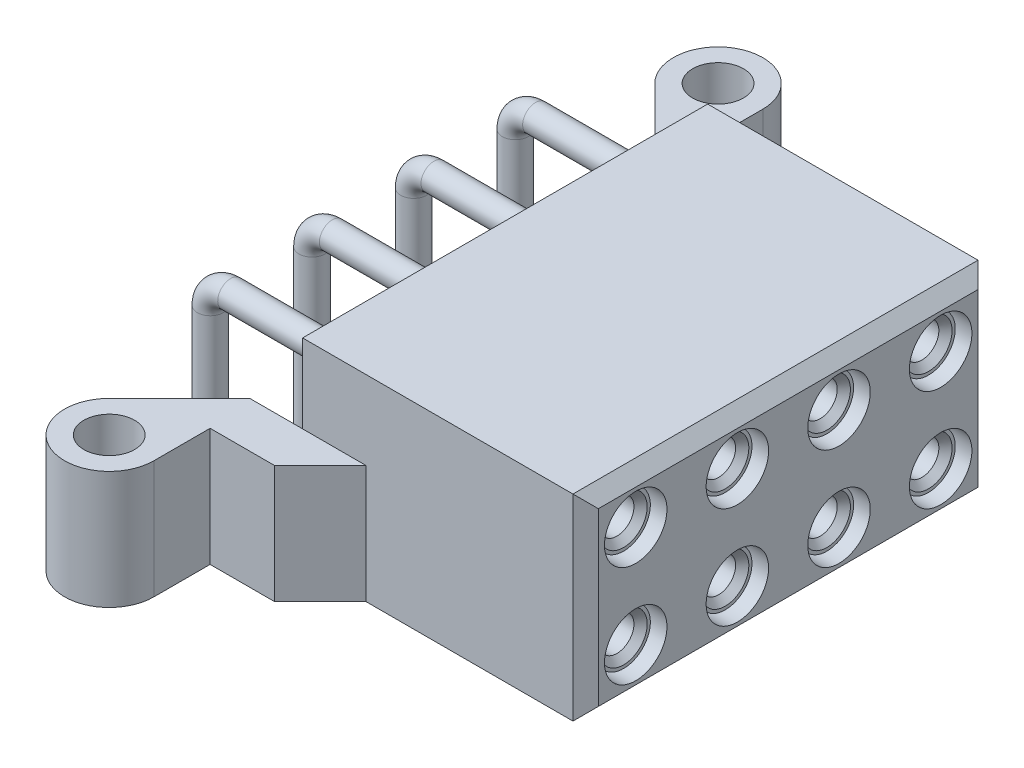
ISO-10303-21;
HEADER;
FILE_DESCRIPTION(('STEP AP214'),'2;1');
FILE_NAME('part.step','',(''),(''),'','','');
FILE_SCHEMA(('AUTOMOTIVE_DESIGN { 1 0 10303 214 1 1 1 1 }'));
ENDSEC;
DATA;
#1=APPLICATION_CONTEXT('core data for automotive mechanical design processes');
#2=APPLICATION_PROTOCOL_DEFINITION('international standard','automotive_design',2000,#1);
#3=PRODUCT_CONTEXT('',#1,'mechanical');
#4=PRODUCT('Part','Part','',(#3));
#5=PRODUCT_RELATED_PRODUCT_CATEGORY('part','',(#4));
#6=PRODUCT_DEFINITION_FORMATION('','',#4);
#7=PRODUCT_DEFINITION_CONTEXT('part definition',#1,'design');
#8=PRODUCT_DEFINITION('design','',#6,#7);
#9=PRODUCT_DEFINITION_SHAPE('','',#8);
#10=(LENGTH_UNIT() NAMED_UNIT(*) SI_UNIT(.MILLI.,.METRE.));
#11=(NAMED_UNIT(*) PLANE_ANGLE_UNIT() SI_UNIT($,.RADIAN.));
#12=(NAMED_UNIT(*) SI_UNIT($,.STERADIAN.) SOLID_ANGLE_UNIT());
#13=UNCERTAINTY_MEASURE_WITH_UNIT(LENGTH_MEASURE(1.E-05),#10,'distance_accuracy_value','');
#14=(GEOMETRIC_REPRESENTATION_CONTEXT(3) GLOBAL_UNCERTAINTY_ASSIGNED_CONTEXT((#13)) GLOBAL_UNIT_ASSIGNED_CONTEXT((#10,
#11,#12)) REPRESENTATION_CONTEXT('',''));
#15=CARTESIAN_POINT('',(0.,0.,0.));
#16=DIRECTION('',(0.,0.,1.));
#17=DIRECTION('',(1.,0.,0.));
#18=AXIS2_PLACEMENT_3D('',#15,#16,#17);
#19=CARTESIAN_POINT('',(-6.7183,2.3749,7.62));
#20=DIRECTION('',(-1.,0.,0.));
#21=DIRECTION('',(0.,0.,1.));
#22=AXIS2_PLACEMENT_3D('',#19,#20,#21);
#23=PLANE('',#22);
#24=CARTESIAN_POINT('',(-6.7183,2.3749,7.62));
#25=DIRECTION('',(-1.,0.,0.));
#26=DIRECTION('',(0.,0.,1.));
#27=AXIS2_PLACEMENT_3D('',#24,#25,#26);
#28=CIRCLE('',#27,1.143);
#29=CARTESIAN_POINT('',(-6.7183,2.3749,8.763));
#30=VERTEX_POINT('',#29);
#31=EDGE_CURVE('E1335',#30,#30,#28,.T.);
#32=ORIENTED_EDGE('',*,*,#31,.T.);
#33=EDGE_LOOP('',(#32));
#34=FACE_BOUND('',#33,.T.);
#35=CARTESIAN_POINT('',(-6.7183,2.3749,7.62));
#36=DIRECTION('',(-1.,0.,0.));
#37=DIRECTION('',(0.,0.,1.));
#38=AXIS2_PLACEMENT_3D('',#35,#36,#37);
#39=CIRCLE('',#38,1.0287);
#40=CARTESIAN_POINT('',(-6.7183,2.3749,8.6487));
#41=VERTEX_POINT('',#40);
#42=EDGE_CURVE('E1377',#41,#41,#39,.T.);
#43=ORIENTED_EDGE('',*,*,#42,.F.);
#44=EDGE_LOOP('',(#43));
#45=FACE_BOUND('',#44,.T.);
#46=ADVANCED_FACE('F26',(#34,#45),#23,.T.);
#47=CARTESIAN_POINT('',(-6.7183,7.4549,7.62));
#48=DIRECTION('',(-1.,0.,0.));
#49=DIRECTION('',(0.,0.,1.));
#50=AXIS2_PLACEMENT_3D('',#47,#48,#49);
#51=PLANE('',#50);
#52=CARTESIAN_POINT('',(-6.7183,7.4549,7.62));
#53=DIRECTION('',(-1.,0.,0.));
#54=DIRECTION('',(0.,0.,1.));
#55=AXIS2_PLACEMENT_3D('',#52,#53,#54);
#56=CIRCLE('',#55,1.143);
#57=CARTESIAN_POINT('',(-6.7183,7.4549,8.763));
#58=VERTEX_POINT('',#57);
#59=EDGE_CURVE('E1331',#58,#58,#56,.T.);
#60=ORIENTED_EDGE('',*,*,#59,.T.);
#61=EDGE_LOOP('',(#60));
#62=FACE_BOUND('',#61,.T.);
#63=CARTESIAN_POINT('',(-6.7183,7.4549,7.62));
#64=DIRECTION('',(-1.,0.,0.));
#65=DIRECTION('',(0.,0.,1.));
#66=AXIS2_PLACEMENT_3D('',#63,#64,#65);
#67=CIRCLE('',#66,1.0287);
#68=CARTESIAN_POINT('',(-6.7183,7.4549,8.6487));
#69=VERTEX_POINT('',#68);
#70=EDGE_CURVE('E1371',#69,#69,#67,.T.);
#71=ORIENTED_EDGE('',*,*,#70,.F.);
#72=EDGE_LOOP('',(#71));
#73=FACE_BOUND('',#72,.T.);
#74=ADVANCED_FACE('F307',(#62,#73),#51,.T.);
#75=CARTESIAN_POINT('',(-6.7183,2.3749,2.54));
#76=DIRECTION('',(-1.,0.,0.));
#77=DIRECTION('',(0.,0.,1.));
#78=AXIS2_PLACEMENT_3D('',#75,#76,#77);
#79=PLANE('',#78);
#80=CARTESIAN_POINT('',(-6.7183,2.3749,2.54));
#81=DIRECTION('',(-1.,0.,0.));
#82=DIRECTION('',(0.,0.,1.));
#83=AXIS2_PLACEMENT_3D('',#80,#81,#82);
#84=CIRCLE('',#83,1.143);
#85=CARTESIAN_POINT('',(-6.7183,2.3749,3.683));
#86=VERTEX_POINT('',#85);
#87=EDGE_CURVE('E1327',#86,#86,#84,.T.);
#88=ORIENTED_EDGE('',*,*,#87,.T.);
#89=EDGE_LOOP('',(#88));
#90=FACE_BOUND('',#89,.T.);
#91=CARTESIAN_POINT('',(-6.7183,2.3749,2.54));
#92=DIRECTION('',(-1.,0.,0.));
#93=DIRECTION('',(0.,0.,1.));
#94=AXIS2_PLACEMENT_3D('',#91,#92,#93);
#95=CIRCLE('',#94,1.0287);
#96=CARTESIAN_POINT('',(-6.7183,2.3749,3.5687));
#97=VERTEX_POINT('',#96);
#98=EDGE_CURVE('E1365',#97,#97,#95,.T.);
#99=ORIENTED_EDGE('',*,*,#98,.F.);
#100=EDGE_LOOP('',(#99));
#101=FACE_BOUND('',#100,.T.);
#102=ADVANCED_FACE('F314',(#90,#101),#79,.T.);
#103=CARTESIAN_POINT('',(-6.7183,7.4549,2.54));
#104=DIRECTION('',(-1.,0.,0.));
#105=DIRECTION('',(0.,0.,1.));
#106=AXIS2_PLACEMENT_3D('',#103,#104,#105);
#107=PLANE('',#106);
#108=CARTESIAN_POINT('',(-6.7183,7.4549,2.54));
#109=DIRECTION('',(-1.,0.,0.));
#110=DIRECTION('',(0.,0.,1.));
#111=AXIS2_PLACEMENT_3D('',#108,#109,#110);
#112=CIRCLE('',#111,1.143);
#113=CARTESIAN_POINT('',(-6.7183,7.4549,3.683));
#114=VERTEX_POINT('',#113);
#115=EDGE_CURVE('E1323',#114,#114,#112,.T.);
#116=ORIENTED_EDGE('',*,*,#115,.T.);
#117=EDGE_LOOP('',(#116));
#118=FACE_BOUND('',#117,.T.);
#119=CARTESIAN_POINT('',(-6.7183,7.4549,2.54));
#120=DIRECTION('',(-1.,0.,0.));
#121=DIRECTION('',(0.,0.,1.));
#122=AXIS2_PLACEMENT_3D('',#119,#120,#121);
#123=CIRCLE('',#122,1.0287);
#124=CARTESIAN_POINT('',(-6.7183,7.4549,3.5687));
#125=VERTEX_POINT('',#124);
#126=EDGE_CURVE('E1359',#125,#125,#123,.T.);
#127=ORIENTED_EDGE('',*,*,#126,.F.);
#128=EDGE_LOOP('',(#127));
#129=FACE_BOUND('',#128,.T.);
#130=ADVANCED_FACE('F334',(#118,#129),#107,.T.);
#131=CARTESIAN_POINT('',(-6.7183,2.3749,-2.54));
#132=DIRECTION('',(-1.,0.,0.));
#133=DIRECTION('',(0.,0.,1.));
#134=AXIS2_PLACEMENT_3D('',#131,#132,#133);
#135=PLANE('',#134);
#136=CARTESIAN_POINT('',(-6.7183,2.3749,-2.54));
#137=DIRECTION('',(-1.,0.,0.));
#138=DIRECTION('',(0.,0.,1.));
#139=AXIS2_PLACEMENT_3D('',#136,#137,#138);
#140=CIRCLE('',#139,1.143);
#141=CARTESIAN_POINT('',(-6.7183,2.3749,-1.397));
#142=VERTEX_POINT('',#141);
#143=EDGE_CURVE('E1319',#142,#142,#140,.T.);
#144=ORIENTED_EDGE('',*,*,#143,.T.);
#145=EDGE_LOOP('',(#144));
#146=FACE_BOUND('',#145,.T.);
#147=CARTESIAN_POINT('',(-6.7183,2.3749,-2.54));
#148=DIRECTION('',(-1.,0.,0.));
#149=DIRECTION('',(0.,0.,1.));
#150=AXIS2_PLACEMENT_3D('',#147,#148,#149);
#151=CIRCLE('',#150,1.0287);
#152=CARTESIAN_POINT('',(-6.7183,2.3749,-1.5113));
#153=VERTEX_POINT('',#152);
#154=EDGE_CURVE('E1353',#153,#153,#151,.T.);
#155=ORIENTED_EDGE('',*,*,#154,.F.);
#156=EDGE_LOOP('',(#155));
#157=FACE_BOUND('',#156,.T.);
#158=ADVANCED_FACE('F342',(#146,#157),#135,.T.);
#159=CARTESIAN_POINT('',(-6.7183,7.4549,-2.54));
#160=DIRECTION('',(-1.,0.,0.));
#161=DIRECTION('',(0.,0.,1.));
#162=AXIS2_PLACEMENT_3D('',#159,#160,#161);
#163=PLANE('',#162);
#164=CARTESIAN_POINT('',(-6.7183,7.4549,-2.54));
#165=DIRECTION('',(-1.,0.,0.));
#166=DIRECTION('',(0.,0.,1.));
#167=AXIS2_PLACEMENT_3D('',#164,#165,#166);
#168=CIRCLE('',#167,1.143);
#169=CARTESIAN_POINT('',(-6.7183,7.4549,-1.397));
#170=VERTEX_POINT('',#169);
#171=EDGE_CURVE('E1315',#170,#170,#168,.T.);
#172=ORIENTED_EDGE('',*,*,#171,.T.);
#173=EDGE_LOOP('',(#172));
#174=FACE_BOUND('',#173,.T.);
#175=CARTESIAN_POINT('',(-6.7183,7.4549,-2.54));
#176=DIRECTION('',(-1.,0.,0.));
#177=DIRECTION('',(0.,0.,1.));
#178=AXIS2_PLACEMENT_3D('',#175,#176,#177);
#179=CIRCLE('',#178,1.0287);
#180=CARTESIAN_POINT('',(-6.7183,7.4549,-1.5113));
#181=VERTEX_POINT('',#180);
#182=EDGE_CURVE('E1347',#181,#181,#179,.T.);
#183=ORIENTED_EDGE('',*,*,#182,.F.);
#184=EDGE_LOOP('',(#183));
#185=FACE_BOUND('',#184,.T.);
#186=ADVANCED_FACE('F350',(#174,#185),#163,.T.);
#187=CARTESIAN_POINT('',(-6.7183,2.3749,-7.62));
#188=DIRECTION('',(-1.,0.,0.));
#189=DIRECTION('',(0.,0.,1.));
#190=AXIS2_PLACEMENT_3D('',#187,#188,#189);
#191=PLANE('',#190);
#192=CARTESIAN_POINT('',(-6.7183,2.3749,-7.62));
#193=DIRECTION('',(-1.,0.,0.));
#194=DIRECTION('',(0.,0.,1.));
#195=AXIS2_PLACEMENT_3D('',#192,#193,#194);
#196=CIRCLE('',#195,1.143);
#197=CARTESIAN_POINT('',(-6.7183,2.3749,-6.477));
#198=VERTEX_POINT('',#197);
#199=EDGE_CURVE('E1311',#198,#198,#196,.T.);
#200=ORIENTED_EDGE('',*,*,#199,.T.);
#201=EDGE_LOOP('',(#200));
#202=FACE_BOUND('',#201,.T.);
#203=CARTESIAN_POINT('',(-6.7183,2.3749,-7.62));
#204=DIRECTION('',(-1.,0.,0.));
#205=DIRECTION('',(0.,0.,1.));
#206=AXIS2_PLACEMENT_3D('',#203,#204,#205);
#207=CIRCLE('',#206,1.0287);
#208=CARTESIAN_POINT('',(-6.7183,2.3749,-6.5913));
#209=VERTEX_POINT('',#208);
#210=EDGE_CURVE('E1341',#209,#209,#207,.T.);
#211=ORIENTED_EDGE('',*,*,#210,.F.);
#212=EDGE_LOOP('',(#211));
#213=FACE_BOUND('',#212,.T.);
#214=ADVANCED_FACE('F358',(#202,#213),#191,.T.);
#215=CARTESIAN_POINT('',(-6.7183,7.4549,-7.62));
#216=DIRECTION('',(-1.,0.,0.));
#217=DIRECTION('',(0.,0.,1.));
#218=AXIS2_PLACEMENT_3D('',#215,#216,#217);
#219=PLANE('',#218);
#220=CARTESIAN_POINT('',(-6.7183,7.4549,-7.62));
#221=DIRECTION('',(-1.,0.,0.));
#222=DIRECTION('',(0.,0.,1.));
#223=AXIS2_PLACEMENT_3D('',#220,#221,#222);
#224=CIRCLE('',#223,1.143);
#225=CARTESIAN_POINT('',(-6.7183,7.4549,-6.477));
#226=VERTEX_POINT('',#225);
#227=EDGE_CURVE('E946',#226,#226,#224,.T.);
#228=ORIENTED_EDGE('',*,*,#227,.T.);
#229=EDGE_LOOP('',(#228));
#230=FACE_BOUND('',#229,.T.);
#231=CARTESIAN_POINT('',(-6.7183,7.4549,-7.62));
#232=DIRECTION('',(-1.,0.,0.));
#233=DIRECTION('',(0.,0.,1.));
#234=AXIS2_PLACEMENT_3D('',#231,#232,#233);
#235=CIRCLE('',#234,1.0287);
#236=CARTESIAN_POINT('',(-6.7183,7.4549,-6.5913));
#237=VERTEX_POINT('',#236);
#238=EDGE_CURVE('E953',#237,#237,#235,.T.);
#239=ORIENTED_EDGE('',*,*,#238,.F.);
#240=EDGE_LOOP('',(#239));
#241=FACE_BOUND('',#240,.T.);
#242=ADVANCED_FACE('F366',(#230,#241),#219,.T.);
#243=CARTESIAN_POINT('',(-7.0739,9.8298,10.1219));
#244=DIRECTION('',(0.,0.,-1.));
#245=DIRECTION('',(-1.,0.,0.));
#246=AXIS2_PLACEMENT_3D('',#243,#244,#245);
#247=PLANE('',#246);
#248=DIRECTION('',(1.,0.,0.));
#249=VECTOR('',#248,1.);
#250=CARTESIAN_POINT('',(-7.0739,0.,10.1219));
#251=LINE('',#250,#249);
#252=CARTESIAN_POINT('',(-3.8989,0.,10.1219));
#253=VERTEX_POINT('',#252);
#254=CARTESIAN_POINT('',(6.4389,0.,10.1219));
#255=VERTEX_POINT('',#254);
#256=EDGE_CURVE('E183',#253,#255,#251,.T.);
#257=ORIENTED_EDGE('',*,*,#256,.T.);
#258=DIRECTION('',(0.,1.,0.));
#259=VECTOR('',#258,1.);
#260=CARTESIAN_POINT('',(6.4389,9.8298,10.1219));
#261=LINE('',#260,#259);
#262=CARTESIAN_POINT('',(6.4389,9.8298,10.1219));
#263=VERTEX_POINT('',#262);
#264=EDGE_CURVE('E242',#255,#263,#261,.T.);
#265=ORIENTED_EDGE('',*,*,#264,.T.);
#266=DIRECTION('',(1.,0.,0.));
#267=VECTOR('',#266,1.);
#268=CARTESIAN_POINT('',(-7.0739,9.8298,10.1219));
#269=LINE('',#268,#267);
#270=CARTESIAN_POINT('',(-7.0739,9.8298,10.1219));
#271=VERTEX_POINT('',#270);
#272=EDGE_CURVE('E875',#271,#263,#269,.T.);
#273=ORIENTED_EDGE('',*,*,#272,.F.);
#274=DIRECTION('',(0.,-1.,0.));
#275=VECTOR('',#274,1.);
#276=CARTESIAN_POINT('',(-7.0739,9.8298,10.1219));
#277=LINE('',#276,#275);
#278=CARTESIAN_POINT('',(-7.0739,5.8928,10.1219));
#279=VERTEX_POINT('',#278);
#280=EDGE_CURVE('E197',#271,#279,#277,.T.);
#281=ORIENTED_EDGE('',*,*,#280,.T.);
#282=DIRECTION('',(-1.,0.,0.));
#283=VECTOR('',#282,1.);
#284=CARTESIAN_POINT('',(-7.0739,5.8928,10.1219));
#285=LINE('',#284,#283);
#286=CARTESIAN_POINT('',(-3.8989,5.8928,10.1219));
#287=VERTEX_POINT('',#286);
#288=EDGE_CURVE('E877',#287,#279,#285,.T.);
#289=ORIENTED_EDGE('',*,*,#288,.F.);
#290=DIRECTION('',(0.,-1.,0.));
#291=VECTOR('',#290,1.);
#292=CARTESIAN_POINT('',(-3.8989,5.8928,10.1219));
#293=LINE('',#292,#291);
#294=EDGE_CURVE('E178',#287,#253,#293,.T.);
#295=ORIENTED_EDGE('',*,*,#294,.T.);
#296=EDGE_LOOP('',(#257,#265,#273,#281,#289,#295));
#297=FACE_BOUND('',#296,.T.);
#298=ADVANCED_FACE('F377',(#297),#247,.F.);
#299=CARTESIAN_POINT('',(-7.0739,9.8298,-10.1219));
#300=DIRECTION('',(0.,0.,1.));
#301=DIRECTION('',(1.,0.,0.));
#302=AXIS2_PLACEMENT_3D('',#299,#300,#301);
#303=PLANE('',#302);
#304=DIRECTION('',(-1.,0.,0.));
#305=VECTOR('',#304,1.);
#306=CARTESIAN_POINT('',(-7.0739,9.8298,-10.1219));
#307=LINE('',#306,#305);
#308=CARTESIAN_POINT('',(6.4389,9.8298,-10.1219));
#309=VERTEX_POINT('',#308);
#310=CARTESIAN_POINT('',(-7.0739,9.8298,-10.1219));
#311=VERTEX_POINT('',#310);
#312=EDGE_CURVE('E224',#309,#311,#307,.T.);
#313=ORIENTED_EDGE('',*,*,#312,.F.);
#314=DIRECTION('',(0.,-1.,0.));
#315=VECTOR('',#314,1.);
#316=CARTESIAN_POINT('',(6.4389,9.8298,-10.1219));
#317=LINE('',#316,#315);
#318=CARTESIAN_POINT('',(6.4389,0.,-10.1219));
#319=VERTEX_POINT('',#318);
#320=EDGE_CURVE('E48',#309,#319,#317,.T.);
#321=ORIENTED_EDGE('',*,*,#320,.T.);
#322=DIRECTION('',(-1.,0.,0.));
#323=VECTOR('',#322,1.);
#324=CARTESIAN_POINT('',(-7.0739,0.,-10.1219));
#325=LINE('',#324,#323);
#326=CARTESIAN_POINT('',(-3.8989,0.,-10.1219));
#327=VERTEX_POINT('',#326);
#328=EDGE_CURVE('E229',#319,#327,#325,.T.);
#329=ORIENTED_EDGE('',*,*,#328,.T.);
#330=DIRECTION('',(0.,-1.,0.));
#331=VECTOR('',#330,1.);
#332=CARTESIAN_POINT('',(-3.8989,5.8928,-10.1219));
#333=LINE('',#332,#331);
#334=CARTESIAN_POINT('',(-3.8989,5.8928,-10.1219));
#335=VERTEX_POINT('',#334);
#336=EDGE_CURVE('E207',#335,#327,#333,.T.);
#337=ORIENTED_EDGE('',*,*,#336,.F.);
#338=DIRECTION('',(-1.,0.,0.));
#339=VECTOR('',#338,1.);
#340=CARTESIAN_POINT('',(-7.0739,5.8928,-10.1219));
#341=LINE('',#340,#339);
#342=CARTESIAN_POINT('',(-7.0739,5.8928,-10.1219));
#343=VERTEX_POINT('',#342);
#344=EDGE_CURVE('E817',#335,#343,#341,.T.);
#345=ORIENTED_EDGE('',*,*,#344,.T.);
#346=DIRECTION('',(0.,-1.,0.));
#347=VECTOR('',#346,1.);
#348=CARTESIAN_POINT('',(-7.0739,9.8298,-10.1219));
#349=LINE('',#348,#347);
#350=EDGE_CURVE('E198',#311,#343,#349,.T.);
#351=ORIENTED_EDGE('',*,*,#350,.F.);
#352=EDGE_LOOP('',(#313,#321,#329,#337,#345,#351));
#353=FACE_BOUND('',#352,.T.);
#354=ADVANCED_FACE('F753',(#353),#303,.F.);
#355=CARTESIAN_POINT('',(-7.0739,9.8298,10.1219));
#356=DIRECTION('',(1.,0.,0.));
#357=DIRECTION('',(0.,0.,-1.));
#358=AXIS2_PLACEMENT_3D('',#355,#356,#357);
#359=PLANE('',#358);
#360=CARTESIAN_POINT('',(-7.0739,2.3749,7.62));
#361=DIRECTION('',(-1.,0.,0.));
#362=DIRECTION('',(0.,0.,1.));
#363=AXIS2_PLACEMENT_3D('',#360,#361,#362);
#364=CIRCLE('',#363,1.143);
#365=CARTESIAN_POINT('',(-7.0739,2.3749,8.763));
#366=VERTEX_POINT('',#365);
#367=EDGE_CURVE('E917',#366,#366,#364,.T.);
#368=ORIENTED_EDGE('',*,*,#367,.F.);
#369=EDGE_LOOP('',(#368));
#370=FACE_BOUND('',#369,.T.);
#371=CARTESIAN_POINT('',(-7.0739,7.4549,7.62));
#372=DIRECTION('',(-1.,0.,0.));
#373=DIRECTION('',(0.,0.,1.));
#374=AXIS2_PLACEMENT_3D('',#371,#372,#373);
#375=CIRCLE('',#374,1.143);
#376=CARTESIAN_POINT('',(-7.0739,7.4549,8.763));
#377=VERTEX_POINT('',#376);
#378=EDGE_CURVE('E921',#377,#377,#375,.T.);
#379=ORIENTED_EDGE('',*,*,#378,.F.);
#380=EDGE_LOOP('',(#379));
#381=FACE_BOUND('',#380,.T.);
#382=CARTESIAN_POINT('',(-7.0739,2.3749,2.54));
#383=DIRECTION('',(-1.,0.,0.));
#384=DIRECTION('',(0.,0.,1.));
#385=AXIS2_PLACEMENT_3D('',#382,#383,#384);
#386=CIRCLE('',#385,1.143);
#387=CARTESIAN_POINT('',(-7.0739,2.3749,3.683));
#388=VERTEX_POINT('',#387);
#389=EDGE_CURVE('E925',#388,#388,#386,.T.);
#390=ORIENTED_EDGE('',*,*,#389,.F.);
#391=EDGE_LOOP('',(#390));
#392=FACE_BOUND('',#391,.T.);
#393=CARTESIAN_POINT('',(-7.0739,7.4549,2.54));
#394=DIRECTION('',(-1.,0.,0.));
#395=DIRECTION('',(0.,0.,1.));
#396=AXIS2_PLACEMENT_3D('',#393,#394,#395);
#397=CIRCLE('',#396,1.143);
#398=CARTESIAN_POINT('',(-7.0739,7.4549,3.683));
#399=VERTEX_POINT('',#398);
#400=EDGE_CURVE('E929',#399,#399,#397,.T.);
#401=ORIENTED_EDGE('',*,*,#400,.F.);
#402=EDGE_LOOP('',(#401));
#403=FACE_BOUND('',#402,.T.);
#404=CARTESIAN_POINT('',(-7.0739,2.3749,-2.54));
#405=DIRECTION('',(-1.,0.,0.));
#406=DIRECTION('',(0.,0.,1.));
#407=AXIS2_PLACEMENT_3D('',#404,#405,#406);
#408=CIRCLE('',#407,1.143);
#409=CARTESIAN_POINT('',(-7.0739,2.3749,-1.397));
#410=VERTEX_POINT('',#409);
#411=EDGE_CURVE('E933',#410,#410,#408,.T.);
#412=ORIENTED_EDGE('',*,*,#411,.F.);
#413=EDGE_LOOP('',(#412));
#414=FACE_BOUND('',#413,.T.);
#415=CARTESIAN_POINT('',(-7.0739,7.4549,-2.54));
#416=DIRECTION('',(-1.,0.,0.));
#417=DIRECTION('',(0.,0.,1.));
#418=AXIS2_PLACEMENT_3D('',#415,#416,#417);
#419=CIRCLE('',#418,1.143);
#420=CARTESIAN_POINT('',(-7.0739,7.4549,-1.397));
#421=VERTEX_POINT('',#420);
#422=EDGE_CURVE('E937',#421,#421,#419,.T.);
#423=ORIENTED_EDGE('',*,*,#422,.F.);
#424=EDGE_LOOP('',(#423));
#425=FACE_BOUND('',#424,.T.);
#426=CARTESIAN_POINT('',(-7.0739,2.3749,-7.62));
#427=DIRECTION('',(-1.,0.,0.));
#428=DIRECTION('',(0.,0.,1.));
#429=AXIS2_PLACEMENT_3D('',#426,#427,#428);
#430=CIRCLE('',#429,1.143);
#431=CARTESIAN_POINT('',(-7.0739,2.3749,-6.477));
#432=VERTEX_POINT('',#431);
#433=EDGE_CURVE('E941',#432,#432,#430,.T.);
#434=ORIENTED_EDGE('',*,*,#433,.F.);
#435=EDGE_LOOP('',(#434));
#436=FACE_BOUND('',#435,.T.);
#437=CARTESIAN_POINT('',(-7.0739,7.4549,-7.62));
#438=DIRECTION('',(-1.,0.,0.));
#439=DIRECTION('',(0.,0.,1.));
#440=AXIS2_PLACEMENT_3D('',#437,#438,#439);
#441=CIRCLE('',#440,1.143);
#442=CARTESIAN_POINT('',(-7.0739,7.4549,-6.477));
#443=VERTEX_POINT('',#442);
#444=EDGE_CURVE('E944',#443,#443,#441,.T.);
#445=ORIENTED_EDGE('',*,*,#444,.F.);
#446=EDGE_LOOP('',(#445));
#447=FACE_BOUND('',#446,.T.);
#448=DIRECTION('',(0.,0.,1.));
#449=VECTOR('',#448,1.);
#450=CARTESIAN_POINT('',(-7.0739,0.,10.1219));
#451=LINE('',#450,#449);
#452=CARTESIAN_POINT('',(-7.0739,0.,-10.1219));
#453=VERTEX_POINT('',#452);
#454=CARTESIAN_POINT('',(-7.0739,0.,10.1219));
#455=VERTEX_POINT('',#454);
#456=EDGE_CURVE('E210',#453,#455,#451,.T.);
#457=ORIENTED_EDGE('',*,*,#456,.T.);
#458=EDGE_CURVE('E194',#279,#455,#277,.T.);
#459=ORIENTED_EDGE('',*,*,#458,.F.);
#460=ORIENTED_EDGE('',*,*,#280,.F.);
#461=DIRECTION('',(0.,0.,1.));
#462=VECTOR('',#461,1.);
#463=CARTESIAN_POINT('',(-7.0739,9.8298,10.1219));
#464=LINE('',#463,#462);
#465=EDGE_CURVE('E237',#311,#271,#464,.T.);
#466=ORIENTED_EDGE('',*,*,#465,.F.);
#467=ORIENTED_EDGE('',*,*,#350,.T.);
#468=EDGE_CURVE('E221',#343,#453,#349,.T.);
#469=ORIENTED_EDGE('',*,*,#468,.T.);
#470=EDGE_LOOP('',(#457,#459,#460,#466,#467,#469));
#471=FACE_BOUND('',#470,.T.);
#472=ADVANCED_FACE('F28',(#370,#381,#392,#403,#414,#425,#436,#447,#471),#359,.F.);
#473=CARTESIAN_POINT('',(7.0739,9.8298,10.1219));
#474=DIRECTION('',(-1.,0.,0.));
#475=DIRECTION('',(0.,0.,1.));
#476=AXIS2_PLACEMENT_3D('',#473,#474,#475);
#477=PLANE('',#476);
#478=CARTESIAN_POINT('',(7.0739,7.4549,-7.62));
#479=DIRECTION('',(-1.,0.,0.));
#480=DIRECTION('',(0.,0.,1.));
#481=AXIS2_PLACEMENT_3D('',#478,#479,#480);
#482=CIRCLE('',#481,1.5621);
#483=CARTESIAN_POINT('',(7.0739,7.4549,-6.0579));
#484=VERTEX_POINT('',#483);
#485=EDGE_CURVE('E950',#484,#484,#482,.T.);
#486=ORIENTED_EDGE('',*,*,#485,.T.);
#487=EDGE_LOOP('',(#486));
#488=FACE_BOUND('',#487,.T.);
#489=CARTESIAN_POINT('',(7.0739,2.3749,-7.62));
#490=DIRECTION('',(-1.,0.,0.));
#491=DIRECTION('',(0.,0.,1.));
#492=AXIS2_PLACEMENT_3D('',#489,#490,#491);
#493=CIRCLE('',#492,1.5621);
#494=CARTESIAN_POINT('',(7.0739,2.3749,-6.0579));
#495=VERTEX_POINT('',#494);
#496=EDGE_CURVE('E983',#495,#495,#493,.T.);
#497=ORIENTED_EDGE('',*,*,#496,.T.);
#498=EDGE_LOOP('',(#497));
#499=FACE_BOUND('',#498,.T.);
#500=CARTESIAN_POINT('',(7.0739,7.4549,-2.54));
#501=DIRECTION('',(-1.,0.,0.));
#502=DIRECTION('',(0.,0.,1.));
#503=AXIS2_PLACEMENT_3D('',#500,#501,#502);
#504=CIRCLE('',#503,1.5621);
#505=CARTESIAN_POINT('',(7.0739,7.4549,-0.977900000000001));
#506=VERTEX_POINT('',#505);
#507=EDGE_CURVE('E1010',#506,#506,#504,.T.);
#508=ORIENTED_EDGE('',*,*,#507,.T.);
#509=EDGE_LOOP('',(#508));
#510=FACE_BOUND('',#509,.T.);
#511=CARTESIAN_POINT('',(7.0739,2.3749,-2.54));
#512=DIRECTION('',(-1.,0.,0.));
#513=DIRECTION('',(0.,0.,1.));
#514=AXIS2_PLACEMENT_3D('',#511,#512,#513);
#515=CIRCLE('',#514,1.5621);
#516=CARTESIAN_POINT('',(7.0739,2.3749,-0.977900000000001));
#517=VERTEX_POINT('',#516);
#518=EDGE_CURVE('E1037',#517,#517,#515,.T.);
#519=ORIENTED_EDGE('',*,*,#518,.T.);
#520=EDGE_LOOP('',(#519));
#521=FACE_BOUND('',#520,.T.);
#522=CARTESIAN_POINT('',(7.0739,7.4549,2.54));
#523=DIRECTION('',(-1.,0.,0.));
#524=DIRECTION('',(0.,0.,1.));
#525=AXIS2_PLACEMENT_3D('',#522,#523,#524);
#526=CIRCLE('',#525,1.5621);
#527=CARTESIAN_POINT('',(7.0739,7.4549,4.1021));
#528=VERTEX_POINT('',#527);
#529=EDGE_CURVE('E1064',#528,#528,#526,.T.);
#530=ORIENTED_EDGE('',*,*,#529,.T.);
#531=EDGE_LOOP('',(#530));
#532=FACE_BOUND('',#531,.T.);
#533=CARTESIAN_POINT('',(7.0739,2.3749,2.54));
#534=DIRECTION('',(-1.,0.,0.));
#535=DIRECTION('',(0.,0.,1.));
#536=AXIS2_PLACEMENT_3D('',#533,#534,#535);
#537=CIRCLE('',#536,1.5621);
#538=CARTESIAN_POINT('',(7.0739,2.3749,4.1021));
#539=VERTEX_POINT('',#538);
#540=EDGE_CURVE('E1091',#539,#539,#537,.T.);
#541=ORIENTED_EDGE('',*,*,#540,.T.);
#542=EDGE_LOOP('',(#541));
#543=FACE_BOUND('',#542,.T.);
#544=CARTESIAN_POINT('',(7.0739,7.4549,7.62));
#545=DIRECTION('',(-1.,0.,0.));
#546=DIRECTION('',(0.,0.,1.));
#547=AXIS2_PLACEMENT_3D('',#544,#545,#546);
#548=CIRCLE('',#547,1.5621);
#549=CARTESIAN_POINT('',(7.0739,7.4549,9.1821));
#550=VERTEX_POINT('',#549);
#551=EDGE_CURVE('E1118',#550,#550,#548,.T.);
#552=ORIENTED_EDGE('',*,*,#551,.T.);
#553=EDGE_LOOP('',(#552));
#554=FACE_BOUND('',#553,.T.);
#555=CARTESIAN_POINT('',(7.0739,2.3749,7.62));
#556=DIRECTION('',(-1.,0.,0.));
#557=DIRECTION('',(0.,0.,1.));
#558=AXIS2_PLACEMENT_3D('',#555,#556,#557);
#559=CIRCLE('',#558,1.5621);
#560=CARTESIAN_POINT('',(7.0739,2.3749,9.1821));
#561=VERTEX_POINT('',#560);
#562=EDGE_CURVE('E1145',#561,#561,#559,.T.);
#563=ORIENTED_EDGE('',*,*,#562,.T.);
#564=EDGE_LOOP('',(#563));
#565=FACE_BOUND('',#564,.T.);
#566=DIRECTION('',(0.,0.,1.));
#567=VECTOR('',#566,1.);
#568=CARTESIAN_POINT('',(7.0739,9.1948,10.1219));
#569=LINE('',#568,#567);
#570=CARTESIAN_POINT('',(7.0739,9.1948,-9.48689999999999));
#571=VERTEX_POINT('',#570);
#572=CARTESIAN_POINT('',(7.0739,9.1948,9.4869));
#573=VERTEX_POINT('',#572);
#574=EDGE_CURVE('E199',#571,#573,#569,.T.);
#575=ORIENTED_EDGE('',*,*,#574,.T.);
#576=DIRECTION('',(0.,-1.,0.));
#577=VECTOR('',#576,1.);
#578=CARTESIAN_POINT('',(7.0739,9.8298,9.4869));
#579=LINE('',#578,#577);
#580=CARTESIAN_POINT('',(7.0739,0.635000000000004,9.4869));
#581=VERTEX_POINT('',#580);
#582=EDGE_CURVE('E771',#573,#581,#579,.T.);
#583=ORIENTED_EDGE('',*,*,#582,.T.);
#584=DIRECTION('',(0.,0.,-1.));
#585=VECTOR('',#584,1.);
#586=CARTESIAN_POINT('',(7.0739,0.635000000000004,-10.1219));
#587=LINE('',#586,#585);
#588=CARTESIAN_POINT('',(7.0739,0.635000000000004,-9.48689999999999));
#589=VERTEX_POINT('',#588);
#590=EDGE_CURVE('E774',#581,#589,#587,.T.);
#591=ORIENTED_EDGE('',*,*,#590,.T.);
#592=DIRECTION('',(0.,1.,0.));
#593=VECTOR('',#592,1.);
#594=CARTESIAN_POINT('',(7.0739,9.8298,-9.48689999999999));
#595=LINE('',#594,#593);
#596=EDGE_CURVE('E870',#589,#571,#595,.T.);
#597=ORIENTED_EDGE('',*,*,#596,.T.);
#598=EDGE_LOOP('',(#575,#583,#591,#597));
#599=FACE_BOUND('',#598,.T.);
#600=ADVANCED_FACE('F752',(#488,#499,#510,#521,#532,#543,#554,#565,#599),#477,.F.);
#601=CARTESIAN_POINT('',(-7.0739,9.8298,-10.1219));
#602=DIRECTION('',(0.,-1.,0.));
#603=DIRECTION('',(0.,0.,-1.));
#604=AXIS2_PLACEMENT_3D('',#601,#602,#603);
#605=PLANE('',#604);
#606=ORIENTED_EDGE('',*,*,#272,.T.);
#607=DIRECTION('',(0.,0.,-1.));
#608=VECTOR('',#607,1.);
#609=CARTESIAN_POINT('',(6.4389,9.8298,-10.1219));
#610=LINE('',#609,#608);
#611=EDGE_CURVE('E41',#263,#309,#610,.T.);
#612=ORIENTED_EDGE('',*,*,#611,.T.);
#613=ORIENTED_EDGE('',*,*,#312,.T.);
#614=ORIENTED_EDGE('',*,*,#465,.T.);
#615=EDGE_LOOP('',(#606,#612,#613,#614));
#616=FACE_BOUND('',#615,.T.);
#617=ADVANCED_FACE('F748',(#616),#605,.F.);
#618=CARTESIAN_POINT('',(-7.0739,0.,-10.1219));
#619=DIRECTION('',(0.,-1.,0.));
#620=DIRECTION('',(0.,0.,-1.));
#621=AXIS2_PLACEMENT_3D('',#618,#619,#620);
#622=PLANE('',#621);
#623=CARTESIAN_POINT('',(-11.6459,0.,15.2146));
#624=DIRECTION('',(0.,-1.,0.));
#625=DIRECTION('',(0.,0.,-1.));
#626=AXIS2_PLACEMENT_3D('',#623,#624,#625);
#627=CIRCLE('',#626,1.27);
#628=CARTESIAN_POINT('',(-11.6459,0.,13.9446));
#629=VERTEX_POINT('',#628);
#630=EDGE_CURVE('E792',#629,#629,#627,.T.);
#631=ORIENTED_EDGE('',*,*,#630,.F.);
#632=EDGE_LOOP('',(#631));
#633=FACE_BOUND('',#632,.T.);
#634=CARTESIAN_POINT('',(-11.6459,0.,-15.2146));
#635=DIRECTION('',(0.,-1.,0.));
#636=DIRECTION('',(0.,0.,-1.));
#637=AXIS2_PLACEMENT_3D('',#634,#635,#636);
#638=CIRCLE('',#637,1.27);
#639=CARTESIAN_POINT('',(-11.6459,0.,-16.4846));
#640=VERTEX_POINT('',#639);
#641=EDGE_CURVE('E186',#640,#640,#638,.T.);
#642=ORIENTED_EDGE('',*,*,#641,.F.);
#643=EDGE_LOOP('',(#642));
#644=FACE_BOUND('',#643,.T.);
#645=ORIENTED_EDGE('',*,*,#328,.F.);
#646=DIRECTION('',(0.,0.,1.));
#647=VECTOR('',#646,1.);
#648=CARTESIAN_POINT('',(6.4389,0.,10.1219));
#649=LINE('',#648,#647);
#650=EDGE_CURVE('E244',#319,#255,#649,.T.);
#651=ORIENTED_EDGE('',*,*,#650,.T.);
#652=ORIENTED_EDGE('',*,*,#256,.F.);
#653=DIRECTION('',(0.707106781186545,0.,-0.70710678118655));
#654=VECTOR('',#653,1.);
#655=CARTESIAN_POINT('',(-3.8989,0.,10.1219));
#656=LINE('',#655,#654);
#657=CARTESIAN_POINT('',(-6.18489999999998,0.,12.4079));
#658=VERTEX_POINT('',#657);
#659=EDGE_CURVE('E171',#658,#253,#656,.T.);
#660=ORIENTED_EDGE('',*,*,#659,.F.);
#661=DIRECTION('',(1.,0.,0.));
#662=VECTOR('',#661,1.);
#663=CARTESIAN_POINT('',(-6.18489999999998,0.,12.4079));
#664=LINE('',#663,#662);
#665=CARTESIAN_POINT('',(-9.41069999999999,0.,12.4079));
#666=VERTEX_POINT('',#665);
#667=EDGE_CURVE('E159',#666,#658,#664,.T.);
#668=ORIENTED_EDGE('',*,*,#667,.F.);
#669=DIRECTION('',(0.,0.,-1.));
#670=VECTOR('',#669,1.);
#671=CARTESIAN_POINT('',(-9.41069999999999,0.,12.4079));
#672=LINE('',#671,#670);
#673=CARTESIAN_POINT('',(-9.41069999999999,0.,15.2146));
#674=VERTEX_POINT('',#673);
#675=EDGE_CURVE('E170',#674,#666,#672,.T.);
#676=ORIENTED_EDGE('',*,*,#675,.F.);
#677=CARTESIAN_POINT('',(-11.6459,0.,15.2146));
#678=DIRECTION('',(0.,1.,0.));
#679=DIRECTION('',(0.,0.,1.));
#680=AXIS2_PLACEMENT_3D('',#677,#678,#679);
#681=CIRCLE('',#680,2.2352);
#682=CARTESIAN_POINT('',(-13.2264250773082,0.,13.6340749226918));
#683=VERTEX_POINT('',#682);
#684=EDGE_CURVE('E906',#683,#674,#681,.T.);
#685=ORIENTED_EDGE('',*,*,#684,.F.);
#686=DIRECTION('',(-0.707106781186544,0.,0.707106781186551));
#687=VECTOR('',#686,1.);
#688=CARTESIAN_POINT('',(-9.71425015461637,0.,10.1219));
#689=LINE('',#688,#687);
#690=CARTESIAN_POINT('',(-9.71425015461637,0.,10.1219));
#691=VERTEX_POINT('',#690);
#692=EDGE_CURVE('E883',#691,#683,#689,.T.);
#693=ORIENTED_EDGE('',*,*,#692,.F.);
#694=DIRECTION('',(-1.,0.,0.));
#695=VECTOR('',#694,1.);
#696=CARTESIAN_POINT('',(-3.8989,0.,10.1219));
#697=LINE('',#696,#695);
#698=EDGE_CURVE('E184',#455,#691,#697,.T.);
#699=ORIENTED_EDGE('',*,*,#698,.F.);
#700=ORIENTED_EDGE('',*,*,#456,.F.);
#701=DIRECTION('',(-1.,0.,0.));
#702=VECTOR('',#701,1.);
#703=CARTESIAN_POINT('',(-3.8989,0.,-10.1219));
#704=LINE('',#703,#702);
#705=CARTESIAN_POINT('',(-9.71425015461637,0.,-10.1219));
#706=VERTEX_POINT('',#705);
#707=EDGE_CURVE('E217',#453,#706,#704,.T.);
#708=ORIENTED_EDGE('',*,*,#707,.T.);
#709=DIRECTION('',(-0.707106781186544,0.,-0.707106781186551));
#710=VECTOR('',#709,1.);
#711=CARTESIAN_POINT('',(-9.71425015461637,0.,-10.1219));
#712=LINE('',#711,#710);
#713=CARTESIAN_POINT('',(-13.2264250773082,0.,-13.6340749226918));
#714=VERTEX_POINT('',#713);
#715=EDGE_CURVE('E804',#706,#714,#712,.T.);
#716=ORIENTED_EDGE('',*,*,#715,.T.);
#717=CARTESIAN_POINT('',(-11.6459,0.,-15.2146));
#718=DIRECTION('',(0.,-1.,0.));
#719=DIRECTION('',(0.,0.,-1.));
#720=AXIS2_PLACEMENT_3D('',#717,#718,#719);
#721=CIRCLE('',#720,2.2352);
#722=CARTESIAN_POINT('',(-9.41069999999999,0.,-15.2146));
#723=VERTEX_POINT('',#722);
#724=EDGE_CURVE('E807',#714,#723,#721,.T.);
#725=ORIENTED_EDGE('',*,*,#724,.T.);
#726=DIRECTION('',(0.,0.,1.));
#727=VECTOR('',#726,1.);
#728=CARTESIAN_POINT('',(-9.41069999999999,0.,-12.4079));
#729=LINE('',#728,#727);
#730=CARTESIAN_POINT('',(-9.41069999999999,0.,-12.4079));
#731=VERTEX_POINT('',#730);
#732=EDGE_CURVE('E811',#723,#731,#729,.T.);
#733=ORIENTED_EDGE('',*,*,#732,.T.);
#734=DIRECTION('',(1.,0.,0.));
#735=VECTOR('',#734,1.);
#736=CARTESIAN_POINT('',(-6.18489999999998,0.,-12.4079));
#737=LINE('',#736,#735);
#738=CARTESIAN_POINT('',(-6.18489999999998,0.,-12.4079));
#739=VERTEX_POINT('',#738);
#740=EDGE_CURVE('E218',#731,#739,#737,.T.);
#741=ORIENTED_EDGE('',*,*,#740,.T.);
#742=DIRECTION('',(0.707106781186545,0.,0.70710678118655));
#743=VECTOR('',#742,1.);
#744=CARTESIAN_POINT('',(-3.8989,0.,-10.1219));
#745=LINE('',#744,#743);
#746=EDGE_CURVE('E214',#739,#327,#745,.T.);
#747=ORIENTED_EDGE('',*,*,#746,.T.);
#748=EDGE_LOOP('',(#645,#651,#652,#660,#668,#676,#685,#693,#699,#700,#708,#716,#725,#733,#741,#747));
#749=FACE_BOUND('',#748,.T.);
#750=ADVANCED_FACE('F181',(#633,#644,#749),#622,.T.);
#751=CARTESIAN_POINT('',(-3.8989,5.8928,-10.1219));
#752=DIRECTION('',(0.,0.,1.));
#753=DIRECTION('',(1.,0.,0.));
#754=AXIS2_PLACEMENT_3D('',#751,#752,#753);
#755=PLANE('',#754);
#756=ORIENTED_EDGE('',*,*,#468,.F.);
#757=CARTESIAN_POINT('',(-9.71425015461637,5.8928,-10.1219));
#758=VERTEX_POINT('',#757);
#759=EDGE_CURVE('E821',#343,#758,#341,.T.);
#760=ORIENTED_EDGE('',*,*,#759,.T.);
#761=DIRECTION('',(0.,-1.,0.));
#762=VECTOR('',#761,1.);
#763=CARTESIAN_POINT('',(-9.71425015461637,5.8928,-10.1219));
#764=LINE('',#763,#762);
#765=EDGE_CURVE('E836',#758,#706,#764,.T.);
#766=ORIENTED_EDGE('',*,*,#765,.T.);
#767=ORIENTED_EDGE('',*,*,#707,.F.);
#768=EDGE_LOOP('',(#756,#760,#766,#767));
#769=FACE_BOUND('',#768,.T.);
#770=ADVANCED_FACE('F723',(#769),#755,.T.);
#771=CARTESIAN_POINT('',(-3.8989,5.8928,-10.1219));
#772=DIRECTION('',(0.70710678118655,0.,-0.707106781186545));
#773=DIRECTION('',(-0.707106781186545,0.,-0.70710678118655));
#774=AXIS2_PLACEMENT_3D('',#771,#772,#773);
#775=PLANE('',#774);
#776=ORIENTED_EDGE('',*,*,#746,.F.);
#777=DIRECTION('',(0.,-1.,0.));
#778=VECTOR('',#777,1.);
#779=CARTESIAN_POINT('',(-6.18489999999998,5.8928,-12.4079));
#780=LINE('',#779,#778);
#781=CARTESIAN_POINT('',(-6.18489999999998,5.8928,-12.4079));
#782=VERTEX_POINT('',#781);
#783=EDGE_CURVE('E211',#782,#739,#780,.T.);
#784=ORIENTED_EDGE('',*,*,#783,.F.);
#785=DIRECTION('',(0.707106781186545,0.,0.70710678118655));
#786=VECTOR('',#785,1.);
#787=CARTESIAN_POINT('',(-3.8989,5.8928,-10.1219));
#788=LINE('',#787,#786);
#789=EDGE_CURVE('E833',#782,#335,#788,.T.);
#790=ORIENTED_EDGE('',*,*,#789,.T.);
#791=ORIENTED_EDGE('',*,*,#336,.T.);
#792=EDGE_LOOP('',(#776,#784,#790,#791));
#793=FACE_BOUND('',#792,.T.);
#794=ADVANCED_FACE('F726',(#793),#775,.T.);
#795=CARTESIAN_POINT('',(-6.18489999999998,5.8928,-12.4079));
#796=DIRECTION('',(0.,0.,-1.));
#797=DIRECTION('',(-1.,0.,0.));
#798=AXIS2_PLACEMENT_3D('',#795,#796,#797);
#799=PLANE('',#798);
#800=ORIENTED_EDGE('',*,*,#740,.F.);
#801=DIRECTION('',(0.,-1.,0.));
#802=VECTOR('',#801,1.);
#803=CARTESIAN_POINT('',(-9.41069999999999,5.8928,-12.4079));
#804=LINE('',#803,#802);
#805=CARTESIAN_POINT('',(-9.41069999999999,5.8928,-12.4079));
#806=VERTEX_POINT('',#805);
#807=EDGE_CURVE('E838',#806,#731,#804,.T.);
#808=ORIENTED_EDGE('',*,*,#807,.F.);
#809=DIRECTION('',(1.,0.,0.));
#810=VECTOR('',#809,1.);
#811=CARTESIAN_POINT('',(-6.18489999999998,5.8928,-12.4079));
#812=LINE('',#811,#810);
#813=EDGE_CURVE('E830',#806,#782,#812,.T.);
#814=ORIENTED_EDGE('',*,*,#813,.T.);
#815=ORIENTED_EDGE('',*,*,#783,.T.);
#816=EDGE_LOOP('',(#800,#808,#814,#815));
#817=FACE_BOUND('',#816,.T.);
#818=ADVANCED_FACE('F730',(#817),#799,.T.);
#819=CARTESIAN_POINT('',(-9.41069999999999,5.8928,-12.4079));
#820=DIRECTION('',(1.,0.,0.));
#821=DIRECTION('',(0.,0.,-1.));
#822=AXIS2_PLACEMENT_3D('',#819,#820,#821);
#823=PLANE('',#822);
#824=ORIENTED_EDGE('',*,*,#732,.F.);
#825=DIRECTION('',(0.,-1.,0.));
#826=VECTOR('',#825,1.);
#827=CARTESIAN_POINT('',(-9.41069999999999,5.8928,-15.2146));
#828=LINE('',#827,#826);
#829=CARTESIAN_POINT('',(-9.41069999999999,5.8928,-15.2146));
#830=VERTEX_POINT('',#829);
#831=EDGE_CURVE('E840',#830,#723,#828,.T.);
#832=ORIENTED_EDGE('',*,*,#831,.F.);
#833=DIRECTION('',(0.,0.,1.));
#834=VECTOR('',#833,1.);
#835=CARTESIAN_POINT('',(-9.41069999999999,5.8928,-12.4079));
#836=LINE('',#835,#834);
#837=EDGE_CURVE('E827',#830,#806,#836,.T.);
#838=ORIENTED_EDGE('',*,*,#837,.T.);
#839=ORIENTED_EDGE('',*,*,#807,.T.);
#840=EDGE_LOOP('',(#824,#832,#838,#839));
#841=FACE_BOUND('',#840,.T.);
#842=ADVANCED_FACE('F734',(#841),#823,.T.);
#843=CARTESIAN_POINT('',(-11.6459,5.8928,-15.2146));
#844=DIRECTION('',(0.,-1.,0.));
#845=DIRECTION('',(0.,0.,-1.));
#846=AXIS2_PLACEMENT_3D('',#843,#844,#845);
#847=CYLINDRICAL_SURFACE('',#846,2.2352);
#848=ORIENTED_EDGE('',*,*,#724,.F.);
#849=DIRECTION('',(0.,-1.,0.));
#850=VECTOR('',#849,1.);
#851=CARTESIAN_POINT('',(-13.2264250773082,5.8928,-13.6340749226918));
#852=LINE('',#851,#850);
#853=CARTESIAN_POINT('',(-13.2264250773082,5.8928,-13.6340749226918));
#854=VERTEX_POINT('',#853);
#855=EDGE_CURVE('E842',#854,#714,#852,.T.);
#856=ORIENTED_EDGE('',*,*,#855,.F.);
#857=CARTESIAN_POINT('',(-11.6459,5.8928,-15.2146));
#858=DIRECTION('',(0.,-1.,0.));
#859=DIRECTION('',(0.,0.,-1.));
#860=AXIS2_PLACEMENT_3D('',#857,#858,#859);
#861=CIRCLE('',#860,2.2352);
#862=EDGE_CURVE('E824',#854,#830,#861,.T.);
#863=ORIENTED_EDGE('',*,*,#862,.T.);
#864=ORIENTED_EDGE('',*,*,#831,.T.);
#865=EDGE_LOOP('',(#848,#856,#863,#864));
#866=FACE_BOUND('',#865,.T.);
#867=ADVANCED_FACE('F738',(#866),#847,.T.);
#868=CARTESIAN_POINT('',(-9.71425015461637,5.8928,-10.1219));
#869=DIRECTION('',(-0.707106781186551,0.,0.707106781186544));
#870=DIRECTION('',(0.707106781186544,0.,0.707106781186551));
#871=AXIS2_PLACEMENT_3D('',#868,#869,#870);
#872=PLANE('',#871);
#873=ORIENTED_EDGE('',*,*,#715,.F.);
#874=ORIENTED_EDGE('',*,*,#765,.F.);
#875=DIRECTION('',(-0.707106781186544,0.,-0.707106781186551));
#876=VECTOR('',#875,1.);
#877=CARTESIAN_POINT('',(-9.71425015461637,5.8928,-10.1219));
#878=LINE('',#877,#876);
#879=EDGE_CURVE('E820',#758,#854,#878,.T.);
#880=ORIENTED_EDGE('',*,*,#879,.T.);
#881=ORIENTED_EDGE('',*,*,#855,.T.);
#882=EDGE_LOOP('',(#873,#874,#880,#881));
#883=FACE_BOUND('',#882,.T.);
#884=ADVANCED_FACE('F721',(#883),#872,.T.);
#885=CARTESIAN_POINT('',(-11.6459,5.8928,-15.2146));
#886=DIRECTION('',(0.,-1.,0.));
#887=DIRECTION('',(0.,0.,-1.));
#888=AXIS2_PLACEMENT_3D('',#885,#886,#887);
#889=PLANE('',#888);
#890=CARTESIAN_POINT('',(-11.6459,5.8928,-15.2146));
#891=DIRECTION('',(0.,1.,0.));
#892=DIRECTION('',(0.,0.,1.));
#893=AXIS2_PLACEMENT_3D('',#890,#891,#892);
#894=CIRCLE('',#893,1.27);
#895=CARTESIAN_POINT('',(-11.6459,5.8928,-13.9446));
#896=VERTEX_POINT('',#895);
#897=EDGE_CURVE('E795',#896,#896,#894,.T.);
#898=ORIENTED_EDGE('',*,*,#897,.F.);
#899=EDGE_LOOP('',(#898));
#900=FACE_BOUND('',#899,.T.);
#901=ORIENTED_EDGE('',*,*,#344,.F.);
#902=ORIENTED_EDGE('',*,*,#789,.F.);
#903=ORIENTED_EDGE('',*,*,#813,.F.);
#904=ORIENTED_EDGE('',*,*,#837,.F.);
#905=ORIENTED_EDGE('',*,*,#862,.F.);
#906=ORIENTED_EDGE('',*,*,#879,.F.);
#907=ORIENTED_EDGE('',*,*,#759,.F.);
#908=EDGE_LOOP('',(#901,#902,#903,#904,#905,#906,#907));
#909=FACE_BOUND('',#908,.T.);
#910=ADVANCED_FACE('F717',(#900,#909),#889,.F.);
#911=CARTESIAN_POINT('',(-3.8989,5.8928,10.1219));
#912=DIRECTION('',(0.,0.,1.));
#913=DIRECTION('',(1.,0.,0.));
#914=AXIS2_PLACEMENT_3D('',#911,#912,#913);
#915=PLANE('',#914);
#916=CARTESIAN_POINT('',(-9.71425015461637,5.8928,10.1219));
#917=VERTEX_POINT('',#916);
#918=EDGE_CURVE('E879',#279,#917,#285,.T.);
#919=ORIENTED_EDGE('',*,*,#918,.F.);
#920=ORIENTED_EDGE('',*,*,#458,.T.);
#921=ORIENTED_EDGE('',*,*,#698,.T.);
#922=DIRECTION('',(0.,-1.,0.));
#923=VECTOR('',#922,1.);
#924=CARTESIAN_POINT('',(-9.71425015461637,5.8928,10.1219));
#925=LINE('',#924,#923);
#926=EDGE_CURVE('E808',#917,#691,#925,.T.);
#927=ORIENTED_EDGE('',*,*,#926,.F.);
#928=EDGE_LOOP('',(#919,#920,#921,#927));
#929=FACE_BOUND('',#928,.T.);
#930=ADVANCED_FACE('F702',(#929),#915,.F.);
#931=CARTESIAN_POINT('',(-9.71425015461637,5.8928,10.1219));
#932=DIRECTION('',(0.707106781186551,0.,0.707106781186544));
#933=DIRECTION('',(0.707106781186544,0.,-0.707106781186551));
#934=AXIS2_PLACEMENT_3D('',#931,#932,#933);
#935=PLANE('',#934);
#936=ORIENTED_EDGE('',*,*,#692,.T.);
#937=DIRECTION('',(0.,-1.,0.));
#938=VECTOR('',#937,1.);
#939=CARTESIAN_POINT('',(-13.2264250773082,5.8928,13.6340749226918));
#940=LINE('',#939,#938);
#941=CARTESIAN_POINT('',(-13.2264250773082,5.8928,13.6340749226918));
#942=VERTEX_POINT('',#941);
#943=EDGE_CURVE('E896',#942,#683,#940,.T.);
#944=ORIENTED_EDGE('',*,*,#943,.F.);
#945=DIRECTION('',(-0.707106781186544,0.,0.707106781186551));
#946=VECTOR('',#945,1.);
#947=CARTESIAN_POINT('',(-9.71425015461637,5.8928,10.1219));
#948=LINE('',#947,#946);
#949=EDGE_CURVE('E892',#917,#942,#948,.T.);
#950=ORIENTED_EDGE('',*,*,#949,.F.);
#951=ORIENTED_EDGE('',*,*,#926,.T.);
#952=EDGE_LOOP('',(#936,#944,#950,#951));
#953=FACE_BOUND('',#952,.T.);
#954=ADVANCED_FACE('F698',(#953),#935,.F.);
#955=CARTESIAN_POINT('',(-11.6459,5.8928,15.2146));
#956=DIRECTION('',(0.,-1.,0.));
#957=DIRECTION('',(0.,0.,-1.));
#958=AXIS2_PLACEMENT_3D('',#955,#956,#957);
#959=CYLINDRICAL_SURFACE('',#958,2.2352);
#960=ORIENTED_EDGE('',*,*,#684,.T.);
#961=DIRECTION('',(0.,-1.,0.));
#962=VECTOR('',#961,1.);
#963=CARTESIAN_POINT('',(-9.41069999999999,5.8928,15.2146));
#964=LINE('',#963,#962);
#965=CARTESIAN_POINT('',(-9.41069999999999,5.8928,15.2146));
#966=VERTEX_POINT('',#965);
#967=EDGE_CURVE('E899',#966,#674,#964,.T.);
#968=ORIENTED_EDGE('',*,*,#967,.F.);
#969=CARTESIAN_POINT('',(-11.6459,5.8928,15.2146));
#970=DIRECTION('',(0.,1.,0.));
#971=DIRECTION('',(0.,0.,1.));
#972=AXIS2_PLACEMENT_3D('',#969,#970,#971);
#973=CIRCLE('',#972,2.2352);
#974=EDGE_CURVE('E890',#942,#966,#973,.T.);
#975=ORIENTED_EDGE('',*,*,#974,.F.);
#976=ORIENTED_EDGE('',*,*,#943,.T.);
#977=EDGE_LOOP('',(#960,#968,#975,#976));
#978=FACE_BOUND('',#977,.T.);
#979=ADVANCED_FACE('F701',(#978),#959,.T.);
#980=CARTESIAN_POINT('',(-9.41069999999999,5.8928,12.4079));
#981=DIRECTION('',(-1.,0.,0.));
#982=DIRECTION('',(0.,0.,1.));
#983=AXIS2_PLACEMENT_3D('',#980,#981,#982);
#984=PLANE('',#983);
#985=ORIENTED_EDGE('',*,*,#675,.T.);
#986=DIRECTION('',(0.,-1.,0.));
#987=VECTOR('',#986,1.);
#988=CARTESIAN_POINT('',(-9.41069999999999,5.8928,12.4079));
#989=LINE('',#988,#987);
#990=CARTESIAN_POINT('',(-9.41069999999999,5.8928,12.4079));
#991=VERTEX_POINT('',#990);
#992=EDGE_CURVE('E166',#991,#666,#989,.T.);
#993=ORIENTED_EDGE('',*,*,#992,.F.);
#994=DIRECTION('',(0.,0.,-1.));
#995=VECTOR('',#994,1.);
#996=CARTESIAN_POINT('',(-9.41069999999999,5.8928,12.4079));
#997=LINE('',#996,#995);
#998=EDGE_CURVE('E888',#966,#991,#997,.T.);
#999=ORIENTED_EDGE('',*,*,#998,.F.);
#1000=ORIENTED_EDGE('',*,*,#967,.T.);
#1001=EDGE_LOOP('',(#985,#993,#999,#1000));
#1002=FACE_BOUND('',#1001,.T.);
#1003=ADVANCED_FACE('F706',(#1002),#984,.F.);
#1004=CARTESIAN_POINT('',(-6.18489999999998,5.8928,12.4079));
#1005=DIRECTION('',(0.,0.,-1.));
#1006=DIRECTION('',(-1.,0.,0.));
#1007=AXIS2_PLACEMENT_3D('',#1004,#1005,#1006);
#1008=PLANE('',#1007);
#1009=ORIENTED_EDGE('',*,*,#667,.T.);
#1010=DIRECTION('',(0.,-1.,0.));
#1011=VECTOR('',#1010,1.);
#1012=CARTESIAN_POINT('',(-6.18489999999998,5.8928,12.4079));
#1013=LINE('',#1012,#1011);
#1014=CARTESIAN_POINT('',(-6.18489999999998,5.8928,12.4079));
#1015=VERTEX_POINT('',#1014);
#1016=EDGE_CURVE('E163',#1015,#658,#1013,.T.);
#1017=ORIENTED_EDGE('',*,*,#1016,.F.);
#1018=DIRECTION('',(1.,0.,0.));
#1019=VECTOR('',#1018,1.);
#1020=CARTESIAN_POINT('',(-6.18489999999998,5.8928,12.4079));
#1021=LINE('',#1020,#1019);
#1022=EDGE_CURVE('E881',#991,#1015,#1021,.T.);
#1023=ORIENTED_EDGE('',*,*,#1022,.F.);
#1024=ORIENTED_EDGE('',*,*,#992,.T.);
#1025=EDGE_LOOP('',(#1009,#1017,#1023,#1024));
#1026=FACE_BOUND('',#1025,.T.);
#1027=ADVANCED_FACE('F161',(#1026),#1008,.F.);
#1028=CARTESIAN_POINT('',(-3.8989,5.8928,10.1219));
#1029=DIRECTION('',(-0.70710678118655,0.,-0.707106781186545));
#1030=DIRECTION('',(-0.707106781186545,0.,0.70710678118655));
#1031=AXIS2_PLACEMENT_3D('',#1028,#1029,#1030);
#1032=PLANE('',#1031);
#1033=ORIENTED_EDGE('',*,*,#659,.T.);
#1034=ORIENTED_EDGE('',*,*,#294,.F.);
#1035=DIRECTION('',(0.707106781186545,0.,-0.70710678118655));
#1036=VECTOR('',#1035,1.);
#1037=CARTESIAN_POINT('',(-3.8989,5.8928,10.1219));
#1038=LINE('',#1037,#1036);
#1039=EDGE_CURVE('E177',#1015,#287,#1038,.T.);
#1040=ORIENTED_EDGE('',*,*,#1039,.F.);
#1041=ORIENTED_EDGE('',*,*,#1016,.T.);
#1042=EDGE_LOOP('',(#1033,#1034,#1040,#1041));
#1043=FACE_BOUND('',#1042,.T.);
#1044=ADVANCED_FACE('F174',(#1043),#1032,.F.);
#1045=CARTESIAN_POINT('',(-11.6459,5.8928,15.2146));
#1046=DIRECTION('',(0.,-1.,0.));
#1047=DIRECTION('',(0.,0.,1.));
#1048=AXIS2_PLACEMENT_3D('',#1045,#1046,#1047);
#1049=PLANE('',#1048);
#1050=CARTESIAN_POINT('',(-11.6459,5.8928,15.2146));
#1051=DIRECTION('',(0.,1.,0.));
#1052=DIRECTION('',(0.,0.,1.));
#1053=AXIS2_PLACEMENT_3D('',#1050,#1051,#1052);
#1054=CIRCLE('',#1053,1.27);
#1055=CARTESIAN_POINT('',(-11.6459,5.8928,16.4846));
#1056=VERTEX_POINT('',#1055);
#1057=EDGE_CURVE('E789',#1056,#1056,#1054,.T.);
#1058=ORIENTED_EDGE('',*,*,#1057,.F.);
#1059=EDGE_LOOP('',(#1058));
#1060=FACE_BOUND('',#1059,.T.);
#1061=ORIENTED_EDGE('',*,*,#288,.T.);
#1062=ORIENTED_EDGE('',*,*,#918,.T.);
#1063=ORIENTED_EDGE('',*,*,#949,.T.);
#1064=ORIENTED_EDGE('',*,*,#974,.T.);
#1065=ORIENTED_EDGE('',*,*,#998,.T.);
#1066=ORIENTED_EDGE('',*,*,#1022,.T.);
#1067=ORIENTED_EDGE('',*,*,#1039,.T.);
#1068=EDGE_LOOP('',(#1061,#1062,#1063,#1064,#1065,#1066,#1067));
#1069=FACE_BOUND('',#1068,.T.);
#1070=ADVANCED_FACE('F693',(#1060,#1069),#1049,.F.);
#1071=CARTESIAN_POINT('',(-11.6459,-4.99999999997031E-05,-15.2146));
#1072=DIRECTION('',(0.,1.,0.));
#1073=DIRECTION('',(0.,0.,1.));
#1074=AXIS2_PLACEMENT_3D('',#1071,#1072,#1073);
#1075=CYLINDRICAL_SURFACE('',#1074,1.27);
#1076=ORIENTED_EDGE('',*,*,#641,.T.);
#1077=EDGE_LOOP('',(#1076));
#1078=FACE_BOUND('',#1077,.T.);
#1079=ORIENTED_EDGE('',*,*,#897,.T.);
#1080=EDGE_LOOP('',(#1079));
#1081=FACE_BOUND('',#1080,.T.);
#1082=ADVANCED_FACE('F689',(#1078,#1081),#1075,.F.);
#1083=CARTESIAN_POINT('',(-11.6459,-4.99999999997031E-05,15.2146));
#1084=DIRECTION('',(0.,1.,0.));
#1085=DIRECTION('',(0.,0.,1.));
#1086=AXIS2_PLACEMENT_3D('',#1083,#1084,#1085);
#1087=CYLINDRICAL_SURFACE('',#1086,1.27);
#1088=ORIENTED_EDGE('',*,*,#630,.T.);
#1089=EDGE_LOOP('',(#1088));
#1090=FACE_BOUND('',#1089,.T.);
#1091=ORIENTED_EDGE('',*,*,#1057,.T.);
#1092=EDGE_LOOP('',(#1091));
#1093=FACE_BOUND('',#1092,.T.);
#1094=ADVANCED_FACE('F685',(#1090,#1093),#1087,.F.);
#1095=CARTESIAN_POINT('',(6.4389,9.8298,-10.1219));
#1096=DIRECTION('',(-0.70710678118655,0.,0.707106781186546));
#1097=DIRECTION('',(0.707106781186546,0.,0.70710678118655));
#1098=AXIS2_PLACEMENT_3D('',#1095,#1096,#1097);
#1099=PLANE('',#1098);
#1100=DIRECTION('',(0.577350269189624,0.577350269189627,0.577350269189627));
#1101=VECTOR('',#1100,1.);
#1102=CARTESIAN_POINT('',(9.71549999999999,3.27660000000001,-6.84529999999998));
#1103=LINE('',#1102,#1101);
#1104=EDGE_CURVE('E778',#319,#589,#1103,.T.);
#1105=ORIENTED_EDGE('',*,*,#1104,.F.);
#1106=ORIENTED_EDGE('',*,*,#320,.F.);
#1107=DIRECTION('',(-0.577350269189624,0.577350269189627,-0.577350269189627));
#1108=VECTOR('',#1107,1.);
#1109=CARTESIAN_POINT('',(6.4389,9.8298,-10.1219));
#1110=LINE('',#1109,#1108);
#1111=EDGE_CURVE('E786',#571,#309,#1110,.T.);
#1112=ORIENTED_EDGE('',*,*,#1111,.F.);
#1113=ORIENTED_EDGE('',*,*,#596,.F.);
#1114=EDGE_LOOP('',(#1105,#1106,#1112,#1113));
#1115=FACE_BOUND('',#1114,.T.);
#1116=ADVANCED_FACE('F681',(#1115),#1099,.F.);
#1117=CARTESIAN_POINT('',(6.4389,9.8298,-10.1219));
#1118=DIRECTION('',(-0.70710678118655,-0.707106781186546,0.));
#1119=DIRECTION('',(0.707106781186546,-0.70710678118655,0.));
#1120=AXIS2_PLACEMENT_3D('',#1117,#1118,#1119);
#1121=PLANE('',#1120);
#1122=ORIENTED_EDGE('',*,*,#1111,.T.);
#1123=ORIENTED_EDGE('',*,*,#611,.F.);
#1124=DIRECTION('',(0.577350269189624,-0.577350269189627,-0.577350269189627));
#1125=VECTOR('',#1124,1.);
#1126=CARTESIAN_POINT('',(13.1868333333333,3.08186666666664,3.37396666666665));
#1127=LINE('',#1126,#1125);
#1128=EDGE_CURVE('E770',#573,#263,#1127,.F.);
#1129=ORIENTED_EDGE('',*,*,#1128,.F.);
#1130=ORIENTED_EDGE('',*,*,#574,.F.);
#1131=EDGE_LOOP('',(#1122,#1123,#1129,#1130));
#1132=FACE_BOUND('',#1131,.T.);
#1133=ADVANCED_FACE('F677',(#1132),#1121,.F.);
#1134=CARTESIAN_POINT('',(7.0739,0.635000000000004,10.1219));
#1135=DIRECTION('',(0.70710678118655,-0.707106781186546,0.));
#1136=DIRECTION('',(0.707106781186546,0.70710678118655,0.));
#1137=AXIS2_PLACEMENT_3D('',#1134,#1135,#1136);
#1138=PLANE('',#1137);
#1139=ORIENTED_EDGE('',*,*,#1104,.T.);
#1140=ORIENTED_EDGE('',*,*,#590,.F.);
#1141=DIRECTION('',(0.577350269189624,0.577350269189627,-0.577350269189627));
#1142=VECTOR('',#1141,1.);
#1143=CARTESIAN_POINT('',(6.86223333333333,0.423333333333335,9.69856666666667));
#1144=LINE('',#1143,#1142);
#1145=EDGE_CURVE('E767',#255,#581,#1144,.T.);
#1146=ORIENTED_EDGE('',*,*,#1145,.F.);
#1147=ORIENTED_EDGE('',*,*,#650,.F.);
#1148=EDGE_LOOP('',(#1139,#1140,#1146,#1147));
#1149=FACE_BOUND('',#1148,.T.);
#1150=ADVANCED_FACE('F673',(#1149),#1138,.T.);
#1151=CARTESIAN_POINT('',(7.0739,9.8298,9.4869));
#1152=DIRECTION('',(-0.70710678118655,0.,-0.707106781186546));
#1153=DIRECTION('',(-0.707106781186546,0.,0.70710678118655));
#1154=AXIS2_PLACEMENT_3D('',#1151,#1152,#1153);
#1155=PLANE('',#1154);
#1156=ORIENTED_EDGE('',*,*,#1128,.T.);
#1157=ORIENTED_EDGE('',*,*,#264,.F.);
#1158=ORIENTED_EDGE('',*,*,#1145,.T.);
#1159=ORIENTED_EDGE('',*,*,#582,.F.);
#1160=EDGE_LOOP('',(#1156,#1157,#1158,#1159));
#1161=FACE_BOUND('',#1160,.T.);
#1162=ADVANCED_FACE('F669',(#1161),#1155,.F.);
#1163=CARTESIAN_POINT('',(2.81637619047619,2.3749,7.62));
#1164=DIRECTION('',(-1.,0.,0.));
#1165=DIRECTION('',(0.,0.,1.));
#1166=AXIS2_PLACEMENT_3D('',#1163,#1164,#1165);
#1167=CYLINDRICAL_SURFACE('',#1166,1.5621);
#1168=ORIENTED_EDGE('',*,*,#562,.F.);
#1169=EDGE_LOOP('',(#1168));
#1170=FACE_BOUND('',#1169,.T.);
#1171=CARTESIAN_POINT('',(4.4323,2.3749,7.62));
#1172=DIRECTION('',(-1.,0.,0.));
#1173=DIRECTION('',(0.,0.,1.));
#1174=AXIS2_PLACEMENT_3D('',#1171,#1172,#1173);
#1175=CIRCLE('',#1174,1.5621);
#1176=CARTESIAN_POINT('',(4.4323,2.3749,9.1821));
#1177=VERTEX_POINT('',#1176);
#1178=EDGE_CURVE('E776',#1177,#1177,#1175,.T.);
#1179=ORIENTED_EDGE('',*,*,#1178,.T.);
#1180=EDGE_LOOP('',(#1179));
#1181=FACE_BOUND('',#1180,.T.);
#1182=ADVANCED_FACE('F665',(#1170,#1181),#1167,.F.);
#1183=CARTESIAN_POINT('',(4.4323,0.8128,7.62));
#1184=DIRECTION('',(-1.,0.,0.));
#1185=DIRECTION('',(0.,0.,1.));
#1186=AXIS2_PLACEMENT_3D('',#1183,#1184,#1185);
#1187=PLANE('',#1186);
#1188=ORIENTED_EDGE('',*,*,#1178,.F.);
#1189=EDGE_LOOP('',(#1188));
#1190=FACE_BOUND('',#1189,.T.);
#1191=CARTESIAN_POINT('',(4.4323,2.3749,7.62));
#1192=DIRECTION('',(-1.,0.,0.));
#1193=DIRECTION('',(0.,0.,1.));
#1194=AXIS2_PLACEMENT_3D('',#1191,#1192,#1193);
#1195=CIRCLE('',#1194,1.0922);
#1196=CARTESIAN_POINT('',(4.4323,2.3749,8.7122));
#1197=VERTEX_POINT('',#1196);
#1198=EDGE_CURVE('E781',#1197,#1197,#1195,.T.);
#1199=ORIENTED_EDGE('',*,*,#1198,.T.);
#1200=EDGE_LOOP('',(#1199));
#1201=FACE_BOUND('',#1200,.T.);
#1202=ADVANCED_FACE('F661',(#1190,#1201),#1187,.F.);
#1203=CARTESIAN_POINT('',(2.81637619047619,2.3749,7.62));
#1204=DIRECTION('',(-1.,0.,0.));
#1205=DIRECTION('',(0.,0.,1.));
#1206=AXIS2_PLACEMENT_3D('',#1203,#1204,#1205);
#1207=CYLINDRICAL_SURFACE('',#1206,1.0922);
#1208=ORIENTED_EDGE('',*,*,#1198,.F.);
#1209=EDGE_LOOP('',(#1208));
#1210=FACE_BOUND('',#1209,.T.);
#1211=CARTESIAN_POINT('',(5.6515,2.3749,7.62));
#1212=DIRECTION('',(-1.,0.,0.));
#1213=DIRECTION('',(0.,0.,1.));
#1214=AXIS2_PLACEMENT_3D('',#1211,#1212,#1213);
#1215=CIRCLE('',#1214,1.0922);
#1216=CARTESIAN_POINT('',(5.6515,2.3749,8.7122));
#1217=VERTEX_POINT('',#1216);
#1218=EDGE_CURVE('E1163',#1217,#1217,#1215,.T.);
#1219=ORIENTED_EDGE('',*,*,#1218,.T.);
#1220=EDGE_LOOP('',(#1219));
#1221=FACE_BOUND('',#1220,.T.);
#1222=ADVANCED_FACE('F657',(#1210,#1221),#1207,.T.);
#1223=CARTESIAN_POINT('',(5.6515,1.2827,7.62));
#1224=DIRECTION('',(1.,0.,0.));
#1225=DIRECTION('',(0.,0.,-1.));
#1226=AXIS2_PLACEMENT_3D('',#1223,#1224,#1225);
#1227=PLANE('',#1226);
#1228=ORIENTED_EDGE('',*,*,#1218,.F.);
#1229=EDGE_LOOP('',(#1228));
#1230=FACE_BOUND('',#1229,.T.);
#1231=CARTESIAN_POINT('',(5.6515,2.3749,7.62));
#1232=DIRECTION('',(-1.,0.,0.));
#1233=DIRECTION('',(0.,0.,1.));
#1234=AXIS2_PLACEMENT_3D('',#1231,#1232,#1233);
#1235=CIRCLE('',#1234,1.33985);
#1236=CARTESIAN_POINT('',(5.6515,2.3749,8.95985));
#1237=VERTEX_POINT('',#1236);
#1238=EDGE_CURVE('E1160',#1237,#1237,#1235,.T.);
#1239=ORIENTED_EDGE('',*,*,#1238,.T.);
#1240=EDGE_LOOP('',(#1239));
#1241=FACE_BOUND('',#1240,.T.);
#1242=ADVANCED_FACE('F653',(#1230,#1241),#1227,.F.);
#1243=CARTESIAN_POINT('',(2.81637619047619,2.3749,7.62));
#1244=DIRECTION('',(-1.,0.,0.));
#1245=DIRECTION('',(0.,0.,1.));
#1246=AXIS2_PLACEMENT_3D('',#1243,#1244,#1245);
#1247=CYLINDRICAL_SURFACE('',#1246,1.33985);
#1248=ORIENTED_EDGE('',*,*,#1238,.F.);
#1249=EDGE_LOOP('',(#1248));
#1250=FACE_BOUND('',#1249,.T.);
#1251=CARTESIAN_POINT('',(6.4643,2.3749,7.62));
#1252=DIRECTION('',(-1.,0.,0.));
#1253=DIRECTION('',(0.,0.,1.));
#1254=AXIS2_PLACEMENT_3D('',#1251,#1252,#1253);
#1255=CIRCLE('',#1254,1.33985);
#1256=CARTESIAN_POINT('',(6.4643,2.3749,8.95985));
#1257=VERTEX_POINT('',#1256);
#1258=EDGE_CURVE('E1157',#1257,#1257,#1255,.T.);
#1259=ORIENTED_EDGE('',*,*,#1258,.T.);
#1260=EDGE_LOOP('',(#1259));
#1261=FACE_BOUND('',#1260,.T.);
#1262=ADVANCED_FACE('F649',(#1250,#1261),#1247,.T.);
#1263=CARTESIAN_POINT('',(6.4643,1.03505,7.62));
#1264=DIRECTION('',(-1.,0.,0.));
#1265=DIRECTION('',(0.,0.,1.));
#1266=AXIS2_PLACEMENT_3D('',#1263,#1264,#1265);
#1267=PLANE('',#1266);
#1268=ORIENTED_EDGE('',*,*,#1258,.F.);
#1269=EDGE_LOOP('',(#1268));
#1270=FACE_BOUND('',#1269,.T.);
#1271=CARTESIAN_POINT('',(6.4643,2.3749,7.62));
#1272=DIRECTION('',(-1.,0.,0.));
#1273=DIRECTION('',(0.,0.,1.));
#1274=AXIS2_PLACEMENT_3D('',#1271,#1272,#1273);
#1275=CIRCLE('',#1274,1.1811);
#1276=CARTESIAN_POINT('',(6.4643,2.3749,8.8011));
#1277=VERTEX_POINT('',#1276);
#1278=EDGE_CURVE('E1154',#1277,#1277,#1275,.T.);
#1279=ORIENTED_EDGE('',*,*,#1278,.T.);
#1280=EDGE_LOOP('',(#1279));
#1281=FACE_BOUND('',#1280,.T.);
#1282=ADVANCED_FACE('F645',(#1270,#1281),#1267,.F.);
#1283=CARTESIAN_POINT('',(6.1341,2.3749,7.62));
#1284=DIRECTION('',(1.,0.,0.));
#1285=DIRECTION('',(0.,0.,-1.));
#1286=AXIS2_PLACEMENT_3D('',#1283,#1284,#1285);
#1287=CONICAL_SURFACE('',#1286,0.8509,0.78539816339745);
#1288=ORIENTED_EDGE('',*,*,#1278,.F.);
#1289=EDGE_LOOP('',(#1288));
#1290=FACE_BOUND('',#1289,.T.);
#1291=CARTESIAN_POINT('',(6.1341,2.3749,7.62));
#1292=DIRECTION('',(-1.,0.,0.));
#1293=DIRECTION('',(0.,0.,1.));
#1294=AXIS2_PLACEMENT_3D('',#1291,#1292,#1293);
#1295=CIRCLE('',#1294,0.8509);
#1296=CARTESIAN_POINT('',(6.1341,2.3749,8.4709));
#1297=VERTEX_POINT('',#1296);
#1298=EDGE_CURVE('E1151',#1297,#1297,#1295,.T.);
#1299=ORIENTED_EDGE('',*,*,#1298,.T.);
#1300=EDGE_LOOP('',(#1299));
#1301=FACE_BOUND('',#1300,.T.);
#1302=ADVANCED_FACE('F641',(#1290,#1301),#1287,.F.);
#1303=CARTESIAN_POINT('',(2.81637619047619,2.3749,7.62));
#1304=DIRECTION('',(-1.,0.,0.));
#1305=DIRECTION('',(0.,0.,1.));
#1306=AXIS2_PLACEMENT_3D('',#1303,#1304,#1305);
#1307=CYLINDRICAL_SURFACE('',#1306,0.8509);
#1308=ORIENTED_EDGE('',*,*,#1298,.F.);
#1309=EDGE_LOOP('',(#1308));
#1310=FACE_BOUND('',#1309,.T.);
#1311=CARTESIAN_POINT('',(5.19429999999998,2.3749,7.62));
#1312=DIRECTION('',(-1.,0.,0.));
#1313=DIRECTION('',(0.,0.,1.));
#1314=AXIS2_PLACEMENT_3D('',#1311,#1312,#1313);
#1315=CIRCLE('',#1314,0.8509);
#1316=CARTESIAN_POINT('',(5.19429999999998,2.3749,8.4709));
#1317=VERTEX_POINT('',#1316);
#1318=EDGE_CURVE('E1148',#1317,#1317,#1315,.T.);
#1319=ORIENTED_EDGE('',*,*,#1318,.T.);
#1320=EDGE_LOOP('',(#1319));
#1321=FACE_BOUND('',#1320,.T.);
#1322=ADVANCED_FACE('F637',(#1310,#1321),#1307,.F.);
#1323=CARTESIAN_POINT('',(5.19429999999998,1.524,7.62));
#1324=DIRECTION('',(-1.,0.,0.));
#1325=DIRECTION('',(0.,0.,1.));
#1326=AXIS2_PLACEMENT_3D('',#1323,#1324,#1325);
#1327=PLANE('',#1326);
#1328=ORIENTED_EDGE('',*,*,#1318,.F.);
#1329=EDGE_LOOP('',(#1328));
#1330=FACE_BOUND('',#1329,.T.);
#1331=ADVANCED_FACE('F633',(#1330),#1327,.F.);
#1332=CARTESIAN_POINT('',(2.81637619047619,7.4549,7.62));
#1333=DIRECTION('',(-1.,0.,0.));
#1334=DIRECTION('',(0.,0.,1.));
#1335=AXIS2_PLACEMENT_3D('',#1332,#1333,#1334);
#1336=CYLINDRICAL_SURFACE('',#1335,1.5621);
#1337=ORIENTED_EDGE('',*,*,#551,.F.);
#1338=EDGE_LOOP('',(#1337));
#1339=FACE_BOUND('',#1338,.T.);
#1340=CARTESIAN_POINT('',(4.4323,7.4549,7.62));
#1341=DIRECTION('',(-1.,0.,0.));
#1342=DIRECTION('',(0.,0.,1.));
#1343=AXIS2_PLACEMENT_3D('',#1340,#1341,#1342);
#1344=CIRCLE('',#1343,1.5621);
#1345=CARTESIAN_POINT('',(4.4323,7.4549,9.1821));
#1346=VERTEX_POINT('',#1345);
#1347=EDGE_CURVE('E1142',#1346,#1346,#1344,.T.);
#1348=ORIENTED_EDGE('',*,*,#1347,.T.);
#1349=EDGE_LOOP('',(#1348));
#1350=FACE_BOUND('',#1349,.T.);
#1351=ADVANCED_FACE('F629',(#1339,#1350),#1336,.F.);
#1352=CARTESIAN_POINT('',(4.4323,5.8928,7.62));
#1353=DIRECTION('',(-1.,0.,0.));
#1354=DIRECTION('',(0.,0.,1.));
#1355=AXIS2_PLACEMENT_3D('',#1352,#1353,#1354);
#1356=PLANE('',#1355);
#1357=ORIENTED_EDGE('',*,*,#1347,.F.);
#1358=EDGE_LOOP('',(#1357));
#1359=FACE_BOUND('',#1358,.T.);
#1360=CARTESIAN_POINT('',(4.4323,7.4549,7.62));
#1361=DIRECTION('',(-1.,0.,0.));
#1362=DIRECTION('',(0.,0.,1.));
#1363=AXIS2_PLACEMENT_3D('',#1360,#1361,#1362);
#1364=CIRCLE('',#1363,1.0922);
#1365=CARTESIAN_POINT('',(4.4323,7.4549,8.7122));
#1366=VERTEX_POINT('',#1365);
#1367=EDGE_CURVE('E1139',#1366,#1366,#1364,.T.);
#1368=ORIENTED_EDGE('',*,*,#1367,.T.);
#1369=EDGE_LOOP('',(#1368));
#1370=FACE_BOUND('',#1369,.T.);
#1371=ADVANCED_FACE('F625',(#1359,#1370),#1356,.F.);
#1372=CARTESIAN_POINT('',(2.81637619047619,7.4549,7.62));
#1373=DIRECTION('',(-1.,0.,0.));
#1374=DIRECTION('',(0.,0.,1.));
#1375=AXIS2_PLACEMENT_3D('',#1372,#1373,#1374);
#1376=CYLINDRICAL_SURFACE('',#1375,1.0922);
#1377=ORIENTED_EDGE('',*,*,#1367,.F.);
#1378=EDGE_LOOP('',(#1377));
#1379=FACE_BOUND('',#1378,.T.);
#1380=CARTESIAN_POINT('',(5.6515,7.4549,7.62));
#1381=DIRECTION('',(-1.,0.,0.));
#1382=DIRECTION('',(0.,0.,1.));
#1383=AXIS2_PLACEMENT_3D('',#1380,#1381,#1382);
#1384=CIRCLE('',#1383,1.0922);
#1385=CARTESIAN_POINT('',(5.6515,7.4549,8.7122));
#1386=VERTEX_POINT('',#1385);
#1387=EDGE_CURVE('E1136',#1386,#1386,#1384,.T.);
#1388=ORIENTED_EDGE('',*,*,#1387,.T.);
#1389=EDGE_LOOP('',(#1388));
#1390=FACE_BOUND('',#1389,.T.);
#1391=ADVANCED_FACE('F621',(#1379,#1390),#1376,.T.);
#1392=CARTESIAN_POINT('',(5.6515,6.3627,7.62));
#1393=DIRECTION('',(1.,0.,0.));
#1394=DIRECTION('',(0.,0.,-1.));
#1395=AXIS2_PLACEMENT_3D('',#1392,#1393,#1394);
#1396=PLANE('',#1395);
#1397=ORIENTED_EDGE('',*,*,#1387,.F.);
#1398=EDGE_LOOP('',(#1397));
#1399=FACE_BOUND('',#1398,.T.);
#1400=CARTESIAN_POINT('',(5.6515,7.4549,7.62));
#1401=DIRECTION('',(-1.,0.,0.));
#1402=DIRECTION('',(0.,0.,1.));
#1403=AXIS2_PLACEMENT_3D('',#1400,#1401,#1402);
#1404=CIRCLE('',#1403,1.33985);
#1405=CARTESIAN_POINT('',(5.6515,7.4549,8.95985));
#1406=VERTEX_POINT('',#1405);
#1407=EDGE_CURVE('E1133',#1406,#1406,#1404,.T.);
#1408=ORIENTED_EDGE('',*,*,#1407,.T.);
#1409=EDGE_LOOP('',(#1408));
#1410=FACE_BOUND('',#1409,.T.);
#1411=ADVANCED_FACE('F617',(#1399,#1410),#1396,.F.);
#1412=CARTESIAN_POINT('',(2.81637619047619,7.4549,7.62));
#1413=DIRECTION('',(-1.,0.,0.));
#1414=DIRECTION('',(0.,0.,1.));
#1415=AXIS2_PLACEMENT_3D('',#1412,#1413,#1414);
#1416=CYLINDRICAL_SURFACE('',#1415,1.33985);
#1417=ORIENTED_EDGE('',*,*,#1407,.F.);
#1418=EDGE_LOOP('',(#1417));
#1419=FACE_BOUND('',#1418,.T.);
#1420=CARTESIAN_POINT('',(6.4643,7.4549,7.62));
#1421=DIRECTION('',(-1.,0.,0.));
#1422=DIRECTION('',(0.,0.,1.));
#1423=AXIS2_PLACEMENT_3D('',#1420,#1421,#1422);
#1424=CIRCLE('',#1423,1.33985);
#1425=CARTESIAN_POINT('',(6.4643,7.4549,8.95985));
#1426=VERTEX_POINT('',#1425);
#1427=EDGE_CURVE('E1130',#1426,#1426,#1424,.T.);
#1428=ORIENTED_EDGE('',*,*,#1427,.T.);
#1429=EDGE_LOOP('',(#1428));
#1430=FACE_BOUND('',#1429,.T.);
#1431=ADVANCED_FACE('F613',(#1419,#1430),#1416,.T.);
#1432=CARTESIAN_POINT('',(6.4643,6.11505,7.62));
#1433=DIRECTION('',(-1.,0.,0.));
#1434=DIRECTION('',(0.,0.,1.));
#1435=AXIS2_PLACEMENT_3D('',#1432,#1433,#1434);
#1436=PLANE('',#1435);
#1437=ORIENTED_EDGE('',*,*,#1427,.F.);
#1438=EDGE_LOOP('',(#1437));
#1439=FACE_BOUND('',#1438,.T.);
#1440=CARTESIAN_POINT('',(6.4643,7.4549,7.62));
#1441=DIRECTION('',(-1.,0.,0.));
#1442=DIRECTION('',(0.,0.,1.));
#1443=AXIS2_PLACEMENT_3D('',#1440,#1441,#1442);
#1444=CIRCLE('',#1443,1.1811);
#1445=CARTESIAN_POINT('',(6.4643,7.4549,8.8011));
#1446=VERTEX_POINT('',#1445);
#1447=EDGE_CURVE('E1127',#1446,#1446,#1444,.T.);
#1448=ORIENTED_EDGE('',*,*,#1447,.T.);
#1449=EDGE_LOOP('',(#1448));
#1450=FACE_BOUND('',#1449,.T.);
#1451=ADVANCED_FACE('F609',(#1439,#1450),#1436,.F.);
#1452=CARTESIAN_POINT('',(6.1341,7.4549,7.62));
#1453=DIRECTION('',(1.,0.,0.));
#1454=DIRECTION('',(0.,0.,-1.));
#1455=AXIS2_PLACEMENT_3D('',#1452,#1453,#1454);
#1456=CONICAL_SURFACE('',#1455,0.8509,0.78539816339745);
#1457=ORIENTED_EDGE('',*,*,#1447,.F.);
#1458=EDGE_LOOP('',(#1457));
#1459=FACE_BOUND('',#1458,.T.);
#1460=CARTESIAN_POINT('',(6.1341,7.4549,7.62));
#1461=DIRECTION('',(-1.,0.,0.));
#1462=DIRECTION('',(0.,0.,1.));
#1463=AXIS2_PLACEMENT_3D('',#1460,#1461,#1462);
#1464=CIRCLE('',#1463,0.8509);
#1465=CARTESIAN_POINT('',(6.1341,7.4549,8.4709));
#1466=VERTEX_POINT('',#1465);
#1467=EDGE_CURVE('E1124',#1466,#1466,#1464,.T.);
#1468=ORIENTED_EDGE('',*,*,#1467,.T.);
#1469=EDGE_LOOP('',(#1468));
#1470=FACE_BOUND('',#1469,.T.);
#1471=ADVANCED_FACE('F605',(#1459,#1470),#1456,.F.);
#1472=CARTESIAN_POINT('',(2.81637619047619,7.4549,7.62));
#1473=DIRECTION('',(-1.,0.,0.));
#1474=DIRECTION('',(0.,0.,1.));
#1475=AXIS2_PLACEMENT_3D('',#1472,#1473,#1474);
#1476=CYLINDRICAL_SURFACE('',#1475,0.8509);
#1477=ORIENTED_EDGE('',*,*,#1467,.F.);
#1478=EDGE_LOOP('',(#1477));
#1479=FACE_BOUND('',#1478,.T.);
#1480=CARTESIAN_POINT('',(5.19429999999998,7.4549,7.62));
#1481=DIRECTION('',(-1.,0.,0.));
#1482=DIRECTION('',(0.,0.,1.));
#1483=AXIS2_PLACEMENT_3D('',#1480,#1481,#1482);
#1484=CIRCLE('',#1483,0.8509);
#1485=CARTESIAN_POINT('',(5.19429999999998,7.4549,8.4709));
#1486=VERTEX_POINT('',#1485);
#1487=EDGE_CURVE('E1121',#1486,#1486,#1484,.T.);
#1488=ORIENTED_EDGE('',*,*,#1487,.T.);
#1489=EDGE_LOOP('',(#1488));
#1490=FACE_BOUND('',#1489,.T.);
#1491=ADVANCED_FACE('F601',(#1479,#1490),#1476,.F.);
#1492=CARTESIAN_POINT('',(5.19429999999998,6.604,7.62));
#1493=DIRECTION('',(-1.,0.,0.));
#1494=DIRECTION('',(0.,0.,1.));
#1495=AXIS2_PLACEMENT_3D('',#1492,#1493,#1494);
#1496=PLANE('',#1495);
#1497=ORIENTED_EDGE('',*,*,#1487,.F.);
#1498=EDGE_LOOP('',(#1497));
#1499=FACE_BOUND('',#1498,.T.);
#1500=ADVANCED_FACE('F597',(#1499),#1496,.F.);
#1501=CARTESIAN_POINT('',(2.81637619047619,2.3749,2.54));
#1502=DIRECTION('',(-1.,0.,0.));
#1503=DIRECTION('',(0.,0.,1.));
#1504=AXIS2_PLACEMENT_3D('',#1501,#1502,#1503);
#1505=CYLINDRICAL_SURFACE('',#1504,1.5621);
#1506=ORIENTED_EDGE('',*,*,#540,.F.);
#1507=EDGE_LOOP('',(#1506));
#1508=FACE_BOUND('',#1507,.T.);
#1509=CARTESIAN_POINT('',(4.4323,2.3749,2.54));
#1510=DIRECTION('',(-1.,0.,0.));
#1511=DIRECTION('',(0.,0.,1.));
#1512=AXIS2_PLACEMENT_3D('',#1509,#1510,#1511);
#1513=CIRCLE('',#1512,1.5621);
#1514=CARTESIAN_POINT('',(4.4323,2.3749,4.1021));
#1515=VERTEX_POINT('',#1514);
#1516=EDGE_CURVE('E1115',#1515,#1515,#1513,.T.);
#1517=ORIENTED_EDGE('',*,*,#1516,.T.);
#1518=EDGE_LOOP('',(#1517));
#1519=FACE_BOUND('',#1518,.T.);
#1520=ADVANCED_FACE('F593',(#1508,#1519),#1505,.F.);
#1521=CARTESIAN_POINT('',(4.4323,0.8128,2.54));
#1522=DIRECTION('',(-1.,0.,0.));
#1523=DIRECTION('',(0.,0.,1.));
#1524=AXIS2_PLACEMENT_3D('',#1521,#1522,#1523);
#1525=PLANE('',#1524);
#1526=ORIENTED_EDGE('',*,*,#1516,.F.);
#1527=EDGE_LOOP('',(#1526));
#1528=FACE_BOUND('',#1527,.T.);
#1529=CARTESIAN_POINT('',(4.4323,2.3749,2.54));
#1530=DIRECTION('',(-1.,0.,0.));
#1531=DIRECTION('',(0.,0.,1.));
#1532=AXIS2_PLACEMENT_3D('',#1529,#1530,#1531);
#1533=CIRCLE('',#1532,1.0922);
#1534=CARTESIAN_POINT('',(4.4323,2.3749,3.6322));
#1535=VERTEX_POINT('',#1534);
#1536=EDGE_CURVE('E1112',#1535,#1535,#1533,.T.);
#1537=ORIENTED_EDGE('',*,*,#1536,.T.);
#1538=EDGE_LOOP('',(#1537));
#1539=FACE_BOUND('',#1538,.T.);
#1540=ADVANCED_FACE('F589',(#1528,#1539),#1525,.F.);
#1541=CARTESIAN_POINT('',(2.81637619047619,2.3749,2.54));
#1542=DIRECTION('',(-1.,0.,0.));
#1543=DIRECTION('',(0.,0.,1.));
#1544=AXIS2_PLACEMENT_3D('',#1541,#1542,#1543);
#1545=CYLINDRICAL_SURFACE('',#1544,1.0922);
#1546=ORIENTED_EDGE('',*,*,#1536,.F.);
#1547=EDGE_LOOP('',(#1546));
#1548=FACE_BOUND('',#1547,.T.);
#1549=CARTESIAN_POINT('',(5.6515,2.3749,2.54));
#1550=DIRECTION('',(-1.,0.,0.));
#1551=DIRECTION('',(0.,0.,1.));
#1552=AXIS2_PLACEMENT_3D('',#1549,#1550,#1551);
#1553=CIRCLE('',#1552,1.0922);
#1554=CARTESIAN_POINT('',(5.6515,2.3749,3.6322));
#1555=VERTEX_POINT('',#1554);
#1556=EDGE_CURVE('E1109',#1555,#1555,#1553,.T.);
#1557=ORIENTED_EDGE('',*,*,#1556,.T.);
#1558=EDGE_LOOP('',(#1557));
#1559=FACE_BOUND('',#1558,.T.);
#1560=ADVANCED_FACE('F585',(#1548,#1559),#1545,.T.);
#1561=CARTESIAN_POINT('',(5.6515,1.2827,2.54));
#1562=DIRECTION('',(1.,0.,0.));
#1563=DIRECTION('',(0.,0.,-1.));
#1564=AXIS2_PLACEMENT_3D('',#1561,#1562,#1563);
#1565=PLANE('',#1564);
#1566=ORIENTED_EDGE('',*,*,#1556,.F.);
#1567=EDGE_LOOP('',(#1566));
#1568=FACE_BOUND('',#1567,.T.);
#1569=CARTESIAN_POINT('',(5.6515,2.3749,2.54));
#1570=DIRECTION('',(-1.,0.,0.));
#1571=DIRECTION('',(0.,0.,1.));
#1572=AXIS2_PLACEMENT_3D('',#1569,#1570,#1571);
#1573=CIRCLE('',#1572,1.33985);
#1574=CARTESIAN_POINT('',(5.6515,2.3749,3.87985));
#1575=VERTEX_POINT('',#1574);
#1576=EDGE_CURVE('E1106',#1575,#1575,#1573,.T.);
#1577=ORIENTED_EDGE('',*,*,#1576,.T.);
#1578=EDGE_LOOP('',(#1577));
#1579=FACE_BOUND('',#1578,.T.);
#1580=ADVANCED_FACE('F581',(#1568,#1579),#1565,.F.);
#1581=CARTESIAN_POINT('',(2.81637619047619,2.3749,2.54));
#1582=DIRECTION('',(-1.,0.,0.));
#1583=DIRECTION('',(0.,0.,1.));
#1584=AXIS2_PLACEMENT_3D('',#1581,#1582,#1583);
#1585=CYLINDRICAL_SURFACE('',#1584,1.33985);
#1586=ORIENTED_EDGE('',*,*,#1576,.F.);
#1587=EDGE_LOOP('',(#1586));
#1588=FACE_BOUND('',#1587,.T.);
#1589=CARTESIAN_POINT('',(6.4643,2.3749,2.54));
#1590=DIRECTION('',(-1.,0.,0.));
#1591=DIRECTION('',(0.,0.,1.));
#1592=AXIS2_PLACEMENT_3D('',#1589,#1590,#1591);
#1593=CIRCLE('',#1592,1.33985);
#1594=CARTESIAN_POINT('',(6.4643,2.3749,3.87985));
#1595=VERTEX_POINT('',#1594);
#1596=EDGE_CURVE('E1103',#1595,#1595,#1593,.T.);
#1597=ORIENTED_EDGE('',*,*,#1596,.T.);
#1598=EDGE_LOOP('',(#1597));
#1599=FACE_BOUND('',#1598,.T.);
#1600=ADVANCED_FACE('F577',(#1588,#1599),#1585,.T.);
#1601=CARTESIAN_POINT('',(6.4643,1.03505,2.54));
#1602=DIRECTION('',(-1.,0.,0.));
#1603=DIRECTION('',(0.,0.,1.));
#1604=AXIS2_PLACEMENT_3D('',#1601,#1602,#1603);
#1605=PLANE('',#1604);
#1606=ORIENTED_EDGE('',*,*,#1596,.F.);
#1607=EDGE_LOOP('',(#1606));
#1608=FACE_BOUND('',#1607,.T.);
#1609=CARTESIAN_POINT('',(6.4643,2.3749,2.54));
#1610=DIRECTION('',(-1.,0.,0.));
#1611=DIRECTION('',(0.,0.,1.));
#1612=AXIS2_PLACEMENT_3D('',#1609,#1610,#1611);
#1613=CIRCLE('',#1612,1.1811);
#1614=CARTESIAN_POINT('',(6.4643,2.3749,3.7211));
#1615=VERTEX_POINT('',#1614);
#1616=EDGE_CURVE('E1100',#1615,#1615,#1613,.T.);
#1617=ORIENTED_EDGE('',*,*,#1616,.T.);
#1618=EDGE_LOOP('',(#1617));
#1619=FACE_BOUND('',#1618,.T.);
#1620=ADVANCED_FACE('F573',(#1608,#1619),#1605,.F.);
#1621=CARTESIAN_POINT('',(6.1341,2.3749,2.54));
#1622=DIRECTION('',(1.,0.,0.));
#1623=DIRECTION('',(0.,0.,-1.));
#1624=AXIS2_PLACEMENT_3D('',#1621,#1622,#1623);
#1625=CONICAL_SURFACE('',#1624,0.8509,0.78539816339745);
#1626=ORIENTED_EDGE('',*,*,#1616,.F.);
#1627=EDGE_LOOP('',(#1626));
#1628=FACE_BOUND('',#1627,.T.);
#1629=CARTESIAN_POINT('',(6.1341,2.3749,2.54));
#1630=DIRECTION('',(-1.,0.,0.));
#1631=DIRECTION('',(0.,0.,1.));
#1632=AXIS2_PLACEMENT_3D('',#1629,#1630,#1631);
#1633=CIRCLE('',#1632,0.8509);
#1634=CARTESIAN_POINT('',(6.1341,2.3749,3.3909));
#1635=VERTEX_POINT('',#1634);
#1636=EDGE_CURVE('E1097',#1635,#1635,#1633,.T.);
#1637=ORIENTED_EDGE('',*,*,#1636,.T.);
#1638=EDGE_LOOP('',(#1637));
#1639=FACE_BOUND('',#1638,.T.);
#1640=ADVANCED_FACE('F569',(#1628,#1639),#1625,.F.);
#1641=CARTESIAN_POINT('',(2.81637619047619,2.3749,2.54));
#1642=DIRECTION('',(-1.,0.,0.));
#1643=DIRECTION('',(0.,0.,1.));
#1644=AXIS2_PLACEMENT_3D('',#1641,#1642,#1643);
#1645=CYLINDRICAL_SURFACE('',#1644,0.8509);
#1646=ORIENTED_EDGE('',*,*,#1636,.F.);
#1647=EDGE_LOOP('',(#1646));
#1648=FACE_BOUND('',#1647,.T.);
#1649=CARTESIAN_POINT('',(5.19429999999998,2.3749,2.54));
#1650=DIRECTION('',(-1.,0.,0.));
#1651=DIRECTION('',(0.,0.,1.));
#1652=AXIS2_PLACEMENT_3D('',#1649,#1650,#1651);
#1653=CIRCLE('',#1652,0.8509);
#1654=CARTESIAN_POINT('',(5.19429999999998,2.3749,3.3909));
#1655=VERTEX_POINT('',#1654);
#1656=EDGE_CURVE('E1094',#1655,#1655,#1653,.T.);
#1657=ORIENTED_EDGE('',*,*,#1656,.T.);
#1658=EDGE_LOOP('',(#1657));
#1659=FACE_BOUND('',#1658,.T.);
#1660=ADVANCED_FACE('F565',(#1648,#1659),#1645,.F.);
#1661=CARTESIAN_POINT('',(5.19429999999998,1.524,2.54));
#1662=DIRECTION('',(-1.,0.,0.));
#1663=DIRECTION('',(0.,0.,1.));
#1664=AXIS2_PLACEMENT_3D('',#1661,#1662,#1663);
#1665=PLANE('',#1664);
#1666=ORIENTED_EDGE('',*,*,#1656,.F.);
#1667=EDGE_LOOP('',(#1666));
#1668=FACE_BOUND('',#1667,.T.);
#1669=ADVANCED_FACE('F561',(#1668),#1665,.F.);
#1670=CARTESIAN_POINT('',(2.81637619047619,7.4549,2.54));
#1671=DIRECTION('',(-1.,0.,0.));
#1672=DIRECTION('',(0.,0.,1.));
#1673=AXIS2_PLACEMENT_3D('',#1670,#1671,#1672);
#1674=CYLINDRICAL_SURFACE('',#1673,1.5621);
#1675=ORIENTED_EDGE('',*,*,#529,.F.);
#1676=EDGE_LOOP('',(#1675));
#1677=FACE_BOUND('',#1676,.T.);
#1678=CARTESIAN_POINT('',(4.4323,7.4549,2.54));
#1679=DIRECTION('',(-1.,0.,0.));
#1680=DIRECTION('',(0.,0.,1.));
#1681=AXIS2_PLACEMENT_3D('',#1678,#1679,#1680);
#1682=CIRCLE('',#1681,1.5621);
#1683=CARTESIAN_POINT('',(4.4323,7.4549,4.1021));
#1684=VERTEX_POINT('',#1683);
#1685=EDGE_CURVE('E1088',#1684,#1684,#1682,.T.);
#1686=ORIENTED_EDGE('',*,*,#1685,.T.);
#1687=EDGE_LOOP('',(#1686));
#1688=FACE_BOUND('',#1687,.T.);
#1689=ADVANCED_FACE('F557',(#1677,#1688),#1674,.F.);
#1690=CARTESIAN_POINT('',(4.4323,5.8928,2.54));
#1691=DIRECTION('',(-1.,0.,0.));
#1692=DIRECTION('',(0.,0.,1.));
#1693=AXIS2_PLACEMENT_3D('',#1690,#1691,#1692);
#1694=PLANE('',#1693);
#1695=ORIENTED_EDGE('',*,*,#1685,.F.);
#1696=EDGE_LOOP('',(#1695));
#1697=FACE_BOUND('',#1696,.T.);
#1698=CARTESIAN_POINT('',(4.4323,7.4549,2.54));
#1699=DIRECTION('',(-1.,0.,0.));
#1700=DIRECTION('',(0.,0.,1.));
#1701=AXIS2_PLACEMENT_3D('',#1698,#1699,#1700);
#1702=CIRCLE('',#1701,1.0922);
#1703=CARTESIAN_POINT('',(4.4323,7.4549,3.6322));
#1704=VERTEX_POINT('',#1703);
#1705=EDGE_CURVE('E1085',#1704,#1704,#1702,.T.);
#1706=ORIENTED_EDGE('',*,*,#1705,.T.);
#1707=EDGE_LOOP('',(#1706));
#1708=FACE_BOUND('',#1707,.T.);
#1709=ADVANCED_FACE('F553',(#1697,#1708),#1694,.F.);
#1710=CARTESIAN_POINT('',(2.81637619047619,7.4549,2.54));
#1711=DIRECTION('',(-1.,0.,0.));
#1712=DIRECTION('',(0.,0.,1.));
#1713=AXIS2_PLACEMENT_3D('',#1710,#1711,#1712);
#1714=CYLINDRICAL_SURFACE('',#1713,1.0922);
#1715=ORIENTED_EDGE('',*,*,#1705,.F.);
#1716=EDGE_LOOP('',(#1715));
#1717=FACE_BOUND('',#1716,.T.);
#1718=CARTESIAN_POINT('',(5.6515,7.4549,2.54));
#1719=DIRECTION('',(-1.,0.,0.));
#1720=DIRECTION('',(0.,0.,1.));
#1721=AXIS2_PLACEMENT_3D('',#1718,#1719,#1720);
#1722=CIRCLE('',#1721,1.0922);
#1723=CARTESIAN_POINT('',(5.6515,7.4549,3.6322));
#1724=VERTEX_POINT('',#1723);
#1725=EDGE_CURVE('E1082',#1724,#1724,#1722,.T.);
#1726=ORIENTED_EDGE('',*,*,#1725,.T.);
#1727=EDGE_LOOP('',(#1726));
#1728=FACE_BOUND('',#1727,.T.);
#1729=ADVANCED_FACE('F549',(#1717,#1728),#1714,.T.);
#1730=CARTESIAN_POINT('',(5.6515,6.3627,2.54));
#1731=DIRECTION('',(1.,0.,0.));
#1732=DIRECTION('',(0.,0.,-1.));
#1733=AXIS2_PLACEMENT_3D('',#1730,#1731,#1732);
#1734=PLANE('',#1733);
#1735=ORIENTED_EDGE('',*,*,#1725,.F.);
#1736=EDGE_LOOP('',(#1735));
#1737=FACE_BOUND('',#1736,.T.);
#1738=CARTESIAN_POINT('',(5.6515,7.4549,2.54));
#1739=DIRECTION('',(-1.,0.,0.));
#1740=DIRECTION('',(0.,0.,1.));
#1741=AXIS2_PLACEMENT_3D('',#1738,#1739,#1740);
#1742=CIRCLE('',#1741,1.33985);
#1743=CARTESIAN_POINT('',(5.6515,7.4549,3.87985));
#1744=VERTEX_POINT('',#1743);
#1745=EDGE_CURVE('E1079',#1744,#1744,#1742,.T.);
#1746=ORIENTED_EDGE('',*,*,#1745,.T.);
#1747=EDGE_LOOP('',(#1746));
#1748=FACE_BOUND('',#1747,.T.);
#1749=ADVANCED_FACE('F545',(#1737,#1748),#1734,.F.);
#1750=CARTESIAN_POINT('',(2.81637619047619,7.4549,2.54));
#1751=DIRECTION('',(-1.,0.,0.));
#1752=DIRECTION('',(0.,0.,1.));
#1753=AXIS2_PLACEMENT_3D('',#1750,#1751,#1752);
#1754=CYLINDRICAL_SURFACE('',#1753,1.33985);
#1755=ORIENTED_EDGE('',*,*,#1745,.F.);
#1756=EDGE_LOOP('',(#1755));
#1757=FACE_BOUND('',#1756,.T.);
#1758=CARTESIAN_POINT('',(6.4643,7.4549,2.54));
#1759=DIRECTION('',(-1.,0.,0.));
#1760=DIRECTION('',(0.,0.,1.));
#1761=AXIS2_PLACEMENT_3D('',#1758,#1759,#1760);
#1762=CIRCLE('',#1761,1.33985);
#1763=CARTESIAN_POINT('',(6.4643,7.4549,3.87985));
#1764=VERTEX_POINT('',#1763);
#1765=EDGE_CURVE('E1076',#1764,#1764,#1762,.T.);
#1766=ORIENTED_EDGE('',*,*,#1765,.T.);
#1767=EDGE_LOOP('',(#1766));
#1768=FACE_BOUND('',#1767,.T.);
#1769=ADVANCED_FACE('F541',(#1757,#1768),#1754,.T.);
#1770=CARTESIAN_POINT('',(6.4643,6.11505,2.54));
#1771=DIRECTION('',(-1.,0.,0.));
#1772=DIRECTION('',(0.,0.,1.));
#1773=AXIS2_PLACEMENT_3D('',#1770,#1771,#1772);
#1774=PLANE('',#1773);
#1775=ORIENTED_EDGE('',*,*,#1765,.F.);
#1776=EDGE_LOOP('',(#1775));
#1777=FACE_BOUND('',#1776,.T.);
#1778=CARTESIAN_POINT('',(6.4643,7.4549,2.54));
#1779=DIRECTION('',(-1.,0.,0.));
#1780=DIRECTION('',(0.,0.,1.));
#1781=AXIS2_PLACEMENT_3D('',#1778,#1779,#1780);
#1782=CIRCLE('',#1781,1.1811);
#1783=CARTESIAN_POINT('',(6.4643,7.4549,3.7211));
#1784=VERTEX_POINT('',#1783);
#1785=EDGE_CURVE('E1073',#1784,#1784,#1782,.T.);
#1786=ORIENTED_EDGE('',*,*,#1785,.T.);
#1787=EDGE_LOOP('',(#1786));
#1788=FACE_BOUND('',#1787,.T.);
#1789=ADVANCED_FACE('F537',(#1777,#1788),#1774,.F.);
#1790=CARTESIAN_POINT('',(6.1341,7.4549,2.54));
#1791=DIRECTION('',(1.,0.,0.));
#1792=DIRECTION('',(0.,0.,-1.));
#1793=AXIS2_PLACEMENT_3D('',#1790,#1791,#1792);
#1794=CONICAL_SURFACE('',#1793,0.8509,0.78539816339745);
#1795=ORIENTED_EDGE('',*,*,#1785,.F.);
#1796=EDGE_LOOP('',(#1795));
#1797=FACE_BOUND('',#1796,.T.);
#1798=CARTESIAN_POINT('',(6.1341,7.4549,2.54));
#1799=DIRECTION('',(-1.,0.,0.));
#1800=DIRECTION('',(0.,0.,1.));
#1801=AXIS2_PLACEMENT_3D('',#1798,#1799,#1800);
#1802=CIRCLE('',#1801,0.8509);
#1803=CARTESIAN_POINT('',(6.1341,7.4549,3.3909));
#1804=VERTEX_POINT('',#1803);
#1805=EDGE_CURVE('E1070',#1804,#1804,#1802,.T.);
#1806=ORIENTED_EDGE('',*,*,#1805,.T.);
#1807=EDGE_LOOP('',(#1806));
#1808=FACE_BOUND('',#1807,.T.);
#1809=ADVANCED_FACE('F533',(#1797,#1808),#1794,.F.);
#1810=CARTESIAN_POINT('',(2.81637619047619,7.4549,2.54));
#1811=DIRECTION('',(-1.,0.,0.));
#1812=DIRECTION('',(0.,0.,1.));
#1813=AXIS2_PLACEMENT_3D('',#1810,#1811,#1812);
#1814=CYLINDRICAL_SURFACE('',#1813,0.8509);
#1815=ORIENTED_EDGE('',*,*,#1805,.F.);
#1816=EDGE_LOOP('',(#1815));
#1817=FACE_BOUND('',#1816,.T.);
#1818=CARTESIAN_POINT('',(5.19429999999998,7.4549,2.54));
#1819=DIRECTION('',(-1.,0.,0.));
#1820=DIRECTION('',(0.,0.,1.));
#1821=AXIS2_PLACEMENT_3D('',#1818,#1819,#1820);
#1822=CIRCLE('',#1821,0.8509);
#1823=CARTESIAN_POINT('',(5.19429999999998,7.4549,3.3909));
#1824=VERTEX_POINT('',#1823);
#1825=EDGE_CURVE('E1067',#1824,#1824,#1822,.T.);
#1826=ORIENTED_EDGE('',*,*,#1825,.T.);
#1827=EDGE_LOOP('',(#1826));
#1828=FACE_BOUND('',#1827,.T.);
#1829=ADVANCED_FACE('F529',(#1817,#1828),#1814,.F.);
#1830=CARTESIAN_POINT('',(5.19429999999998,6.604,2.54));
#1831=DIRECTION('',(-1.,0.,0.));
#1832=DIRECTION('',(0.,0.,1.));
#1833=AXIS2_PLACEMENT_3D('',#1830,#1831,#1832);
#1834=PLANE('',#1833);
#1835=ORIENTED_EDGE('',*,*,#1825,.F.);
#1836=EDGE_LOOP('',(#1835));
#1837=FACE_BOUND('',#1836,.T.);
#1838=ADVANCED_FACE('F525',(#1837),#1834,.F.);
#1839=CARTESIAN_POINT('',(2.81637619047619,2.3749,-2.54));
#1840=DIRECTION('',(-1.,0.,0.));
#1841=DIRECTION('',(0.,0.,1.));
#1842=AXIS2_PLACEMENT_3D('',#1839,#1840,#1841);
#1843=CYLINDRICAL_SURFACE('',#1842,1.5621);
#1844=ORIENTED_EDGE('',*,*,#518,.F.);
#1845=EDGE_LOOP('',(#1844));
#1846=FACE_BOUND('',#1845,.T.);
#1847=CARTESIAN_POINT('',(4.4323,2.3749,-2.54));
#1848=DIRECTION('',(-1.,0.,0.));
#1849=DIRECTION('',(0.,0.,1.));
#1850=AXIS2_PLACEMENT_3D('',#1847,#1848,#1849);
#1851=CIRCLE('',#1850,1.5621);
#1852=CARTESIAN_POINT('',(4.4323,2.3749,-0.977900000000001));
#1853=VERTEX_POINT('',#1852);
#1854=EDGE_CURVE('E1061',#1853,#1853,#1851,.T.);
#1855=ORIENTED_EDGE('',*,*,#1854,.T.);
#1856=EDGE_LOOP('',(#1855));
#1857=FACE_BOUND('',#1856,.T.);
#1858=ADVANCED_FACE('F521',(#1846,#1857),#1843,.F.);
#1859=CARTESIAN_POINT('',(4.4323,0.8128,-2.54));
#1860=DIRECTION('',(-1.,0.,0.));
#1861=DIRECTION('',(0.,0.,1.));
#1862=AXIS2_PLACEMENT_3D('',#1859,#1860,#1861);
#1863=PLANE('',#1862);
#1864=ORIENTED_EDGE('',*,*,#1854,.F.);
#1865=EDGE_LOOP('',(#1864));
#1866=FACE_BOUND('',#1865,.T.);
#1867=CARTESIAN_POINT('',(4.4323,2.3749,-2.54));
#1868=DIRECTION('',(-1.,0.,0.));
#1869=DIRECTION('',(0.,0.,1.));
#1870=AXIS2_PLACEMENT_3D('',#1867,#1868,#1869);
#1871=CIRCLE('',#1870,1.0922);
#1872=CARTESIAN_POINT('',(4.4323,2.3749,-1.4478));
#1873=VERTEX_POINT('',#1872);
#1874=EDGE_CURVE('E1058',#1873,#1873,#1871,.T.);
#1875=ORIENTED_EDGE('',*,*,#1874,.T.);
#1876=EDGE_LOOP('',(#1875));
#1877=FACE_BOUND('',#1876,.T.);
#1878=ADVANCED_FACE('F517',(#1866,#1877),#1863,.F.);
#1879=CARTESIAN_POINT('',(2.81637619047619,2.3749,-2.54));
#1880=DIRECTION('',(-1.,0.,0.));
#1881=DIRECTION('',(0.,0.,1.));
#1882=AXIS2_PLACEMENT_3D('',#1879,#1880,#1881);
#1883=CYLINDRICAL_SURFACE('',#1882,1.0922);
#1884=ORIENTED_EDGE('',*,*,#1874,.F.);
#1885=EDGE_LOOP('',(#1884));
#1886=FACE_BOUND('',#1885,.T.);
#1887=CARTESIAN_POINT('',(5.6515,2.3749,-2.54));
#1888=DIRECTION('',(-1.,0.,0.));
#1889=DIRECTION('',(0.,0.,1.));
#1890=AXIS2_PLACEMENT_3D('',#1887,#1888,#1889);
#1891=CIRCLE('',#1890,1.0922);
#1892=CARTESIAN_POINT('',(5.6515,2.3749,-1.4478));
#1893=VERTEX_POINT('',#1892);
#1894=EDGE_CURVE('E1055',#1893,#1893,#1891,.T.);
#1895=ORIENTED_EDGE('',*,*,#1894,.T.);
#1896=EDGE_LOOP('',(#1895));
#1897=FACE_BOUND('',#1896,.T.);
#1898=ADVANCED_FACE('F513',(#1886,#1897),#1883,.T.);
#1899=CARTESIAN_POINT('',(5.6515,1.2827,-2.54));
#1900=DIRECTION('',(1.,0.,0.));
#1901=DIRECTION('',(0.,0.,-1.));
#1902=AXIS2_PLACEMENT_3D('',#1899,#1900,#1901);
#1903=PLANE('',#1902);
#1904=ORIENTED_EDGE('',*,*,#1894,.F.);
#1905=EDGE_LOOP('',(#1904));
#1906=FACE_BOUND('',#1905,.T.);
#1907=CARTESIAN_POINT('',(5.6515,2.3749,-2.54));
#1908=DIRECTION('',(-1.,0.,0.));
#1909=DIRECTION('',(0.,0.,1.));
#1910=AXIS2_PLACEMENT_3D('',#1907,#1908,#1909);
#1911=CIRCLE('',#1910,1.33985);
#1912=CARTESIAN_POINT('',(5.6515,2.3749,-1.20015));
#1913=VERTEX_POINT('',#1912);
#1914=EDGE_CURVE('E1052',#1913,#1913,#1911,.T.);
#1915=ORIENTED_EDGE('',*,*,#1914,.T.);
#1916=EDGE_LOOP('',(#1915));
#1917=FACE_BOUND('',#1916,.T.);
#1918=ADVANCED_FACE('F509',(#1906,#1917),#1903,.F.);
#1919=CARTESIAN_POINT('',(2.81637619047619,2.3749,-2.54));
#1920=DIRECTION('',(-1.,0.,0.));
#1921=DIRECTION('',(0.,0.,1.));
#1922=AXIS2_PLACEMENT_3D('',#1919,#1920,#1921);
#1923=CYLINDRICAL_SURFACE('',#1922,1.33985);
#1924=ORIENTED_EDGE('',*,*,#1914,.F.);
#1925=EDGE_LOOP('',(#1924));
#1926=FACE_BOUND('',#1925,.T.);
#1927=CARTESIAN_POINT('',(6.4643,2.3749,-2.54));
#1928=DIRECTION('',(-1.,0.,0.));
#1929=DIRECTION('',(0.,0.,1.));
#1930=AXIS2_PLACEMENT_3D('',#1927,#1928,#1929);
#1931=CIRCLE('',#1930,1.33985);
#1932=CARTESIAN_POINT('',(6.4643,2.3749,-1.20015));
#1933=VERTEX_POINT('',#1932);
#1934=EDGE_CURVE('E1049',#1933,#1933,#1931,.T.);
#1935=ORIENTED_EDGE('',*,*,#1934,.T.);
#1936=EDGE_LOOP('',(#1935));
#1937=FACE_BOUND('',#1936,.T.);
#1938=ADVANCED_FACE('F505',(#1926,#1937),#1923,.T.);
#1939=CARTESIAN_POINT('',(6.4643,1.03505,-2.54));
#1940=DIRECTION('',(-1.,0.,0.));
#1941=DIRECTION('',(0.,0.,1.));
#1942=AXIS2_PLACEMENT_3D('',#1939,#1940,#1941);
#1943=PLANE('',#1942);
#1944=ORIENTED_EDGE('',*,*,#1934,.F.);
#1945=EDGE_LOOP('',(#1944));
#1946=FACE_BOUND('',#1945,.T.);
#1947=CARTESIAN_POINT('',(6.4643,2.3749,-2.54));
#1948=DIRECTION('',(-1.,0.,0.));
#1949=DIRECTION('',(0.,0.,1.));
#1950=AXIS2_PLACEMENT_3D('',#1947,#1948,#1949);
#1951=CIRCLE('',#1950,1.1811);
#1952=CARTESIAN_POINT('',(6.4643,2.3749,-1.3589));
#1953=VERTEX_POINT('',#1952);
#1954=EDGE_CURVE('E1046',#1953,#1953,#1951,.T.);
#1955=ORIENTED_EDGE('',*,*,#1954,.T.);
#1956=EDGE_LOOP('',(#1955));
#1957=FACE_BOUND('',#1956,.T.);
#1958=ADVANCED_FACE('F501',(#1946,#1957),#1943,.F.);
#1959=CARTESIAN_POINT('',(6.1341,2.3749,-2.54));
#1960=DIRECTION('',(1.,0.,0.));
#1961=DIRECTION('',(0.,0.,-1.));
#1962=AXIS2_PLACEMENT_3D('',#1959,#1960,#1961);
#1963=CONICAL_SURFACE('',#1962,0.8509,0.78539816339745);
#1964=ORIENTED_EDGE('',*,*,#1954,.F.);
#1965=EDGE_LOOP('',(#1964));
#1966=FACE_BOUND('',#1965,.T.);
#1967=CARTESIAN_POINT('',(6.1341,2.3749,-2.54));
#1968=DIRECTION('',(-1.,0.,0.));
#1969=DIRECTION('',(0.,0.,1.));
#1970=AXIS2_PLACEMENT_3D('',#1967,#1968,#1969);
#1971=CIRCLE('',#1970,0.8509);
#1972=CARTESIAN_POINT('',(6.1341,2.3749,-1.6891));
#1973=VERTEX_POINT('',#1972);
#1974=EDGE_CURVE('E1043',#1973,#1973,#1971,.T.);
#1975=ORIENTED_EDGE('',*,*,#1974,.T.);
#1976=EDGE_LOOP('',(#1975));
#1977=FACE_BOUND('',#1976,.T.);
#1978=ADVANCED_FACE('F497',(#1966,#1977),#1963,.F.);
#1979=CARTESIAN_POINT('',(2.81637619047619,2.3749,-2.54));
#1980=DIRECTION('',(-1.,0.,0.));
#1981=DIRECTION('',(0.,0.,1.));
#1982=AXIS2_PLACEMENT_3D('',#1979,#1980,#1981);
#1983=CYLINDRICAL_SURFACE('',#1982,0.8509);
#1984=ORIENTED_EDGE('',*,*,#1974,.F.);
#1985=EDGE_LOOP('',(#1984));
#1986=FACE_BOUND('',#1985,.T.);
#1987=CARTESIAN_POINT('',(5.19429999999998,2.3749,-2.54));
#1988=DIRECTION('',(-1.,0.,0.));
#1989=DIRECTION('',(0.,0.,1.));
#1990=AXIS2_PLACEMENT_3D('',#1987,#1988,#1989);
#1991=CIRCLE('',#1990,0.8509);
#1992=CARTESIAN_POINT('',(5.19429999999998,2.3749,-1.6891));
#1993=VERTEX_POINT('',#1992);
#1994=EDGE_CURVE('E1040',#1993,#1993,#1991,.T.);
#1995=ORIENTED_EDGE('',*,*,#1994,.T.);
#1996=EDGE_LOOP('',(#1995));
#1997=FACE_BOUND('',#1996,.T.);
#1998=ADVANCED_FACE('F493',(#1986,#1997),#1983,.F.);
#1999=CARTESIAN_POINT('',(5.19429999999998,1.524,-2.54));
#2000=DIRECTION('',(-1.,0.,0.));
#2001=DIRECTION('',(0.,0.,1.));
#2002=AXIS2_PLACEMENT_3D('',#1999,#2000,#2001);
#2003=PLANE('',#2002);
#2004=ORIENTED_EDGE('',*,*,#1994,.F.);
#2005=EDGE_LOOP('',(#2004));
#2006=FACE_BOUND('',#2005,.T.);
#2007=ADVANCED_FACE('F489',(#2006),#2003,.F.);
#2008=CARTESIAN_POINT('',(2.81637619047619,7.4549,-2.54));
#2009=DIRECTION('',(-1.,0.,0.));
#2010=DIRECTION('',(0.,0.,1.));
#2011=AXIS2_PLACEMENT_3D('',#2008,#2009,#2010);
#2012=CYLINDRICAL_SURFACE('',#2011,1.5621);
#2013=ORIENTED_EDGE('',*,*,#507,.F.);
#2014=EDGE_LOOP('',(#2013));
#2015=FACE_BOUND('',#2014,.T.);
#2016=CARTESIAN_POINT('',(4.4323,7.4549,-2.54));
#2017=DIRECTION('',(-1.,0.,0.));
#2018=DIRECTION('',(0.,0.,1.));
#2019=AXIS2_PLACEMENT_3D('',#2016,#2017,#2018);
#2020=CIRCLE('',#2019,1.5621);
#2021=CARTESIAN_POINT('',(4.4323,7.4549,-0.977900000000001));
#2022=VERTEX_POINT('',#2021);
#2023=EDGE_CURVE('E1034',#2022,#2022,#2020,.T.);
#2024=ORIENTED_EDGE('',*,*,#2023,.T.);
#2025=EDGE_LOOP('',(#2024));
#2026=FACE_BOUND('',#2025,.T.);
#2027=ADVANCED_FACE('F485',(#2015,#2026),#2012,.F.);
#2028=CARTESIAN_POINT('',(4.4323,5.8928,-2.54));
#2029=DIRECTION('',(-1.,0.,0.));
#2030=DIRECTION('',(0.,0.,1.));
#2031=AXIS2_PLACEMENT_3D('',#2028,#2029,#2030);
#2032=PLANE('',#2031);
#2033=ORIENTED_EDGE('',*,*,#2023,.F.);
#2034=EDGE_LOOP('',(#2033));
#2035=FACE_BOUND('',#2034,.T.);
#2036=CARTESIAN_POINT('',(4.4323,7.4549,-2.54));
#2037=DIRECTION('',(-1.,0.,0.));
#2038=DIRECTION('',(0.,0.,1.));
#2039=AXIS2_PLACEMENT_3D('',#2036,#2037,#2038);
#2040=CIRCLE('',#2039,1.0922);
#2041=CARTESIAN_POINT('',(4.4323,7.4549,-1.4478));
#2042=VERTEX_POINT('',#2041);
#2043=EDGE_CURVE('E1031',#2042,#2042,#2040,.T.);
#2044=ORIENTED_EDGE('',*,*,#2043,.T.);
#2045=EDGE_LOOP('',(#2044));
#2046=FACE_BOUND('',#2045,.T.);
#2047=ADVANCED_FACE('F481',(#2035,#2046),#2032,.F.);
#2048=CARTESIAN_POINT('',(2.81637619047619,7.4549,-2.54));
#2049=DIRECTION('',(-1.,0.,0.));
#2050=DIRECTION('',(0.,0.,1.));
#2051=AXIS2_PLACEMENT_3D('',#2048,#2049,#2050);
#2052=CYLINDRICAL_SURFACE('',#2051,1.0922);
#2053=ORIENTED_EDGE('',*,*,#2043,.F.);
#2054=EDGE_LOOP('',(#2053));
#2055=FACE_BOUND('',#2054,.T.);
#2056=CARTESIAN_POINT('',(5.6515,7.4549,-2.54));
#2057=DIRECTION('',(-1.,0.,0.));
#2058=DIRECTION('',(0.,0.,1.));
#2059=AXIS2_PLACEMENT_3D('',#2056,#2057,#2058);
#2060=CIRCLE('',#2059,1.0922);
#2061=CARTESIAN_POINT('',(5.6515,7.4549,-1.4478));
#2062=VERTEX_POINT('',#2061);
#2063=EDGE_CURVE('E1028',#2062,#2062,#2060,.T.);
#2064=ORIENTED_EDGE('',*,*,#2063,.T.);
#2065=EDGE_LOOP('',(#2064));
#2066=FACE_BOUND('',#2065,.T.);
#2067=ADVANCED_FACE('F477',(#2055,#2066),#2052,.T.);
#2068=CARTESIAN_POINT('',(5.6515,6.3627,-2.54));
#2069=DIRECTION('',(1.,0.,0.));
#2070=DIRECTION('',(0.,0.,-1.));
#2071=AXIS2_PLACEMENT_3D('',#2068,#2069,#2070);
#2072=PLANE('',#2071);
#2073=ORIENTED_EDGE('',*,*,#2063,.F.);
#2074=EDGE_LOOP('',(#2073));
#2075=FACE_BOUND('',#2074,.T.);
#2076=CARTESIAN_POINT('',(5.6515,7.4549,-2.54));
#2077=DIRECTION('',(-1.,0.,0.));
#2078=DIRECTION('',(0.,0.,1.));
#2079=AXIS2_PLACEMENT_3D('',#2076,#2077,#2078);
#2080=CIRCLE('',#2079,1.33985);
#2081=CARTESIAN_POINT('',(5.6515,7.4549,-1.20015));
#2082=VERTEX_POINT('',#2081);
#2083=EDGE_CURVE('E1025',#2082,#2082,#2080,.T.);
#2084=ORIENTED_EDGE('',*,*,#2083,.T.);
#2085=EDGE_LOOP('',(#2084));
#2086=FACE_BOUND('',#2085,.T.);
#2087=ADVANCED_FACE('F473',(#2075,#2086),#2072,.F.);
#2088=CARTESIAN_POINT('',(2.81637619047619,7.4549,-2.54));
#2089=DIRECTION('',(-1.,0.,0.));
#2090=DIRECTION('',(0.,0.,1.));
#2091=AXIS2_PLACEMENT_3D('',#2088,#2089,#2090);
#2092=CYLINDRICAL_SURFACE('',#2091,1.33985);
#2093=ORIENTED_EDGE('',*,*,#2083,.F.);
#2094=EDGE_LOOP('',(#2093));
#2095=FACE_BOUND('',#2094,.T.);
#2096=CARTESIAN_POINT('',(6.4643,7.4549,-2.54));
#2097=DIRECTION('',(-1.,0.,0.));
#2098=DIRECTION('',(0.,0.,1.));
#2099=AXIS2_PLACEMENT_3D('',#2096,#2097,#2098);
#2100=CIRCLE('',#2099,1.33985);
#2101=CARTESIAN_POINT('',(6.4643,7.4549,-1.20015));
#2102=VERTEX_POINT('',#2101);
#2103=EDGE_CURVE('E1022',#2102,#2102,#2100,.T.);
#2104=ORIENTED_EDGE('',*,*,#2103,.T.);
#2105=EDGE_LOOP('',(#2104));
#2106=FACE_BOUND('',#2105,.T.);
#2107=ADVANCED_FACE('F469',(#2095,#2106),#2092,.T.);
#2108=CARTESIAN_POINT('',(6.4643,6.11505,-2.54));
#2109=DIRECTION('',(-1.,0.,0.));
#2110=DIRECTION('',(0.,0.,1.));
#2111=AXIS2_PLACEMENT_3D('',#2108,#2109,#2110);
#2112=PLANE('',#2111);
#2113=ORIENTED_EDGE('',*,*,#2103,.F.);
#2114=EDGE_LOOP('',(#2113));
#2115=FACE_BOUND('',#2114,.T.);
#2116=CARTESIAN_POINT('',(6.4643,7.4549,-2.54));
#2117=DIRECTION('',(-1.,0.,0.));
#2118=DIRECTION('',(0.,0.,1.));
#2119=AXIS2_PLACEMENT_3D('',#2116,#2117,#2118);
#2120=CIRCLE('',#2119,1.1811);
#2121=CARTESIAN_POINT('',(6.4643,7.4549,-1.3589));
#2122=VERTEX_POINT('',#2121);
#2123=EDGE_CURVE('E1019',#2122,#2122,#2120,.T.);
#2124=ORIENTED_EDGE('',*,*,#2123,.T.);
#2125=EDGE_LOOP('',(#2124));
#2126=FACE_BOUND('',#2125,.T.);
#2127=ADVANCED_FACE('F465',(#2115,#2126),#2112,.F.);
#2128=CARTESIAN_POINT('',(6.1341,7.4549,-2.54));
#2129=DIRECTION('',(1.,0.,0.));
#2130=DIRECTION('',(0.,0.,-1.));
#2131=AXIS2_PLACEMENT_3D('',#2128,#2129,#2130);
#2132=CONICAL_SURFACE('',#2131,0.8509,0.78539816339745);
#2133=ORIENTED_EDGE('',*,*,#2123,.F.);
#2134=EDGE_LOOP('',(#2133));
#2135=FACE_BOUND('',#2134,.T.);
#2136=CARTESIAN_POINT('',(6.1341,7.4549,-2.54));
#2137=DIRECTION('',(-1.,0.,0.));
#2138=DIRECTION('',(0.,0.,1.));
#2139=AXIS2_PLACEMENT_3D('',#2136,#2137,#2138);
#2140=CIRCLE('',#2139,0.8509);
#2141=CARTESIAN_POINT('',(6.1341,7.4549,-1.6891));
#2142=VERTEX_POINT('',#2141);
#2143=EDGE_CURVE('E1016',#2142,#2142,#2140,.T.);
#2144=ORIENTED_EDGE('',*,*,#2143,.T.);
#2145=EDGE_LOOP('',(#2144));
#2146=FACE_BOUND('',#2145,.T.);
#2147=ADVANCED_FACE('F461',(#2135,#2146),#2132,.F.);
#2148=CARTESIAN_POINT('',(2.81637619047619,7.4549,-2.54));
#2149=DIRECTION('',(-1.,0.,0.));
#2150=DIRECTION('',(0.,0.,1.));
#2151=AXIS2_PLACEMENT_3D('',#2148,#2149,#2150);
#2152=CYLINDRICAL_SURFACE('',#2151,0.8509);
#2153=ORIENTED_EDGE('',*,*,#2143,.F.);
#2154=EDGE_LOOP('',(#2153));
#2155=FACE_BOUND('',#2154,.T.);
#2156=CARTESIAN_POINT('',(5.19429999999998,7.4549,-2.54));
#2157=DIRECTION('',(-1.,0.,0.));
#2158=DIRECTION('',(0.,0.,1.));
#2159=AXIS2_PLACEMENT_3D('',#2156,#2157,#2158);
#2160=CIRCLE('',#2159,0.8509);
#2161=CARTESIAN_POINT('',(5.19429999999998,7.4549,-1.6891));
#2162=VERTEX_POINT('',#2161);
#2163=EDGE_CURVE('E1013',#2162,#2162,#2160,.T.);
#2164=ORIENTED_EDGE('',*,*,#2163,.T.);
#2165=EDGE_LOOP('',(#2164));
#2166=FACE_BOUND('',#2165,.T.);
#2167=ADVANCED_FACE('F457',(#2155,#2166),#2152,.F.);
#2168=CARTESIAN_POINT('',(5.19429999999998,6.604,-2.54));
#2169=DIRECTION('',(-1.,0.,0.));
#2170=DIRECTION('',(0.,0.,1.));
#2171=AXIS2_PLACEMENT_3D('',#2168,#2169,#2170);
#2172=PLANE('',#2171);
#2173=ORIENTED_EDGE('',*,*,#2163,.F.);
#2174=EDGE_LOOP('',(#2173));
#2175=FACE_BOUND('',#2174,.T.);
#2176=ADVANCED_FACE('F453',(#2175),#2172,.F.);
#2177=CARTESIAN_POINT('',(2.81637619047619,2.3749,-7.62));
#2178=DIRECTION('',(-1.,0.,0.));
#2179=DIRECTION('',(0.,0.,1.));
#2180=AXIS2_PLACEMENT_3D('',#2177,#2178,#2179);
#2181=CYLINDRICAL_SURFACE('',#2180,1.5621);
#2182=ORIENTED_EDGE('',*,*,#496,.F.);
#2183=EDGE_LOOP('',(#2182));
#2184=FACE_BOUND('',#2183,.T.);
#2185=CARTESIAN_POINT('',(4.4323,2.3749,-7.62));
#2186=DIRECTION('',(-1.,0.,0.));
#2187=DIRECTION('',(0.,0.,1.));
#2188=AXIS2_PLACEMENT_3D('',#2185,#2186,#2187);
#2189=CIRCLE('',#2188,1.5621);
#2190=CARTESIAN_POINT('',(4.4323,2.3749,-6.0579));
#2191=VERTEX_POINT('',#2190);
#2192=EDGE_CURVE('E1007',#2191,#2191,#2189,.T.);
#2193=ORIENTED_EDGE('',*,*,#2192,.T.);
#2194=EDGE_LOOP('',(#2193));
#2195=FACE_BOUND('',#2194,.T.);
#2196=ADVANCED_FACE('F449',(#2184,#2195),#2181,.F.);
#2197=CARTESIAN_POINT('',(4.4323,0.8128,-7.62));
#2198=DIRECTION('',(-1.,0.,0.));
#2199=DIRECTION('',(0.,0.,1.));
#2200=AXIS2_PLACEMENT_3D('',#2197,#2198,#2199);
#2201=PLANE('',#2200);
#2202=ORIENTED_EDGE('',*,*,#2192,.F.);
#2203=EDGE_LOOP('',(#2202));
#2204=FACE_BOUND('',#2203,.T.);
#2205=CARTESIAN_POINT('',(4.4323,2.3749,-7.62));
#2206=DIRECTION('',(-1.,0.,0.));
#2207=DIRECTION('',(0.,0.,1.));
#2208=AXIS2_PLACEMENT_3D('',#2205,#2206,#2207);
#2209=CIRCLE('',#2208,1.0922);
#2210=CARTESIAN_POINT('',(4.4323,2.3749,-6.5278));
#2211=VERTEX_POINT('',#2210);
#2212=EDGE_CURVE('E1004',#2211,#2211,#2209,.T.);
#2213=ORIENTED_EDGE('',*,*,#2212,.T.);
#2214=EDGE_LOOP('',(#2213));
#2215=FACE_BOUND('',#2214,.T.);
#2216=ADVANCED_FACE('F445',(#2204,#2215),#2201,.F.);
#2217=CARTESIAN_POINT('',(2.81637619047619,2.3749,-7.62));
#2218=DIRECTION('',(-1.,0.,0.));
#2219=DIRECTION('',(0.,0.,1.));
#2220=AXIS2_PLACEMENT_3D('',#2217,#2218,#2219);
#2221=CYLINDRICAL_SURFACE('',#2220,1.0922);
#2222=ORIENTED_EDGE('',*,*,#2212,.F.);
#2223=EDGE_LOOP('',(#2222));
#2224=FACE_BOUND('',#2223,.T.);
#2225=CARTESIAN_POINT('',(5.6515,2.3749,-7.62));
#2226=DIRECTION('',(-1.,0.,0.));
#2227=DIRECTION('',(0.,0.,1.));
#2228=AXIS2_PLACEMENT_3D('',#2225,#2226,#2227);
#2229=CIRCLE('',#2228,1.0922);
#2230=CARTESIAN_POINT('',(5.6515,2.3749,-6.5278));
#2231=VERTEX_POINT('',#2230);
#2232=EDGE_CURVE('E1001',#2231,#2231,#2229,.T.);
#2233=ORIENTED_EDGE('',*,*,#2232,.T.);
#2234=EDGE_LOOP('',(#2233));
#2235=FACE_BOUND('',#2234,.T.);
#2236=ADVANCED_FACE('F441',(#2224,#2235),#2221,.T.);
#2237=CARTESIAN_POINT('',(5.6515,1.2827,-7.62));
#2238=DIRECTION('',(1.,0.,0.));
#2239=DIRECTION('',(0.,0.,-1.));
#2240=AXIS2_PLACEMENT_3D('',#2237,#2238,#2239);
#2241=PLANE('',#2240);
#2242=ORIENTED_EDGE('',*,*,#2232,.F.);
#2243=EDGE_LOOP('',(#2242));
#2244=FACE_BOUND('',#2243,.T.);
#2245=CARTESIAN_POINT('',(5.6515,2.3749,-7.62));
#2246=DIRECTION('',(-1.,0.,0.));
#2247=DIRECTION('',(0.,0.,1.));
#2248=AXIS2_PLACEMENT_3D('',#2245,#2246,#2247);
#2249=CIRCLE('',#2248,1.33985);
#2250=CARTESIAN_POINT('',(5.6515,2.3749,-6.28015));
#2251=VERTEX_POINT('',#2250);
#2252=EDGE_CURVE('E998',#2251,#2251,#2249,.T.);
#2253=ORIENTED_EDGE('',*,*,#2252,.T.);
#2254=EDGE_LOOP('',(#2253));
#2255=FACE_BOUND('',#2254,.T.);
#2256=ADVANCED_FACE('F437',(#2244,#2255),#2241,.F.);
#2257=CARTESIAN_POINT('',(2.81637619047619,2.3749,-7.62));
#2258=DIRECTION('',(-1.,0.,0.));
#2259=DIRECTION('',(0.,0.,1.));
#2260=AXIS2_PLACEMENT_3D('',#2257,#2258,#2259);
#2261=CYLINDRICAL_SURFACE('',#2260,1.33985);
#2262=ORIENTED_EDGE('',*,*,#2252,.F.);
#2263=EDGE_LOOP('',(#2262));
#2264=FACE_BOUND('',#2263,.T.);
#2265=CARTESIAN_POINT('',(6.4643,2.3749,-7.62));
#2266=DIRECTION('',(-1.,0.,0.));
#2267=DIRECTION('',(0.,0.,1.));
#2268=AXIS2_PLACEMENT_3D('',#2265,#2266,#2267);
#2269=CIRCLE('',#2268,1.33985);
#2270=CARTESIAN_POINT('',(6.4643,2.3749,-6.28015));
#2271=VERTEX_POINT('',#2270);
#2272=EDGE_CURVE('E995',#2271,#2271,#2269,.T.);
#2273=ORIENTED_EDGE('',*,*,#2272,.T.);
#2274=EDGE_LOOP('',(#2273));
#2275=FACE_BOUND('',#2274,.T.);
#2276=ADVANCED_FACE('F433',(#2264,#2275),#2261,.T.);
#2277=CARTESIAN_POINT('',(6.4643,1.03505,-7.62));
#2278=DIRECTION('',(-1.,0.,0.));
#2279=DIRECTION('',(0.,0.,1.));
#2280=AXIS2_PLACEMENT_3D('',#2277,#2278,#2279);
#2281=PLANE('',#2280);
#2282=ORIENTED_EDGE('',*,*,#2272,.F.);
#2283=EDGE_LOOP('',(#2282));
#2284=FACE_BOUND('',#2283,.T.);
#2285=CARTESIAN_POINT('',(6.4643,2.3749,-7.62));
#2286=DIRECTION('',(-1.,0.,0.));
#2287=DIRECTION('',(0.,0.,1.));
#2288=AXIS2_PLACEMENT_3D('',#2285,#2286,#2287);
#2289=CIRCLE('',#2288,1.1811);
#2290=CARTESIAN_POINT('',(6.4643,2.3749,-6.4389));
#2291=VERTEX_POINT('',#2290);
#2292=EDGE_CURVE('E992',#2291,#2291,#2289,.T.);
#2293=ORIENTED_EDGE('',*,*,#2292,.T.);
#2294=EDGE_LOOP('',(#2293));
#2295=FACE_BOUND('',#2294,.T.);
#2296=ADVANCED_FACE('F429',(#2284,#2295),#2281,.F.);
#2297=CARTESIAN_POINT('',(6.1341,2.3749,-7.62));
#2298=DIRECTION('',(1.,0.,0.));
#2299=DIRECTION('',(0.,0.,-1.));
#2300=AXIS2_PLACEMENT_3D('',#2297,#2298,#2299);
#2301=CONICAL_SURFACE('',#2300,0.8509,0.78539816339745);
#2302=ORIENTED_EDGE('',*,*,#2292,.F.);
#2303=EDGE_LOOP('',(#2302));
#2304=FACE_BOUND('',#2303,.T.);
#2305=CARTESIAN_POINT('',(6.1341,2.3749,-7.62));
#2306=DIRECTION('',(-1.,0.,0.));
#2307=DIRECTION('',(0.,0.,1.));
#2308=AXIS2_PLACEMENT_3D('',#2305,#2306,#2307);
#2309=CIRCLE('',#2308,0.8509);
#2310=CARTESIAN_POINT('',(6.1341,2.3749,-6.7691));
#2311=VERTEX_POINT('',#2310);
#2312=EDGE_CURVE('E989',#2311,#2311,#2309,.T.);
#2313=ORIENTED_EDGE('',*,*,#2312,.T.);
#2314=EDGE_LOOP('',(#2313));
#2315=FACE_BOUND('',#2314,.T.);
#2316=ADVANCED_FACE('F425',(#2304,#2315),#2301,.F.);
#2317=CARTESIAN_POINT('',(2.81637619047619,2.3749,-7.62));
#2318=DIRECTION('',(-1.,0.,0.));
#2319=DIRECTION('',(0.,0.,1.));
#2320=AXIS2_PLACEMENT_3D('',#2317,#2318,#2319);
#2321=CYLINDRICAL_SURFACE('',#2320,0.8509);
#2322=ORIENTED_EDGE('',*,*,#2312,.F.);
#2323=EDGE_LOOP('',(#2322));
#2324=FACE_BOUND('',#2323,.T.);
#2325=CARTESIAN_POINT('',(5.19429999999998,2.3749,-7.62));
#2326=DIRECTION('',(-1.,0.,0.));
#2327=DIRECTION('',(0.,0.,1.));
#2328=AXIS2_PLACEMENT_3D('',#2325,#2326,#2327);
#2329=CIRCLE('',#2328,0.8509);
#2330=CARTESIAN_POINT('',(5.19429999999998,2.3749,-6.7691));
#2331=VERTEX_POINT('',#2330);
#2332=EDGE_CURVE('E986',#2331,#2331,#2329,.T.);
#2333=ORIENTED_EDGE('',*,*,#2332,.T.);
#2334=EDGE_LOOP('',(#2333));
#2335=FACE_BOUND('',#2334,.T.);
#2336=ADVANCED_FACE('F421',(#2324,#2335),#2321,.F.);
#2337=CARTESIAN_POINT('',(5.19429999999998,1.524,-7.62));
#2338=DIRECTION('',(-1.,0.,0.));
#2339=DIRECTION('',(0.,0.,1.));
#2340=AXIS2_PLACEMENT_3D('',#2337,#2338,#2339);
#2341=PLANE('',#2340);
#2342=ORIENTED_EDGE('',*,*,#2332,.F.);
#2343=EDGE_LOOP('',(#2342));
#2344=FACE_BOUND('',#2343,.T.);
#2345=ADVANCED_FACE('F417',(#2344),#2341,.F.);
#2346=CARTESIAN_POINT('',(2.81637619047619,7.4549,-7.62));
#2347=DIRECTION('',(-1.,0.,0.));
#2348=DIRECTION('',(0.,0.,1.));
#2349=AXIS2_PLACEMENT_3D('',#2346,#2347,#2348);
#2350=CYLINDRICAL_SURFACE('',#2349,1.5621);
#2351=ORIENTED_EDGE('',*,*,#485,.F.);
#2352=EDGE_LOOP('',(#2351));
#2353=FACE_BOUND('',#2352,.T.);
#2354=CARTESIAN_POINT('',(4.4323,7.4549,-7.62));
#2355=DIRECTION('',(-1.,0.,0.));
#2356=DIRECTION('',(0.,0.,1.));
#2357=AXIS2_PLACEMENT_3D('',#2354,#2355,#2356);
#2358=CIRCLE('',#2357,1.5621);
#2359=CARTESIAN_POINT('',(4.4323,7.4549,-6.0579));
#2360=VERTEX_POINT('',#2359);
#2361=EDGE_CURVE('E980',#2360,#2360,#2358,.T.);
#2362=ORIENTED_EDGE('',*,*,#2361,.T.);
#2363=EDGE_LOOP('',(#2362));
#2364=FACE_BOUND('',#2363,.T.);
#2365=ADVANCED_FACE('F413',(#2353,#2364),#2350,.F.);
#2366=CARTESIAN_POINT('',(4.4323,5.8928,-7.62));
#2367=DIRECTION('',(-1.,0.,0.));
#2368=DIRECTION('',(0.,0.,1.));
#2369=AXIS2_PLACEMENT_3D('',#2366,#2367,#2368);
#2370=PLANE('',#2369);
#2371=ORIENTED_EDGE('',*,*,#2361,.F.);
#2372=EDGE_LOOP('',(#2371));
#2373=FACE_BOUND('',#2372,.T.);
#2374=CARTESIAN_POINT('',(4.4323,7.4549,-7.62));
#2375=DIRECTION('',(-1.,0.,0.));
#2376=DIRECTION('',(0.,0.,1.));
#2377=AXIS2_PLACEMENT_3D('',#2374,#2375,#2376);
#2378=CIRCLE('',#2377,1.0922);
#2379=CARTESIAN_POINT('',(4.4323,7.4549,-6.5278));
#2380=VERTEX_POINT('',#2379);
#2381=EDGE_CURVE('E977',#2380,#2380,#2378,.T.);
#2382=ORIENTED_EDGE('',*,*,#2381,.T.);
#2383=EDGE_LOOP('',(#2382));
#2384=FACE_BOUND('',#2383,.T.);
#2385=ADVANCED_FACE('F409',(#2373,#2384),#2370,.F.);
#2386=CARTESIAN_POINT('',(2.81637619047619,7.4549,-7.62));
#2387=DIRECTION('',(-1.,0.,0.));
#2388=DIRECTION('',(0.,0.,1.));
#2389=AXIS2_PLACEMENT_3D('',#2386,#2387,#2388);
#2390=CYLINDRICAL_SURFACE('',#2389,1.0922);
#2391=ORIENTED_EDGE('',*,*,#2381,.F.);
#2392=EDGE_LOOP('',(#2391));
#2393=FACE_BOUND('',#2392,.T.);
#2394=CARTESIAN_POINT('',(5.6515,7.4549,-7.62));
#2395=DIRECTION('',(-1.,0.,0.));
#2396=DIRECTION('',(0.,0.,1.));
#2397=AXIS2_PLACEMENT_3D('',#2394,#2395,#2396);
#2398=CIRCLE('',#2397,1.0922);
#2399=CARTESIAN_POINT('',(5.6515,7.4549,-6.5278));
#2400=VERTEX_POINT('',#2399);
#2401=EDGE_CURVE('E974',#2400,#2400,#2398,.T.);
#2402=ORIENTED_EDGE('',*,*,#2401,.T.);
#2403=EDGE_LOOP('',(#2402));
#2404=FACE_BOUND('',#2403,.T.);
#2405=ADVANCED_FACE('F405',(#2393,#2404),#2390,.T.);
#2406=CARTESIAN_POINT('',(5.6515,6.3627,-7.62));
#2407=DIRECTION('',(1.,0.,0.));
#2408=DIRECTION('',(0.,0.,-1.));
#2409=AXIS2_PLACEMENT_3D('',#2406,#2407,#2408);
#2410=PLANE('',#2409);
#2411=ORIENTED_EDGE('',*,*,#2401,.F.);
#2412=EDGE_LOOP('',(#2411));
#2413=FACE_BOUND('',#2412,.T.);
#2414=CARTESIAN_POINT('',(5.6515,7.4549,-7.62));
#2415=DIRECTION('',(-1.,0.,0.));
#2416=DIRECTION('',(0.,0.,1.));
#2417=AXIS2_PLACEMENT_3D('',#2414,#2415,#2416);
#2418=CIRCLE('',#2417,1.33985);
#2419=CARTESIAN_POINT('',(5.6515,7.4549,-6.28015));
#2420=VERTEX_POINT('',#2419);
#2421=EDGE_CURVE('E971',#2420,#2420,#2418,.T.);
#2422=ORIENTED_EDGE('',*,*,#2421,.T.);
#2423=EDGE_LOOP('',(#2422));
#2424=FACE_BOUND('',#2423,.T.);
#2425=ADVANCED_FACE('F401',(#2413,#2424),#2410,.F.);
#2426=CARTESIAN_POINT('',(2.81637619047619,7.4549,-7.62));
#2427=DIRECTION('',(-1.,0.,0.));
#2428=DIRECTION('',(0.,0.,1.));
#2429=AXIS2_PLACEMENT_3D('',#2426,#2427,#2428);
#2430=CYLINDRICAL_SURFACE('',#2429,1.33985);
#2431=ORIENTED_EDGE('',*,*,#2421,.F.);
#2432=EDGE_LOOP('',(#2431));
#2433=FACE_BOUND('',#2432,.T.);
#2434=CARTESIAN_POINT('',(6.4643,7.4549,-7.62));
#2435=DIRECTION('',(-1.,0.,0.));
#2436=DIRECTION('',(0.,0.,1.));
#2437=AXIS2_PLACEMENT_3D('',#2434,#2435,#2436);
#2438=CIRCLE('',#2437,1.33985);
#2439=CARTESIAN_POINT('',(6.4643,7.4549,-6.28015));
#2440=VERTEX_POINT('',#2439);
#2441=EDGE_CURVE('E968',#2440,#2440,#2438,.T.);
#2442=ORIENTED_EDGE('',*,*,#2441,.T.);
#2443=EDGE_LOOP('',(#2442));
#2444=FACE_BOUND('',#2443,.T.);
#2445=ADVANCED_FACE('F397',(#2433,#2444),#2430,.T.);
#2446=CARTESIAN_POINT('',(6.4643,6.11505,-7.62));
#2447=DIRECTION('',(-1.,0.,0.));
#2448=DIRECTION('',(0.,0.,1.));
#2449=AXIS2_PLACEMENT_3D('',#2446,#2447,#2448);
#2450=PLANE('',#2449);
#2451=ORIENTED_EDGE('',*,*,#2441,.F.);
#2452=EDGE_LOOP('',(#2451));
#2453=FACE_BOUND('',#2452,.T.);
#2454=CARTESIAN_POINT('',(6.4643,7.4549,-7.62));
#2455=DIRECTION('',(-1.,0.,0.));
#2456=DIRECTION('',(0.,0.,1.));
#2457=AXIS2_PLACEMENT_3D('',#2454,#2455,#2456);
#2458=CIRCLE('',#2457,1.1811);
#2459=CARTESIAN_POINT('',(6.4643,7.4549,-6.4389));
#2460=VERTEX_POINT('',#2459);
#2461=EDGE_CURVE('E965',#2460,#2460,#2458,.T.);
#2462=ORIENTED_EDGE('',*,*,#2461,.T.);
#2463=EDGE_LOOP('',(#2462));
#2464=FACE_BOUND('',#2463,.T.);
#2465=ADVANCED_FACE('F393',(#2453,#2464),#2450,.F.);
#2466=CARTESIAN_POINT('',(6.1341,7.4549,-7.62));
#2467=DIRECTION('',(1.,0.,0.));
#2468=DIRECTION('',(0.,0.,-1.));
#2469=AXIS2_PLACEMENT_3D('',#2466,#2467,#2468);
#2470=CONICAL_SURFACE('',#2469,0.8509,0.78539816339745);
#2471=ORIENTED_EDGE('',*,*,#2461,.F.);
#2472=EDGE_LOOP('',(#2471));
#2473=FACE_BOUND('',#2472,.T.);
#2474=CARTESIAN_POINT('',(6.1341,7.4549,-7.62));
#2475=DIRECTION('',(-1.,0.,0.));
#2476=DIRECTION('',(0.,0.,1.));
#2477=AXIS2_PLACEMENT_3D('',#2474,#2475,#2476);
#2478=CIRCLE('',#2477,0.8509);
#2479=CARTESIAN_POINT('',(6.1341,7.4549,-6.7691));
#2480=VERTEX_POINT('',#2479);
#2481=EDGE_CURVE('E962',#2480,#2480,#2478,.T.);
#2482=ORIENTED_EDGE('',*,*,#2481,.T.);
#2483=EDGE_LOOP('',(#2482));
#2484=FACE_BOUND('',#2483,.T.);
#2485=ADVANCED_FACE('F389',(#2473,#2484),#2470,.F.);
#2486=CARTESIAN_POINT('',(2.81637619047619,7.4549,-7.62));
#2487=DIRECTION('',(-1.,0.,0.));
#2488=DIRECTION('',(0.,0.,1.));
#2489=AXIS2_PLACEMENT_3D('',#2486,#2487,#2488);
#2490=CYLINDRICAL_SURFACE('',#2489,0.8509);
#2491=ORIENTED_EDGE('',*,*,#2481,.F.);
#2492=EDGE_LOOP('',(#2491));
#2493=FACE_BOUND('',#2492,.T.);
#2494=CARTESIAN_POINT('',(5.19429999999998,7.4549,-7.62));
#2495=DIRECTION('',(-1.,0.,0.));
#2496=DIRECTION('',(0.,0.,1.));
#2497=AXIS2_PLACEMENT_3D('',#2494,#2495,#2496);
#2498=CIRCLE('',#2497,0.8509);
#2499=CARTESIAN_POINT('',(5.19429999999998,7.4549,-6.7691));
#2500=VERTEX_POINT('',#2499);
#2501=EDGE_CURVE('E959',#2500,#2500,#2498,.T.);
#2502=ORIENTED_EDGE('',*,*,#2501,.T.);
#2503=EDGE_LOOP('',(#2502));
#2504=FACE_BOUND('',#2503,.T.);
#2505=ADVANCED_FACE('F385',(#2493,#2504),#2490,.F.);
#2506=CARTESIAN_POINT('',(5.19429999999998,6.604,-7.62));
#2507=DIRECTION('',(-1.,0.,0.));
#2508=DIRECTION('',(0.,0.,1.));
#2509=AXIS2_PLACEMENT_3D('',#2506,#2507,#2508);
#2510=PLANE('',#2509);
#2511=ORIENTED_EDGE('',*,*,#2501,.F.);
#2512=EDGE_LOOP('',(#2511));
#2513=FACE_BOUND('',#2512,.T.);
#2514=ADVANCED_FACE('F381',(#2513),#2510,.F.);
#2515=CARTESIAN_POINT('',(-6.7183,7.4549,-7.62));
#2516=DIRECTION('',(-1.,0.,0.));
#2517=DIRECTION('',(0.,0.,1.));
#2518=AXIS2_PLACEMENT_3D('',#2515,#2516,#2517);
#2519=CYLINDRICAL_SURFACE('',#2518,1.143);
#2520=ORIENTED_EDGE('',*,*,#227,.F.);
#2521=EDGE_LOOP('',(#2520));
#2522=FACE_BOUND('',#2521,.T.);
#2523=ORIENTED_EDGE('',*,*,#444,.T.);
#2524=EDGE_LOOP('',(#2523));
#2525=FACE_BOUND('',#2524,.T.);
#2526=ADVANCED_FACE('F373',(#2522,#2525),#2519,.F.);
#2527=CARTESIAN_POINT('',(-6.7183,7.4549,-7.62));
#2528=DIRECTION('',(1.,0.,0.));
#2529=DIRECTION('',(0.,0.,1.));
#2530=AXIS2_PLACEMENT_3D('',#2527,#2528,#2529);
#2531=CONICAL_SURFACE('',#2530,1.0287,0.5235987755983);
#2532=CARTESIAN_POINT('',(-7.3787,7.4549,-7.62));
#2533=DIRECTION('',(-1.,0.,0.));
#2534=DIRECTION('',(0.,0.,1.));
#2535=AXIS2_PLACEMENT_3D('',#2532,#2533,#2534);
#2536=CIRCLE('',#2535,0.64741788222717);
#2537=CARTESIAN_POINT('',(-7.3787,7.4549,-6.97258211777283));
#2538=VERTEX_POINT('',#2537);
#2539=EDGE_CURVE('E947',#2538,#2538,#2536,.T.);
#2540=ORIENTED_EDGE('',*,*,#2539,.F.);
#2541=EDGE_LOOP('',(#2540));
#2542=FACE_BOUND('',#2541,.T.);
#2543=ORIENTED_EDGE('',*,*,#238,.T.);
#2544=EDGE_LOOP('',(#2543));
#2545=FACE_BOUND('',#2544,.T.);
#2546=ADVANCED_FACE('F370',(#2542,#2545),#2531,.T.);
#2547=CARTESIAN_POINT('',(-6.7183,2.3749,-7.62));
#2548=DIRECTION('',(-1.,0.,0.));
#2549=DIRECTION('',(0.,0.,1.));
#2550=AXIS2_PLACEMENT_3D('',#2547,#2548,#2549);
#2551=CYLINDRICAL_SURFACE('',#2550,1.143);
#2552=ORIENTED_EDGE('',*,*,#199,.F.);
#2553=EDGE_LOOP('',(#2552));
#2554=FACE_BOUND('',#2553,.T.);
#2555=ORIENTED_EDGE('',*,*,#433,.T.);
#2556=EDGE_LOOP('',(#2555));
#2557=FACE_BOUND('',#2556,.T.);
#2558=ADVANCED_FACE('F362',(#2554,#2557),#2551,.F.);
#2559=CARTESIAN_POINT('',(-6.7183,7.4549,-2.54));
#2560=DIRECTION('',(-1.,0.,0.));
#2561=DIRECTION('',(0.,0.,1.));
#2562=AXIS2_PLACEMENT_3D('',#2559,#2560,#2561);
#2563=CYLINDRICAL_SURFACE('',#2562,1.143);
#2564=ORIENTED_EDGE('',*,*,#171,.F.);
#2565=EDGE_LOOP('',(#2564));
#2566=FACE_BOUND('',#2565,.T.);
#2567=ORIENTED_EDGE('',*,*,#422,.T.);
#2568=EDGE_LOOP('',(#2567));
#2569=FACE_BOUND('',#2568,.T.);
#2570=ADVANCED_FACE('F354',(#2566,#2569),#2563,.F.);
#2571=CARTESIAN_POINT('',(-6.7183,2.3749,-2.54));
#2572=DIRECTION('',(-1.,0.,0.));
#2573=DIRECTION('',(0.,0.,1.));
#2574=AXIS2_PLACEMENT_3D('',#2571,#2572,#2573);
#2575=CYLINDRICAL_SURFACE('',#2574,1.143);
#2576=ORIENTED_EDGE('',*,*,#143,.F.);
#2577=EDGE_LOOP('',(#2576));
#2578=FACE_BOUND('',#2577,.T.);
#2579=ORIENTED_EDGE('',*,*,#411,.T.);
#2580=EDGE_LOOP('',(#2579));
#2581=FACE_BOUND('',#2580,.T.);
#2582=ADVANCED_FACE('F346',(#2578,#2581),#2575,.F.);
#2583=CARTESIAN_POINT('',(-6.7183,7.4549,2.54));
#2584=DIRECTION('',(-1.,0.,0.));
#2585=DIRECTION('',(0.,0.,1.));
#2586=AXIS2_PLACEMENT_3D('',#2583,#2584,#2585);
#2587=CYLINDRICAL_SURFACE('',#2586,1.143);
#2588=ORIENTED_EDGE('',*,*,#115,.F.);
#2589=EDGE_LOOP('',(#2588));
#2590=FACE_BOUND('',#2589,.T.);
#2591=ORIENTED_EDGE('',*,*,#400,.T.);
#2592=EDGE_LOOP('',(#2591));
#2593=FACE_BOUND('',#2592,.T.);
#2594=ADVANCED_FACE('F338',(#2590,#2593),#2587,.F.);
#2595=CARTESIAN_POINT('',(-6.7183,2.3749,2.54));
#2596=DIRECTION('',(-1.,0.,0.));
#2597=DIRECTION('',(0.,0.,1.));
#2598=AXIS2_PLACEMENT_3D('',#2595,#2596,#2597);
#2599=CYLINDRICAL_SURFACE('',#2598,1.143);
#2600=ORIENTED_EDGE('',*,*,#87,.F.);
#2601=EDGE_LOOP('',(#2600));
#2602=FACE_BOUND('',#2601,.T.);
#2603=ORIENTED_EDGE('',*,*,#389,.T.);
#2604=EDGE_LOOP('',(#2603));
#2605=FACE_BOUND('',#2604,.T.);
#2606=ADVANCED_FACE('F330',(#2602,#2605),#2599,.F.);
#2607=CARTESIAN_POINT('',(-6.7183,7.4549,7.62));
#2608=DIRECTION('',(-1.,0.,0.));
#2609=DIRECTION('',(0.,0.,1.));
#2610=AXIS2_PLACEMENT_3D('',#2607,#2608,#2609);
#2611=CYLINDRICAL_SURFACE('',#2610,1.143);
#2612=ORIENTED_EDGE('',*,*,#59,.F.);
#2613=EDGE_LOOP('',(#2612));
#2614=FACE_BOUND('',#2613,.T.);
#2615=ORIENTED_EDGE('',*,*,#378,.T.);
#2616=EDGE_LOOP('',(#2615));
#2617=FACE_BOUND('',#2616,.T.);
#2618=ADVANCED_FACE('F325',(#2614,#2617),#2611,.F.);
#2619=CARTESIAN_POINT('',(-6.7183,2.3749,7.62));
#2620=DIRECTION('',(-1.,0.,0.));
#2621=DIRECTION('',(0.,0.,1.));
#2622=AXIS2_PLACEMENT_3D('',#2619,#2620,#2621);
#2623=CYLINDRICAL_SURFACE('',#2622,1.143);
#2624=ORIENTED_EDGE('',*,*,#31,.F.);
#2625=EDGE_LOOP('',(#2624));
#2626=FACE_BOUND('',#2625,.T.);
#2627=ORIENTED_EDGE('',*,*,#367,.T.);
#2628=EDGE_LOOP('',(#2627));
#2629=FACE_BOUND('',#2628,.T.);
#2630=ADVANCED_FACE('F323',(#2626,#2629),#2623,.F.);
#2631=CARTESIAN_POINT('',(-6.7183,2.3749,-7.62));
#2632=DIRECTION('',(1.,0.,0.));
#2633=DIRECTION('',(0.,0.,1.));
#2634=AXIS2_PLACEMENT_3D('',#2631,#2632,#2633);
#2635=CONICAL_SURFACE('',#2634,1.0287,0.5235987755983);
#2636=CARTESIAN_POINT('',(-7.3787,2.3749,-7.62));
#2637=DIRECTION('',(-1.,0.,0.));
#2638=DIRECTION('',(0.,0.,1.));
#2639=AXIS2_PLACEMENT_3D('',#2636,#2637,#2638);
#2640=CIRCLE('',#2639,0.64741788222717);
#2641=CARTESIAN_POINT('',(-7.3787,2.3749,-6.97258211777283));
#2642=VERTEX_POINT('',#2641);
#2643=EDGE_CURVE('E1338',#2642,#2642,#2640,.T.);
#2644=ORIENTED_EDGE('',*,*,#2643,.F.);
#2645=EDGE_LOOP('',(#2644));
#2646=FACE_BOUND('',#2645,.T.);
#2647=ORIENTED_EDGE('',*,*,#210,.T.);
#2648=EDGE_LOOP('',(#2647));
#2649=FACE_BOUND('',#2648,.T.);
#2650=ADVANCED_FACE('F321',(#2646,#2649),#2635,.T.);
#2651=CARTESIAN_POINT('',(-6.7183,7.4549,-2.54));
#2652=DIRECTION('',(1.,0.,0.));
#2653=DIRECTION('',(0.,0.,1.));
#2654=AXIS2_PLACEMENT_3D('',#2651,#2652,#2653);
#2655=CONICAL_SURFACE('',#2654,1.0287,0.5235987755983);
#2656=CARTESIAN_POINT('',(-7.3787,7.4549,-2.54));
#2657=DIRECTION('',(-1.,0.,0.));
#2658=DIRECTION('',(0.,0.,1.));
#2659=AXIS2_PLACEMENT_3D('',#2656,#2657,#2658);
#2660=CIRCLE('',#2659,0.64741788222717);
#2661=CARTESIAN_POINT('',(-7.3787,7.4549,-1.89258211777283));
#2662=VERTEX_POINT('',#2661);
#2663=EDGE_CURVE('E1344',#2662,#2662,#2660,.T.);
#2664=ORIENTED_EDGE('',*,*,#2663,.F.);
#2665=EDGE_LOOP('',(#2664));
#2666=FACE_BOUND('',#2665,.T.);
#2667=ORIENTED_EDGE('',*,*,#182,.T.);
#2668=EDGE_LOOP('',(#2667));
#2669=FACE_BOUND('',#2668,.T.);
#2670=ADVANCED_FACE('F1440',(#2666,#2669),#2655,.T.);
#2671=CARTESIAN_POINT('',(-6.7183,2.3749,-2.54));
#2672=DIRECTION('',(1.,0.,0.));
#2673=DIRECTION('',(0.,0.,1.));
#2674=AXIS2_PLACEMENT_3D('',#2671,#2672,#2673);
#2675=CONICAL_SURFACE('',#2674,1.0287,0.5235987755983);
#2676=CARTESIAN_POINT('',(-7.3787,2.3749,-2.54));
#2677=DIRECTION('',(-1.,0.,0.));
#2678=DIRECTION('',(0.,0.,1.));
#2679=AXIS2_PLACEMENT_3D('',#2676,#2677,#2678);
#2680=CIRCLE('',#2679,0.64741788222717);
#2681=CARTESIAN_POINT('',(-7.3787,2.3749,-1.89258211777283));
#2682=VERTEX_POINT('',#2681);
#2683=EDGE_CURVE('E1350',#2682,#2682,#2680,.T.);
#2684=ORIENTED_EDGE('',*,*,#2683,.F.);
#2685=EDGE_LOOP('',(#2684));
#2686=FACE_BOUND('',#2685,.T.);
#2687=ORIENTED_EDGE('',*,*,#154,.T.);
#2688=EDGE_LOOP('',(#2687));
#2689=FACE_BOUND('',#2688,.T.);
#2690=ADVANCED_FACE('F1446',(#2686,#2689),#2675,.T.);
#2691=CARTESIAN_POINT('',(-6.7183,7.4549,2.54));
#2692=DIRECTION('',(1.,0.,0.));
#2693=DIRECTION('',(0.,0.,1.));
#2694=AXIS2_PLACEMENT_3D('',#2691,#2692,#2693);
#2695=CONICAL_SURFACE('',#2694,1.0287,0.5235987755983);
#2696=CARTESIAN_POINT('',(-7.3787,7.4549,2.54));
#2697=DIRECTION('',(-1.,0.,0.));
#2698=DIRECTION('',(0.,0.,1.));
#2699=AXIS2_PLACEMENT_3D('',#2696,#2697,#2698);
#2700=CIRCLE('',#2699,0.64741788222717);
#2701=CARTESIAN_POINT('',(-7.3787,7.4549,3.18741788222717));
#2702=VERTEX_POINT('',#2701);
#2703=EDGE_CURVE('E1356',#2702,#2702,#2700,.T.);
#2704=ORIENTED_EDGE('',*,*,#2703,.F.);
#2705=EDGE_LOOP('',(#2704));
#2706=FACE_BOUND('',#2705,.T.);
#2707=ORIENTED_EDGE('',*,*,#126,.T.);
#2708=EDGE_LOOP('',(#2707));
#2709=FACE_BOUND('',#2708,.T.);
#2710=ADVANCED_FACE('F1451',(#2706,#2709),#2695,.T.);
#2711=CARTESIAN_POINT('',(-6.7183,2.3749,2.54));
#2712=DIRECTION('',(1.,0.,0.));
#2713=DIRECTION('',(0.,0.,1.));
#2714=AXIS2_PLACEMENT_3D('',#2711,#2712,#2713);
#2715=CONICAL_SURFACE('',#2714,1.0287,0.5235987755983);
#2716=CARTESIAN_POINT('',(-7.3787,2.3749,2.54));
#2717=DIRECTION('',(-1.,0.,0.));
#2718=DIRECTION('',(0.,0.,1.));
#2719=AXIS2_PLACEMENT_3D('',#2716,#2717,#2718);
#2720=CIRCLE('',#2719,0.64741788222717);
#2721=CARTESIAN_POINT('',(-7.3787,2.3749,3.18741788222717));
#2722=VERTEX_POINT('',#2721);
#2723=EDGE_CURVE('E1362',#2722,#2722,#2720,.T.);
#2724=ORIENTED_EDGE('',*,*,#2723,.F.);
#2725=EDGE_LOOP('',(#2724));
#2726=FACE_BOUND('',#2725,.T.);
#2727=ORIENTED_EDGE('',*,*,#98,.T.);
#2728=EDGE_LOOP('',(#2727));
#2729=FACE_BOUND('',#2728,.T.);
#2730=ADVANCED_FACE('F1459',(#2726,#2729),#2715,.T.);
#2731=CARTESIAN_POINT('',(-6.7183,7.4549,7.62));
#2732=DIRECTION('',(1.,0.,0.));
#2733=DIRECTION('',(0.,0.,1.));
#2734=AXIS2_PLACEMENT_3D('',#2731,#2732,#2733);
#2735=CONICAL_SURFACE('',#2734,1.0287,0.5235987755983);
#2736=CARTESIAN_POINT('',(-7.3787,7.4549,7.62));
#2737=DIRECTION('',(-1.,0.,0.));
#2738=DIRECTION('',(0.,0.,1.));
#2739=AXIS2_PLACEMENT_3D('',#2736,#2737,#2738);
#2740=CIRCLE('',#2739,0.64741788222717);
#2741=CARTESIAN_POINT('',(-7.3787,7.4549,8.26741788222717));
#2742=VERTEX_POINT('',#2741);
#2743=EDGE_CURVE('E1368',#2742,#2742,#2740,.T.);
#2744=ORIENTED_EDGE('',*,*,#2743,.F.);
#2745=EDGE_LOOP('',(#2744));
#2746=FACE_BOUND('',#2745,.T.);
#2747=ORIENTED_EDGE('',*,*,#70,.T.);
#2748=EDGE_LOOP('',(#2747));
#2749=FACE_BOUND('',#2748,.T.);
#2750=ADVANCED_FACE('F1463',(#2746,#2749),#2735,.T.);
#2751=CARTESIAN_POINT('',(-6.7183,2.3749,7.62));
#2752=DIRECTION('',(1.,0.,0.));
#2753=DIRECTION('',(0.,0.,1.));
#2754=AXIS2_PLACEMENT_3D('',#2751,#2752,#2753);
#2755=CONICAL_SURFACE('',#2754,1.0287,0.5235987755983);
#2756=CARTESIAN_POINT('',(-7.3787,2.3749,7.62));
#2757=DIRECTION('',(-1.,0.,0.));
#2758=DIRECTION('',(0.,0.,1.));
#2759=AXIS2_PLACEMENT_3D('',#2756,#2757,#2758);
#2760=CIRCLE('',#2759,0.64741788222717);
#2761=CARTESIAN_POINT('',(-7.3787,2.3749,8.26741788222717));
#2762=VERTEX_POINT('',#2761);
#2763=EDGE_CURVE('E1374',#2762,#2762,#2760,.T.);
#2764=ORIENTED_EDGE('',*,*,#2763,.F.);
#2765=EDGE_LOOP('',(#2764));
#2766=FACE_BOUND('',#2765,.T.);
#2767=ORIENTED_EDGE('',*,*,#42,.T.);
#2768=EDGE_LOOP('',(#2767));
#2769=FACE_BOUND('',#2768,.T.);
#2770=ADVANCED_FACE('F1467',(#2766,#2769),#2755,.T.);
#2771=CARTESIAN_POINT('',(-14.1859,6.4389,7.62));
#2772=DIRECTION('',(0.,-1.,0.));
#2773=DIRECTION('',(1.,0.,0.));
#2774=AXIS2_PLACEMENT_3D('',#2771,#2772,#2773);
#2775=CYLINDRICAL_SURFACE('',#2774,0.64741788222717);
#2776=CARTESIAN_POINT('',(-14.1859,-2.921,7.62));
#2777=DIRECTION('',(0.,-1.,0.));
#2778=DIRECTION('',(0.,0.,-1.));
#2779=AXIS2_PLACEMENT_3D('',#2776,#2777,#2778);
#2780=CIRCLE('',#2779,0.64741788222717);
#2781=CARTESIAN_POINT('',(-14.1859,-2.921,6.97258211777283));
#2782=VERTEX_POINT('',#2781);
#2783=EDGE_CURVE('E251',#2782,#2782,#2780,.F.);
#2784=ORIENTED_EDGE('',*,*,#2783,.T.);
#2785=EDGE_LOOP('',(#2784));
#2786=FACE_BOUND('',#2785,.T.);
#2787=CARTESIAN_POINT('',(-14.1859,6.4389,7.62));
#2788=DIRECTION('',(0.,-1.,0.));
#2789=DIRECTION('',(0.,0.,1.));
#2790=AXIS2_PLACEMENT_3D('',#2787,#2788,#2789);
#2791=CIRCLE('',#2790,0.64741788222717);
#2792=CARTESIAN_POINT('',(-14.8333178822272,6.4389,7.62));
#2793=VERTEX_POINT('',#2792);
#2794=EDGE_CURVE('E1380',#2793,#2793,#2791,.T.);
#2795=ORIENTED_EDGE('',*,*,#2794,.T.);
#2796=EDGE_LOOP('',(#2795));
#2797=FACE_BOUND('',#2796,.T.);
#2798=ADVANCED_FACE('F1471',(#2786,#2797),#2775,.T.);
#2799=CARTESIAN_POINT('',(-13.1699,6.4389,7.62));
#2800=DIRECTION('',(0.,0.,1.));
#2801=DIRECTION('',(1.,0.,0.));
#2802=AXIS2_PLACEMENT_3D('',#2799,#2800,#2801);
#2803=TOROIDAL_SURFACE('',#2802,1.016,0.64741788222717);
#2804=CARTESIAN_POINT('',(-13.1699,7.4549,7.62));
#2805=DIRECTION('',(-1.,0.,0.));
#2806=DIRECTION('',(0.,0.,1.));
#2807=AXIS2_PLACEMENT_3D('',#2804,#2805,#2806);
#2808=CIRCLE('',#2807,0.64741788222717);
#2809=CARTESIAN_POINT('',(-13.1699,8.10231788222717,7.62));
#2810=VERTEX_POINT('',#2809);
#2811=EDGE_CURVE('E1383',#2810,#2810,#2808,.T.);
#2812=CARTESIAN_POINT('',(-13.1699,6.4389,7.62));
#2813=DIRECTION('',(0.,0.,1.));
#2814=DIRECTION('',(1.,0.,0.));
#2815=AXIS2_PLACEMENT_3D('',#2812,#2813,#2814);
#2816=CIRCLE('',#2815,1.66341788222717);
#2817=EDGE_CURVE('',#2810,#2793,#2816,.T.);
#2818=ORIENTED_EDGE('',*,*,#2811,.T.);
#2819=ORIENTED_EDGE('',*,*,#2794,.F.);
#2820=ORIENTED_EDGE('',*,*,#2817,.T.);
#2821=ORIENTED_EDGE('',*,*,#2817,.F.);
#2822=EDGE_LOOP('',(#2818,#2820,#2819,#2821));
#2823=FACE_BOUND('',#2822,.T.);
#2824=ADVANCED_FACE('F1475',(#2823),#2803,.T.);
#2825=CARTESIAN_POINT('',(-13.1699,7.4549,7.62));
#2826=DIRECTION('',(1.,0.,0.));
#2827=DIRECTION('',(0.,0.,-1.));
#2828=AXIS2_PLACEMENT_3D('',#2825,#2826,#2827);
#2829=CYLINDRICAL_SURFACE('',#2828,0.64741788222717);
#2830=ORIENTED_EDGE('',*,*,#2811,.F.);
#2831=EDGE_LOOP('',(#2830));
#2832=FACE_BOUND('',#2831,.T.);
#2833=ORIENTED_EDGE('',*,*,#2743,.T.);
#2834=EDGE_LOOP('',(#2833));
#2835=FACE_BOUND('',#2834,.T.);
#2836=ADVANCED_FACE('F1479',(#2832,#2835),#2829,.T.);
#2837=CARTESIAN_POINT('',(-14.1859,-3.302,7.62));
#2838=DIRECTION('',(0.,-1.,0.));
#2839=DIRECTION('',(0.,0.,1.));
#2840=AXIS2_PLACEMENT_3D('',#2837,#2838,#2839);
#2841=PLANE('',#2840);
#2842=CARTESIAN_POINT('',(-14.1859,-3.302,7.62));
#2843=DIRECTION('',(0.,-1.,0.));
#2844=DIRECTION('',(0.,0.,-1.));
#2845=AXIS2_PLACEMENT_3D('',#2842,#2843,#2844);
#2846=CIRCLE('',#2845,0.26641788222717);
#2847=CARTESIAN_POINT('',(-14.1859,-3.302,7.35358211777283));
#2848=VERTEX_POINT('',#2847);
#2849=EDGE_CURVE('E248',#2848,#2848,#2846,.T.);
#2850=ORIENTED_EDGE('',*,*,#2849,.T.);
#2851=EDGE_LOOP('',(#2850));
#2852=FACE_BOUND('',#2851,.T.);
#2853=ADVANCED_FACE('F1483',(#2852),#2841,.T.);
#2854=CARTESIAN_POINT('',(-9.1059,1.6129,7.62));
#2855=DIRECTION('',(0.,-1.,0.));
#2856=DIRECTION('',(0.,0.,-1.));
#2857=AXIS2_PLACEMENT_3D('',#2854,#2855,#2856);
#2858=CYLINDRICAL_SURFACE('',#2857,0.64741788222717);
#2859=CARTESIAN_POINT('',(-9.1059,-2.921,7.62));
#2860=DIRECTION('',(0.,-1.,0.));
#2861=DIRECTION('',(0.,0.,-1.));
#2862=AXIS2_PLACEMENT_3D('',#2859,#2860,#2861);
#2863=CIRCLE('',#2862,0.64741788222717);
#2864=CARTESIAN_POINT('',(-9.1059,-2.921,6.97258211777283));
#2865=VERTEX_POINT('',#2864);
#2866=EDGE_CURVE('E257',#2865,#2865,#2863,.F.);
#2867=ORIENTED_EDGE('',*,*,#2866,.T.);
#2868=EDGE_LOOP('',(#2867));
#2869=FACE_BOUND('',#2868,.T.);
#2870=CARTESIAN_POINT('',(-9.1059,1.6129,7.62));
#2871=DIRECTION('',(0.,-1.,0.));
#2872=DIRECTION('',(0.,0.,1.));
#2873=AXIS2_PLACEMENT_3D('',#2870,#2871,#2872);
#2874=CIRCLE('',#2873,0.64741788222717);
#2875=CARTESIAN_POINT('',(-9.75331788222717,1.6129,7.62));
#2876=VERTEX_POINT('',#2875);
#2877=EDGE_CURVE('E1386',#2876,#2876,#2874,.T.);
#2878=ORIENTED_EDGE('',*,*,#2877,.T.);
#2879=EDGE_LOOP('',(#2878));
#2880=FACE_BOUND('',#2879,.T.);
#2881=ADVANCED_FACE('F1487',(#2869,#2880),#2858,.T.);
#2882=CARTESIAN_POINT('',(-8.3439,1.6129,7.62));
#2883=DIRECTION('',(0.,0.,1.));
#2884=DIRECTION('',(1.,0.,0.));
#2885=AXIS2_PLACEMENT_3D('',#2882,#2883,#2884);
#2886=TOROIDAL_SURFACE('',#2885,0.762,0.64741788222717);
#2887=CARTESIAN_POINT('',(-8.3439,2.3749,7.62));
#2888=DIRECTION('',(-1.,0.,0.));
#2889=DIRECTION('',(0.,0.,1.));
#2890=AXIS2_PLACEMENT_3D('',#2887,#2888,#2889);
#2891=CIRCLE('',#2890,0.64741788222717);
#2892=CARTESIAN_POINT('',(-8.3439,3.02231788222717,7.62));
#2893=VERTEX_POINT('',#2892);
#2894=EDGE_CURVE('E1389',#2893,#2893,#2891,.T.);
#2895=CARTESIAN_POINT('',(-8.3439,1.6129,7.62));
#2896=DIRECTION('',(0.,0.,1.));
#2897=DIRECTION('',(1.,0.,0.));
#2898=AXIS2_PLACEMENT_3D('',#2895,#2896,#2897);
#2899=CIRCLE('',#2898,1.40941788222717);
#2900=EDGE_CURVE('',#2893,#2876,#2899,.T.);
#2901=ORIENTED_EDGE('',*,*,#2894,.T.);
#2902=ORIENTED_EDGE('',*,*,#2877,.F.);
#2903=ORIENTED_EDGE('',*,*,#2900,.T.);
#2904=ORIENTED_EDGE('',*,*,#2900,.F.);
#2905=EDGE_LOOP('',(#2901,#2903,#2902,#2904));
#2906=FACE_BOUND('',#2905,.T.);
#2907=ADVANCED_FACE('F1491',(#2906),#2886,.T.);
#2908=CARTESIAN_POINT('',(-8.3439,2.3749,7.62));
#2909=DIRECTION('',(1.,0.,0.));
#2910=DIRECTION('',(0.,0.,-1.));
#2911=AXIS2_PLACEMENT_3D('',#2908,#2909,#2910);
#2912=CYLINDRICAL_SURFACE('',#2911,0.64741788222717);
#2913=ORIENTED_EDGE('',*,*,#2894,.F.);
#2914=EDGE_LOOP('',(#2913));
#2915=FACE_BOUND('',#2914,.T.);
#2916=ORIENTED_EDGE('',*,*,#2763,.T.);
#2917=EDGE_LOOP('',(#2916));
#2918=FACE_BOUND('',#2917,.T.);
#2919=ADVANCED_FACE('F1495',(#2915,#2918),#2912,.T.);
#2920=CARTESIAN_POINT('',(-9.1059,-3.302,7.62));
#2921=DIRECTION('',(0.,-1.,0.));
#2922=DIRECTION('',(0.,0.,1.));
#2923=AXIS2_PLACEMENT_3D('',#2920,#2921,#2922);
#2924=PLANE('',#2923);
#2925=CARTESIAN_POINT('',(-9.1059,-3.302,7.62));
#2926=DIRECTION('',(0.,-1.,0.));
#2927=DIRECTION('',(0.,0.,-1.));
#2928=AXIS2_PLACEMENT_3D('',#2925,#2926,#2927);
#2929=CIRCLE('',#2928,0.26641788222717);
#2930=CARTESIAN_POINT('',(-9.1059,-3.302,7.35358211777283));
#2931=VERTEX_POINT('',#2930);
#2932=EDGE_CURVE('E254',#2931,#2931,#2929,.T.);
#2933=ORIENTED_EDGE('',*,*,#2932,.T.);
#2934=EDGE_LOOP('',(#2933));
#2935=FACE_BOUND('',#2934,.T.);
#2936=ADVANCED_FACE('F1499',(#2935),#2924,.T.);
#2937=CARTESIAN_POINT('',(-14.1859,-3.302,7.62));
#2938=DIRECTION('',(0.,1.,0.));
#2939=DIRECTION('',(0.,0.,1.));
#2940=AXIS2_PLACEMENT_3D('',#2937,#2938,#2939);
#2941=CONICAL_SURFACE('',#2940,0.26641788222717,0.785398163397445);
#2942=ORIENTED_EDGE('',*,*,#2783,.F.);
#2943=EDGE_LOOP('',(#2942));
#2944=FACE_BOUND('',#2943,.T.);
#2945=ORIENTED_EDGE('',*,*,#2849,.F.);
#2946=EDGE_LOOP('',(#2945));
#2947=FACE_BOUND('',#2946,.T.);
#2948=ADVANCED_FACE('F1503',(#2944,#2947),#2941,.T.);
#2949=CARTESIAN_POINT('',(-9.1059,-3.302,7.62));
#2950=DIRECTION('',(0.,1.,0.));
#2951=DIRECTION('',(0.,0.,1.));
#2952=AXIS2_PLACEMENT_3D('',#2949,#2950,#2951);
#2953=CONICAL_SURFACE('',#2952,0.26641788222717,0.785398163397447);
#2954=ORIENTED_EDGE('',*,*,#2866,.F.);
#2955=EDGE_LOOP('',(#2954));
#2956=FACE_BOUND('',#2955,.T.);
#2957=ORIENTED_EDGE('',*,*,#2932,.F.);
#2958=EDGE_LOOP('',(#2957));
#2959=FACE_BOUND('',#2958,.T.);
#2960=ADVANCED_FACE('F1507',(#2956,#2959),#2953,.T.);
#2961=CARTESIAN_POINT('',(-14.1859,6.4389,2.54));
#2962=DIRECTION('',(0.,-1.,0.));
#2963=DIRECTION('',(1.,0.,0.));
#2964=AXIS2_PLACEMENT_3D('',#2961,#2962,#2963);
#2965=CYLINDRICAL_SURFACE('',#2964,0.64741788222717);
#2966=CARTESIAN_POINT('',(-14.1859,-2.921,2.54));
#2967=DIRECTION('',(0.,-1.,0.));
#2968=DIRECTION('',(0.,0.,-1.));
#2969=AXIS2_PLACEMENT_3D('',#2966,#2967,#2968);
#2970=CIRCLE('',#2969,0.64741788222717);
#2971=CARTESIAN_POINT('',(-14.1859,-2.921,1.89258211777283));
#2972=VERTEX_POINT('',#2971);
#2973=EDGE_CURVE('E263',#2972,#2972,#2970,.F.);
#2974=ORIENTED_EDGE('',*,*,#2973,.T.);
#2975=EDGE_LOOP('',(#2974));
#2976=FACE_BOUND('',#2975,.T.);
#2977=CARTESIAN_POINT('',(-14.1859,6.4389,2.54));
#2978=DIRECTION('',(0.,-1.,0.));
#2979=DIRECTION('',(0.,0.,1.));
#2980=AXIS2_PLACEMENT_3D('',#2977,#2978,#2979);
#2981=CIRCLE('',#2980,0.64741788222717);
#2982=CARTESIAN_POINT('',(-14.8333178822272,6.4389,2.54));
#2983=VERTEX_POINT('',#2982);
#2984=EDGE_CURVE('E1392',#2983,#2983,#2981,.T.);
#2985=ORIENTED_EDGE('',*,*,#2984,.T.);
#2986=EDGE_LOOP('',(#2985));
#2987=FACE_BOUND('',#2986,.T.);
#2988=ADVANCED_FACE('F1511',(#2976,#2987),#2965,.T.);
#2989=CARTESIAN_POINT('',(-13.1699,6.4389,2.54));
#2990=DIRECTION('',(0.,0.,1.));
#2991=DIRECTION('',(1.,0.,0.));
#2992=AXIS2_PLACEMENT_3D('',#2989,#2990,#2991);
#2993=TOROIDAL_SURFACE('',#2992,1.016,0.64741788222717);
#2994=CARTESIAN_POINT('',(-13.1699,7.4549,2.54));
#2995=DIRECTION('',(-1.,0.,0.));
#2996=DIRECTION('',(0.,0.,1.));
#2997=AXIS2_PLACEMENT_3D('',#2994,#2995,#2996);
#2998=CIRCLE('',#2997,0.64741788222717);
#2999=CARTESIAN_POINT('',(-13.1699,8.10231788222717,2.54));
#3000=VERTEX_POINT('',#2999);
#3001=EDGE_CURVE('E1395',#3000,#3000,#2998,.T.);
#3002=CARTESIAN_POINT('',(-13.1699,6.4389,2.54));
#3003=DIRECTION('',(0.,0.,1.));
#3004=DIRECTION('',(1.,0.,0.));
#3005=AXIS2_PLACEMENT_3D('',#3002,#3003,#3004);
#3006=CIRCLE('',#3005,1.66341788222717);
#3007=EDGE_CURVE('',#3000,#2983,#3006,.T.);
#3008=ORIENTED_EDGE('',*,*,#3001,.T.);
#3009=ORIENTED_EDGE('',*,*,#2984,.F.);
#3010=ORIENTED_EDGE('',*,*,#3007,.T.);
#3011=ORIENTED_EDGE('',*,*,#3007,.F.);
#3012=EDGE_LOOP('',(#3008,#3010,#3009,#3011));
#3013=FACE_BOUND('',#3012,.T.);
#3014=ADVANCED_FACE('F1515',(#3013),#2993,.T.);
#3015=CARTESIAN_POINT('',(-13.1699,7.4549,2.54));
#3016=DIRECTION('',(1.,0.,0.));
#3017=DIRECTION('',(0.,0.,-1.));
#3018=AXIS2_PLACEMENT_3D('',#3015,#3016,#3017);
#3019=CYLINDRICAL_SURFACE('',#3018,0.64741788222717);
#3020=ORIENTED_EDGE('',*,*,#3001,.F.);
#3021=EDGE_LOOP('',(#3020));
#3022=FACE_BOUND('',#3021,.T.);
#3023=ORIENTED_EDGE('',*,*,#2703,.T.);
#3024=EDGE_LOOP('',(#3023));
#3025=FACE_BOUND('',#3024,.T.);
#3026=ADVANCED_FACE('F1519',(#3022,#3025),#3019,.T.);
#3027=CARTESIAN_POINT('',(-14.1859,-3.302,2.54));
#3028=DIRECTION('',(0.,-1.,0.));
#3029=DIRECTION('',(0.,0.,1.));
#3030=AXIS2_PLACEMENT_3D('',#3027,#3028,#3029);
#3031=PLANE('',#3030);
#3032=CARTESIAN_POINT('',(-14.1859,-3.302,2.54));
#3033=DIRECTION('',(0.,-1.,0.));
#3034=DIRECTION('',(0.,0.,-1.));
#3035=AXIS2_PLACEMENT_3D('',#3032,#3033,#3034);
#3036=CIRCLE('',#3035,0.266417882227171);
#3037=CARTESIAN_POINT('',(-14.1859,-3.302,2.27358211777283));
#3038=VERTEX_POINT('',#3037);
#3039=EDGE_CURVE('E260',#3038,#3038,#3036,.T.);
#3040=ORIENTED_EDGE('',*,*,#3039,.T.);
#3041=EDGE_LOOP('',(#3040));
#3042=FACE_BOUND('',#3041,.T.);
#3043=ADVANCED_FACE('F1523',(#3042),#3031,.T.);
#3044=CARTESIAN_POINT('',(-14.1859,6.4389,-2.54));
#3045=DIRECTION('',(0.,-1.,0.));
#3046=DIRECTION('',(1.,0.,0.));
#3047=AXIS2_PLACEMENT_3D('',#3044,#3045,#3046);
#3048=CYLINDRICAL_SURFACE('',#3047,0.64741788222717);
#3049=CARTESIAN_POINT('',(-14.1859,-2.921,-2.54));
#3050=DIRECTION('',(0.,-1.,0.));
#3051=DIRECTION('',(0.,0.,-1.));
#3052=AXIS2_PLACEMENT_3D('',#3049,#3050,#3051);
#3053=CIRCLE('',#3052,0.64741788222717);
#3054=CARTESIAN_POINT('',(-14.1859,-2.921,-3.18741788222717));
#3055=VERTEX_POINT('',#3054);
#3056=EDGE_CURVE('E275',#3055,#3055,#3053,.F.);
#3057=ORIENTED_EDGE('',*,*,#3056,.T.);
#3058=EDGE_LOOP('',(#3057));
#3059=FACE_BOUND('',#3058,.T.);
#3060=CARTESIAN_POINT('',(-14.1859,6.4389,-2.54));
#3061=DIRECTION('',(0.,-1.,0.));
#3062=DIRECTION('',(0.,0.,1.));
#3063=AXIS2_PLACEMENT_3D('',#3060,#3061,#3062);
#3064=CIRCLE('',#3063,0.64741788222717);
#3065=CARTESIAN_POINT('',(-14.8333178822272,6.4389,-2.54));
#3066=VERTEX_POINT('',#3065);
#3067=EDGE_CURVE('E1398',#3066,#3066,#3064,.T.);
#3068=ORIENTED_EDGE('',*,*,#3067,.T.);
#3069=EDGE_LOOP('',(#3068));
#3070=FACE_BOUND('',#3069,.T.);
#3071=ADVANCED_FACE('F1527',(#3059,#3070),#3048,.T.);
#3072=CARTESIAN_POINT('',(-13.1699,6.4389,-2.54));
#3073=DIRECTION('',(0.,0.,1.));
#3074=DIRECTION('',(1.,0.,0.));
#3075=AXIS2_PLACEMENT_3D('',#3072,#3073,#3074);
#3076=TOROIDAL_SURFACE('',#3075,1.016,0.64741788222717);
#3077=CARTESIAN_POINT('',(-13.1699,7.4549,-2.54));
#3078=DIRECTION('',(-1.,0.,0.));
#3079=DIRECTION('',(0.,0.,1.));
#3080=AXIS2_PLACEMENT_3D('',#3077,#3078,#3079);
#3081=CIRCLE('',#3080,0.64741788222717);
#3082=CARTESIAN_POINT('',(-13.1699,8.10231788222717,-2.54));
#3083=VERTEX_POINT('',#3082);
#3084=EDGE_CURVE('E1401',#3083,#3083,#3081,.T.);
#3085=CARTESIAN_POINT('',(-13.1699,6.4389,-2.54));
#3086=DIRECTION('',(0.,0.,1.));
#3087=DIRECTION('',(1.,0.,0.));
#3088=AXIS2_PLACEMENT_3D('',#3085,#3086,#3087);
#3089=CIRCLE('',#3088,1.66341788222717);
#3090=EDGE_CURVE('',#3083,#3066,#3089,.T.);
#3091=ORIENTED_EDGE('',*,*,#3084,.T.);
#3092=ORIENTED_EDGE('',*,*,#3067,.F.);
#3093=ORIENTED_EDGE('',*,*,#3090,.T.);
#3094=ORIENTED_EDGE('',*,*,#3090,.F.);
#3095=EDGE_LOOP('',(#3091,#3093,#3092,#3094));
#3096=FACE_BOUND('',#3095,.T.);
#3097=ADVANCED_FACE('F1531',(#3096),#3076,.T.);
#3098=CARTESIAN_POINT('',(-13.1699,7.4549,-2.54));
#3099=DIRECTION('',(1.,0.,0.));
#3100=DIRECTION('',(0.,0.,-1.));
#3101=AXIS2_PLACEMENT_3D('',#3098,#3099,#3100);
#3102=CYLINDRICAL_SURFACE('',#3101,0.64741788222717);
#3103=ORIENTED_EDGE('',*,*,#3084,.F.);
#3104=EDGE_LOOP('',(#3103));
#3105=FACE_BOUND('',#3104,.T.);
#3106=ORIENTED_EDGE('',*,*,#2663,.T.);
#3107=EDGE_LOOP('',(#3106));
#3108=FACE_BOUND('',#3107,.T.);
#3109=ADVANCED_FACE('F1535',(#3105,#3108),#3102,.T.);
#3110=CARTESIAN_POINT('',(-14.1859,-3.302,-2.54));
#3111=DIRECTION('',(0.,-1.,0.));
#3112=DIRECTION('',(0.,0.,1.));
#3113=AXIS2_PLACEMENT_3D('',#3110,#3111,#3112);
#3114=PLANE('',#3113);
#3115=CARTESIAN_POINT('',(-14.1859,-3.302,-2.54));
#3116=DIRECTION('',(0.,-1.,0.));
#3117=DIRECTION('',(0.,0.,-1.));
#3118=AXIS2_PLACEMENT_3D('',#3115,#3116,#3117);
#3119=CIRCLE('',#3118,0.266417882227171);
#3120=CARTESIAN_POINT('',(-14.1859,-3.302,-2.80641788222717));
#3121=VERTEX_POINT('',#3120);
#3122=EDGE_CURVE('E272',#3121,#3121,#3119,.T.);
#3123=ORIENTED_EDGE('',*,*,#3122,.T.);
#3124=EDGE_LOOP('',(#3123));
#3125=FACE_BOUND('',#3124,.T.);
#3126=ADVANCED_FACE('F1539',(#3125),#3114,.T.);
#3127=CARTESIAN_POINT('',(-14.1859,6.4389,-7.62));
#3128=DIRECTION('',(0.,-1.,0.));
#3129=DIRECTION('',(1.,0.,0.));
#3130=AXIS2_PLACEMENT_3D('',#3127,#3128,#3129);
#3131=CYLINDRICAL_SURFACE('',#3130,0.64741788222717);
#3132=CARTESIAN_POINT('',(-14.1859,-2.921,-7.62));
#3133=DIRECTION('',(0.,-1.,0.));
#3134=DIRECTION('',(0.,0.,-1.));
#3135=AXIS2_PLACEMENT_3D('',#3132,#3133,#3134);
#3136=CIRCLE('',#3135,0.64741788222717);
#3137=CARTESIAN_POINT('',(-14.1859,-2.921,-8.26741788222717));
#3138=VERTEX_POINT('',#3137);
#3139=EDGE_CURVE('E287',#3138,#3138,#3136,.F.);
#3140=ORIENTED_EDGE('',*,*,#3139,.T.);
#3141=EDGE_LOOP('',(#3140));
#3142=FACE_BOUND('',#3141,.T.);
#3143=CARTESIAN_POINT('',(-14.1859,6.4389,-7.62));
#3144=DIRECTION('',(0.,-1.,0.));
#3145=DIRECTION('',(0.,0.,1.));
#3146=AXIS2_PLACEMENT_3D('',#3143,#3144,#3145);
#3147=CIRCLE('',#3146,0.64741788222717);
#3148=CARTESIAN_POINT('',(-14.8333178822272,6.4389,-7.62));
#3149=VERTEX_POINT('',#3148);
#3150=EDGE_CURVE('E1404',#3149,#3149,#3147,.T.);
#3151=ORIENTED_EDGE('',*,*,#3150,.T.);
#3152=EDGE_LOOP('',(#3151));
#3153=FACE_BOUND('',#3152,.T.);
#3154=ADVANCED_FACE('F1543',(#3142,#3153),#3131,.T.);
#3155=CARTESIAN_POINT('',(-13.1699,6.4389,-7.62));
#3156=DIRECTION('',(0.,0.,1.));
#3157=DIRECTION('',(1.,0.,0.));
#3158=AXIS2_PLACEMENT_3D('',#3155,#3156,#3157);
#3159=TOROIDAL_SURFACE('',#3158,1.016,0.64741788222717);
#3160=CARTESIAN_POINT('',(-13.1699,7.4549,-7.62));
#3161=DIRECTION('',(-1.,0.,0.));
#3162=DIRECTION('',(0.,0.,1.));
#3163=AXIS2_PLACEMENT_3D('',#3160,#3161,#3162);
#3164=CIRCLE('',#3163,0.64741788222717);
#3165=CARTESIAN_POINT('',(-13.1699,8.10231788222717,-7.62));
#3166=VERTEX_POINT('',#3165);
#3167=EDGE_CURVE('E1407',#3166,#3166,#3164,.T.);
#3168=CARTESIAN_POINT('',(-13.1699,6.4389,-7.62));
#3169=DIRECTION('',(0.,0.,1.));
#3170=DIRECTION('',(1.,0.,0.));
#3171=AXIS2_PLACEMENT_3D('',#3168,#3169,#3170);
#3172=CIRCLE('',#3171,1.66341788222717);
#3173=EDGE_CURVE('',#3166,#3149,#3172,.T.);
#3174=ORIENTED_EDGE('',*,*,#3167,.T.);
#3175=ORIENTED_EDGE('',*,*,#3150,.F.);
#3176=ORIENTED_EDGE('',*,*,#3173,.T.);
#3177=ORIENTED_EDGE('',*,*,#3173,.F.);
#3178=EDGE_LOOP('',(#3174,#3176,#3175,#3177));
#3179=FACE_BOUND('',#3178,.T.);
#3180=ADVANCED_FACE('F1547',(#3179),#3159,.T.);
#3181=CARTESIAN_POINT('',(-13.1699,7.4549,-7.62));
#3182=DIRECTION('',(1.,0.,0.));
#3183=DIRECTION('',(0.,0.,-1.));
#3184=AXIS2_PLACEMENT_3D('',#3181,#3182,#3183);
#3185=CYLINDRICAL_SURFACE('',#3184,0.64741788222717);
#3186=ORIENTED_EDGE('',*,*,#3167,.F.);
#3187=EDGE_LOOP('',(#3186));
#3188=FACE_BOUND('',#3187,.T.);
#3189=ORIENTED_EDGE('',*,*,#2539,.T.);
#3190=EDGE_LOOP('',(#3189));
#3191=FACE_BOUND('',#3190,.T.);
#3192=ADVANCED_FACE('F1551',(#3188,#3191),#3185,.T.);
#3193=CARTESIAN_POINT('',(-14.1859,-3.302,-7.62));
#3194=DIRECTION('',(0.,-1.,0.));
#3195=DIRECTION('',(0.,0.,1.));
#3196=AXIS2_PLACEMENT_3D('',#3193,#3194,#3195);
#3197=PLANE('',#3196);
#3198=CARTESIAN_POINT('',(-14.1859,-3.302,-7.62));
#3199=DIRECTION('',(0.,-1.,0.));
#3200=DIRECTION('',(0.,0.,-1.));
#3201=AXIS2_PLACEMENT_3D('',#3198,#3199,#3200);
#3202=CIRCLE('',#3201,0.266417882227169);
#3203=CARTESIAN_POINT('',(-14.1859,-3.302,-7.88641788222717));
#3204=VERTEX_POINT('',#3203);
#3205=EDGE_CURVE('E284',#3204,#3204,#3202,.T.);
#3206=ORIENTED_EDGE('',*,*,#3205,.T.);
#3207=EDGE_LOOP('',(#3206));
#3208=FACE_BOUND('',#3207,.T.);
#3209=ADVANCED_FACE('F1555',(#3208),#3197,.T.);
#3210=CARTESIAN_POINT('',(-9.1059,1.6129,2.54));
#3211=DIRECTION('',(0.,-1.,0.));
#3212=DIRECTION('',(0.,0.,-1.));
#3213=AXIS2_PLACEMENT_3D('',#3210,#3211,#3212);
#3214=CYLINDRICAL_SURFACE('',#3213,0.64741788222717);
#3215=CARTESIAN_POINT('',(-9.1059,-2.921,2.54));
#3216=DIRECTION('',(0.,-1.,0.));
#3217=DIRECTION('',(0.,0.,-1.));
#3218=AXIS2_PLACEMENT_3D('',#3215,#3216,#3217);
#3219=CIRCLE('',#3218,0.64741788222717);
#3220=CARTESIAN_POINT('',(-9.1059,-2.921,1.89258211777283));
#3221=VERTEX_POINT('',#3220);
#3222=EDGE_CURVE('E269',#3221,#3221,#3219,.F.);
#3223=ORIENTED_EDGE('',*,*,#3222,.T.);
#3224=EDGE_LOOP('',(#3223));
#3225=FACE_BOUND('',#3224,.T.);
#3226=CARTESIAN_POINT('',(-9.1059,1.6129,2.54));
#3227=DIRECTION('',(0.,-1.,0.));
#3228=DIRECTION('',(0.,0.,1.));
#3229=AXIS2_PLACEMENT_3D('',#3226,#3227,#3228);
#3230=CIRCLE('',#3229,0.64741788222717);
#3231=CARTESIAN_POINT('',(-9.75331788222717,1.6129,2.54));
#3232=VERTEX_POINT('',#3231);
#3233=EDGE_CURVE('E1410',#3232,#3232,#3230,.T.);
#3234=ORIENTED_EDGE('',*,*,#3233,.T.);
#3235=EDGE_LOOP('',(#3234));
#3236=FACE_BOUND('',#3235,.T.);
#3237=ADVANCED_FACE('F1559',(#3225,#3236),#3214,.T.);
#3238=CARTESIAN_POINT('',(-8.3439,1.6129,2.54));
#3239=DIRECTION('',(0.,0.,1.));
#3240=DIRECTION('',(1.,0.,0.));
#3241=AXIS2_PLACEMENT_3D('',#3238,#3239,#3240);
#3242=TOROIDAL_SURFACE('',#3241,0.762,0.64741788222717);
#3243=CARTESIAN_POINT('',(-8.3439,2.3749,2.54));
#3244=DIRECTION('',(-1.,0.,0.));
#3245=DIRECTION('',(0.,0.,1.));
#3246=AXIS2_PLACEMENT_3D('',#3243,#3244,#3245);
#3247=CIRCLE('',#3246,0.64741788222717);
#3248=CARTESIAN_POINT('',(-8.3439,3.02231788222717,2.54));
#3249=VERTEX_POINT('',#3248);
#3250=EDGE_CURVE('E1413',#3249,#3249,#3247,.T.);
#3251=CARTESIAN_POINT('',(-8.3439,1.6129,2.54));
#3252=DIRECTION('',(0.,0.,1.));
#3253=DIRECTION('',(1.,0.,0.));
#3254=AXIS2_PLACEMENT_3D('',#3251,#3252,#3253);
#3255=CIRCLE('',#3254,1.40941788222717);
#3256=EDGE_CURVE('',#3249,#3232,#3255,.T.);
#3257=ORIENTED_EDGE('',*,*,#3250,.T.);
#3258=ORIENTED_EDGE('',*,*,#3233,.F.);
#3259=ORIENTED_EDGE('',*,*,#3256,.T.);
#3260=ORIENTED_EDGE('',*,*,#3256,.F.);
#3261=EDGE_LOOP('',(#3257,#3259,#3258,#3260));
#3262=FACE_BOUND('',#3261,.T.);
#3263=ADVANCED_FACE('F1563',(#3262),#3242,.T.);
#3264=CARTESIAN_POINT('',(-8.3439,2.3749,2.54));
#3265=DIRECTION('',(1.,0.,0.));
#3266=DIRECTION('',(0.,0.,-1.));
#3267=AXIS2_PLACEMENT_3D('',#3264,#3265,#3266);
#3268=CYLINDRICAL_SURFACE('',#3267,0.64741788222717);
#3269=ORIENTED_EDGE('',*,*,#3250,.F.);
#3270=EDGE_LOOP('',(#3269));
#3271=FACE_BOUND('',#3270,.T.);
#3272=ORIENTED_EDGE('',*,*,#2723,.T.);
#3273=EDGE_LOOP('',(#3272));
#3274=FACE_BOUND('',#3273,.T.);
#3275=ADVANCED_FACE('F1567',(#3271,#3274),#3268,.T.);
#3276=CARTESIAN_POINT('',(-9.1059,-3.302,2.54));
#3277=DIRECTION('',(0.,-1.,0.));
#3278=DIRECTION('',(0.,0.,1.));
#3279=AXIS2_PLACEMENT_3D('',#3276,#3277,#3278);
#3280=PLANE('',#3279);
#3281=CARTESIAN_POINT('',(-9.1059,-3.302,2.54));
#3282=DIRECTION('',(0.,-1.,0.));
#3283=DIRECTION('',(0.,0.,-1.));
#3284=AXIS2_PLACEMENT_3D('',#3281,#3282,#3283);
#3285=CIRCLE('',#3284,0.26641788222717);
#3286=CARTESIAN_POINT('',(-9.1059,-3.302,2.27358211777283));
#3287=VERTEX_POINT('',#3286);
#3288=EDGE_CURVE('E266',#3287,#3287,#3285,.T.);
#3289=ORIENTED_EDGE('',*,*,#3288,.T.);
#3290=EDGE_LOOP('',(#3289));
#3291=FACE_BOUND('',#3290,.T.);
#3292=ADVANCED_FACE('F1571',(#3291),#3280,.T.);
#3293=CARTESIAN_POINT('',(-9.1059,1.6129,-2.54));
#3294=DIRECTION('',(0.,-1.,0.));
#3295=DIRECTION('',(0.,0.,-1.));
#3296=AXIS2_PLACEMENT_3D('',#3293,#3294,#3295);
#3297=CYLINDRICAL_SURFACE('',#3296,0.64741788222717);
#3298=CARTESIAN_POINT('',(-9.1059,-2.921,-2.54));
#3299=DIRECTION('',(0.,-1.,0.));
#3300=DIRECTION('',(0.,0.,-1.));
#3301=AXIS2_PLACEMENT_3D('',#3298,#3299,#3300);
#3302=CIRCLE('',#3301,0.64741788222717);
#3303=CARTESIAN_POINT('',(-9.1059,-2.921,-3.18741788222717));
#3304=VERTEX_POINT('',#3303);
#3305=EDGE_CURVE('E281',#3304,#3304,#3302,.F.);
#3306=ORIENTED_EDGE('',*,*,#3305,.T.);
#3307=EDGE_LOOP('',(#3306));
#3308=FACE_BOUND('',#3307,.T.);
#3309=CARTESIAN_POINT('',(-9.1059,1.6129,-2.54));
#3310=DIRECTION('',(0.,-1.,0.));
#3311=DIRECTION('',(0.,0.,1.));
#3312=AXIS2_PLACEMENT_3D('',#3309,#3310,#3311);
#3313=CIRCLE('',#3312,0.64741788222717);
#3314=CARTESIAN_POINT('',(-9.75331788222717,1.6129,-2.54));
#3315=VERTEX_POINT('',#3314);
#3316=EDGE_CURVE('E1416',#3315,#3315,#3313,.T.);
#3317=ORIENTED_EDGE('',*,*,#3316,.T.);
#3318=EDGE_LOOP('',(#3317));
#3319=FACE_BOUND('',#3318,.T.);
#3320=ADVANCED_FACE('F1575',(#3308,#3319),#3297,.T.);
#3321=CARTESIAN_POINT('',(-8.3439,1.6129,-2.54));
#3322=DIRECTION('',(0.,0.,1.));
#3323=DIRECTION('',(1.,0.,0.));
#3324=AXIS2_PLACEMENT_3D('',#3321,#3322,#3323);
#3325=TOROIDAL_SURFACE('',#3324,0.762,0.64741788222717);
#3326=CARTESIAN_POINT('',(-8.3439,2.3749,-2.54));
#3327=DIRECTION('',(-1.,0.,0.));
#3328=DIRECTION('',(0.,0.,1.));
#3329=AXIS2_PLACEMENT_3D('',#3326,#3327,#3328);
#3330=CIRCLE('',#3329,0.64741788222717);
#3331=CARTESIAN_POINT('',(-8.3439,3.02231788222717,-2.54));
#3332=VERTEX_POINT('',#3331);
#3333=EDGE_CURVE('E1419',#3332,#3332,#3330,.T.);
#3334=CARTESIAN_POINT('',(-8.3439,1.6129,-2.54));
#3335=DIRECTION('',(0.,0.,1.));
#3336=DIRECTION('',(1.,0.,0.));
#3337=AXIS2_PLACEMENT_3D('',#3334,#3335,#3336);
#3338=CIRCLE('',#3337,1.40941788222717);
#3339=EDGE_CURVE('',#3332,#3315,#3338,.T.);
#3340=ORIENTED_EDGE('',*,*,#3333,.T.);
#3341=ORIENTED_EDGE('',*,*,#3316,.F.);
#3342=ORIENTED_EDGE('',*,*,#3339,.T.);
#3343=ORIENTED_EDGE('',*,*,#3339,.F.);
#3344=EDGE_LOOP('',(#3340,#3342,#3341,#3343));
#3345=FACE_BOUND('',#3344,.T.);
#3346=ADVANCED_FACE('F1579',(#3345),#3325,.T.);
#3347=CARTESIAN_POINT('',(-8.3439,2.3749,-2.54));
#3348=DIRECTION('',(1.,0.,0.));
#3349=DIRECTION('',(0.,0.,-1.));
#3350=AXIS2_PLACEMENT_3D('',#3347,#3348,#3349);
#3351=CYLINDRICAL_SURFACE('',#3350,0.64741788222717);
#3352=ORIENTED_EDGE('',*,*,#3333,.F.);
#3353=EDGE_LOOP('',(#3352));
#3354=FACE_BOUND('',#3353,.T.);
#3355=ORIENTED_EDGE('',*,*,#2683,.T.);
#3356=EDGE_LOOP('',(#3355));
#3357=FACE_BOUND('',#3356,.T.);
#3358=ADVANCED_FACE('F1583',(#3354,#3357),#3351,.T.);
#3359=CARTESIAN_POINT('',(-9.1059,-3.302,-2.54));
#3360=DIRECTION('',(0.,-1.,0.));
#3361=DIRECTION('',(0.,0.,1.));
#3362=AXIS2_PLACEMENT_3D('',#3359,#3360,#3361);
#3363=PLANE('',#3362);
#3364=CARTESIAN_POINT('',(-9.1059,-3.302,-2.54));
#3365=DIRECTION('',(0.,-1.,0.));
#3366=DIRECTION('',(0.,0.,-1.));
#3367=AXIS2_PLACEMENT_3D('',#3364,#3365,#3366);
#3368=CIRCLE('',#3367,0.26641788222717);
#3369=CARTESIAN_POINT('',(-9.1059,-3.302,-2.80641788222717));
#3370=VERTEX_POINT('',#3369);
#3371=EDGE_CURVE('E278',#3370,#3370,#3368,.T.);
#3372=ORIENTED_EDGE('',*,*,#3371,.T.);
#3373=EDGE_LOOP('',(#3372));
#3374=FACE_BOUND('',#3373,.T.);
#3375=ADVANCED_FACE('F1587',(#3374),#3363,.T.);
#3376=CARTESIAN_POINT('',(-9.1059,1.6129,-7.62));
#3377=DIRECTION('',(0.,-1.,0.));
#3378=DIRECTION('',(0.,0.,-1.));
#3379=AXIS2_PLACEMENT_3D('',#3376,#3377,#3378);
#3380=CYLINDRICAL_SURFACE('',#3379,0.64741788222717);
#3381=CARTESIAN_POINT('',(-9.1059,-2.921,-7.62));
#3382=DIRECTION('',(0.,-1.,0.));
#3383=DIRECTION('',(0.,0.,-1.));
#3384=AXIS2_PLACEMENT_3D('',#3381,#3382,#3383);
#3385=CIRCLE('',#3384,0.64741788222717);
#3386=CARTESIAN_POINT('',(-9.1059,-2.921,-8.26741788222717));
#3387=VERTEX_POINT('',#3386);
#3388=EDGE_CURVE('E11',#3387,#3387,#3385,.F.);
#3389=ORIENTED_EDGE('',*,*,#3388,.T.);
#3390=EDGE_LOOP('',(#3389));
#3391=FACE_BOUND('',#3390,.T.);
#3392=CARTESIAN_POINT('',(-9.1059,1.6129,-7.62));
#3393=DIRECTION('',(0.,-1.,0.));
#3394=DIRECTION('',(0.,0.,1.));
#3395=AXIS2_PLACEMENT_3D('',#3392,#3393,#3394);
#3396=CIRCLE('',#3395,0.64741788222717);
#3397=CARTESIAN_POINT('',(-9.75331788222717,1.6129,-7.62));
#3398=VERTEX_POINT('',#3397);
#3399=EDGE_CURVE('E1422',#3398,#3398,#3396,.T.);
#3400=ORIENTED_EDGE('',*,*,#3399,.T.);
#3401=EDGE_LOOP('',(#3400));
#3402=FACE_BOUND('',#3401,.T.);
#3403=ADVANCED_FACE('F1591',(#3391,#3402),#3380,.T.);
#3404=CARTESIAN_POINT('',(-8.3439,1.6129,-7.62));
#3405=DIRECTION('',(0.,0.,1.));
#3406=DIRECTION('',(1.,0.,0.));
#3407=AXIS2_PLACEMENT_3D('',#3404,#3405,#3406);
#3408=TOROIDAL_SURFACE('',#3407,0.762,0.64741788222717);
#3409=CARTESIAN_POINT('',(-8.3439,2.3749,-7.62));
#3410=DIRECTION('',(-1.,0.,0.));
#3411=DIRECTION('',(0.,0.,1.));
#3412=AXIS2_PLACEMENT_3D('',#3409,#3410,#3411);
#3413=CIRCLE('',#3412,0.64741788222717);
#3414=CARTESIAN_POINT('',(-8.3439,3.02231788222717,-7.62));
#3415=VERTEX_POINT('',#3414);
#3416=EDGE_CURVE('E1425',#3415,#3415,#3413,.T.);
#3417=CARTESIAN_POINT('',(-8.3439,1.6129,-7.62));
#3418=DIRECTION('',(0.,0.,1.));
#3419=DIRECTION('',(1.,0.,0.));
#3420=AXIS2_PLACEMENT_3D('',#3417,#3418,#3419);
#3421=CIRCLE('',#3420,1.40941788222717);
#3422=EDGE_CURVE('',#3415,#3398,#3421,.T.);
#3423=ORIENTED_EDGE('',*,*,#3416,.T.);
#3424=ORIENTED_EDGE('',*,*,#3399,.F.);
#3425=ORIENTED_EDGE('',*,*,#3422,.T.);
#3426=ORIENTED_EDGE('',*,*,#3422,.F.);
#3427=EDGE_LOOP('',(#3423,#3425,#3424,#3426));
#3428=FACE_BOUND('',#3427,.T.);
#3429=ADVANCED_FACE('F1429',(#3428),#3408,.T.);
#3430=CARTESIAN_POINT('',(-8.3439,2.3749,-7.62));
#3431=DIRECTION('',(1.,0.,0.));
#3432=DIRECTION('',(0.,0.,-1.));
#3433=AXIS2_PLACEMENT_3D('',#3430,#3431,#3432);
#3434=CYLINDRICAL_SURFACE('',#3433,0.64741788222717);
#3435=ORIENTED_EDGE('',*,*,#3416,.F.);
#3436=EDGE_LOOP('',(#3435));
#3437=FACE_BOUND('',#3436,.T.);
#3438=ORIENTED_EDGE('',*,*,#2643,.T.);
#3439=EDGE_LOOP('',(#3438));
#3440=FACE_BOUND('',#3439,.T.);
#3441=ADVANCED_FACE('F1432',(#3437,#3440),#3434,.T.);
#3442=CARTESIAN_POINT('',(-9.1059,-3.302,-7.62));
#3443=DIRECTION('',(0.,-1.,0.));
#3444=DIRECTION('',(0.,0.,1.));
#3445=AXIS2_PLACEMENT_3D('',#3442,#3443,#3444);
#3446=PLANE('',#3445);
#3447=CARTESIAN_POINT('',(-9.1059,-3.302,-7.62));
#3448=DIRECTION('',(0.,-1.,0.));
#3449=DIRECTION('',(0.,0.,-1.));
#3450=AXIS2_PLACEMENT_3D('',#3447,#3448,#3449);
#3451=CIRCLE('',#3450,0.26641788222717);
#3452=CARTESIAN_POINT('',(-9.1059,-3.302,-7.88641788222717));
#3453=VERTEX_POINT('',#3452);
#3454=EDGE_CURVE('E34',#3453,#3453,#3451,.T.);
#3455=ORIENTED_EDGE('',*,*,#3454,.T.);
#3456=EDGE_LOOP('',(#3455));
#3457=FACE_BOUND('',#3456,.T.);
#3458=ADVANCED_FACE('F292',(#3457),#3446,.T.);
#3459=CARTESIAN_POINT('',(-14.1859,-3.302,2.54));
#3460=DIRECTION('',(0.,1.,0.));
#3461=DIRECTION('',(0.,0.,1.));
#3462=AXIS2_PLACEMENT_3D('',#3459,#3460,#3461);
#3463=CONICAL_SURFACE('',#3462,0.266417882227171,0.785398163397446);
#3464=ORIENTED_EDGE('',*,*,#2973,.F.);
#3465=EDGE_LOOP('',(#3464));
#3466=FACE_BOUND('',#3465,.T.);
#3467=ORIENTED_EDGE('',*,*,#3039,.F.);
#3468=EDGE_LOOP('',(#3467));
#3469=FACE_BOUND('',#3468,.T.);
#3470=ADVANCED_FACE('F1600',(#3466,#3469),#3463,.T.);
#3471=CARTESIAN_POINT('',(-9.1059,-3.302,2.54));
#3472=DIRECTION('',(0.,1.,0.));
#3473=DIRECTION('',(0.,0.,1.));
#3474=AXIS2_PLACEMENT_3D('',#3471,#3472,#3473);
#3475=CONICAL_SURFACE('',#3474,0.26641788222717,0.785398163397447);
#3476=ORIENTED_EDGE('',*,*,#3222,.F.);
#3477=EDGE_LOOP('',(#3476));
#3478=FACE_BOUND('',#3477,.T.);
#3479=ORIENTED_EDGE('',*,*,#3288,.F.);
#3480=EDGE_LOOP('',(#3479));
#3481=FACE_BOUND('',#3480,.T.);
#3482=ADVANCED_FACE('F1603',(#3478,#3481),#3475,.T.);
#3483=CARTESIAN_POINT('',(-14.1859,-3.302,-2.54));
#3484=DIRECTION('',(0.,1.,0.));
#3485=DIRECTION('',(0.,0.,1.));
#3486=AXIS2_PLACEMENT_3D('',#3483,#3484,#3485);
#3487=CONICAL_SURFACE('',#3486,0.266417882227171,0.785398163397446);
#3488=ORIENTED_EDGE('',*,*,#3056,.F.);
#3489=EDGE_LOOP('',(#3488));
#3490=FACE_BOUND('',#3489,.T.);
#3491=ORIENTED_EDGE('',*,*,#3122,.F.);
#3492=EDGE_LOOP('',(#3491));
#3493=FACE_BOUND('',#3492,.T.);
#3494=ADVANCED_FACE('F1607',(#3490,#3493),#3487,.T.);
#3495=CARTESIAN_POINT('',(-9.1059,-3.302,-2.54));
#3496=DIRECTION('',(0.,1.,0.));
#3497=DIRECTION('',(0.,0.,1.));
#3498=AXIS2_PLACEMENT_3D('',#3495,#3496,#3497);
#3499=CONICAL_SURFACE('',#3498,0.26641788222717,0.785398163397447);
#3500=ORIENTED_EDGE('',*,*,#3305,.F.);
#3501=EDGE_LOOP('',(#3500));
#3502=FACE_BOUND('',#3501,.T.);
#3503=ORIENTED_EDGE('',*,*,#3371,.F.);
#3504=EDGE_LOOP('',(#3503));
#3505=FACE_BOUND('',#3504,.T.);
#3506=ADVANCED_FACE('F302',(#3502,#3505),#3499,.T.);
#3507=CARTESIAN_POINT('',(-14.1859,-3.302,-7.62));
#3508=DIRECTION('',(0.,1.,0.));
#3509=DIRECTION('',(0.,0.,1.));
#3510=AXIS2_PLACEMENT_3D('',#3507,#3508,#3509);
#3511=CONICAL_SURFACE('',#3510,0.266417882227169,0.785398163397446);
#3512=ORIENTED_EDGE('',*,*,#3139,.F.);
#3513=EDGE_LOOP('',(#3512));
#3514=FACE_BOUND('',#3513,.T.);
#3515=ORIENTED_EDGE('',*,*,#3205,.F.);
#3516=EDGE_LOOP('',(#3515));
#3517=FACE_BOUND('',#3516,.T.);
#3518=ADVANCED_FACE('F296',(#3514,#3517),#3511,.T.);
#3519=CARTESIAN_POINT('',(-9.1059,-3.302,-7.62));
#3520=DIRECTION('',(0.,1.,0.));
#3521=DIRECTION('',(0.,0.,1.));
#3522=AXIS2_PLACEMENT_3D('',#3519,#3520,#3521);
#3523=CONICAL_SURFACE('',#3522,0.26641788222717,0.785398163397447);
#3524=ORIENTED_EDGE('',*,*,#3388,.F.);
#3525=EDGE_LOOP('',(#3524));
#3526=FACE_BOUND('',#3525,.T.);
#3527=ORIENTED_EDGE('',*,*,#3454,.F.);
#3528=EDGE_LOOP('',(#3527));
#3529=FACE_BOUND('',#3528,.T.);
#3530=ADVANCED_FACE('F294',(#3526,#3529),#3523,.T.);
#3531=CLOSED_SHELL('',(#46,#74,#102,#130,#158,#186,#214,#242,#298,#354,#472,#600,#617,#750,#770,
#794,#818,#842,#867,#884,#910,#930,#954,#979,#1003,#1027,#1044,#1070,#1082,#1094,#1116,#1133,
#1150,#1162,#1182,#1202,#1222,#1242,#1262,#1282,#1302,#1322,#1331,#1351,#1371,#1391,#1411,#1431,
#1451,#1471,#1491,#1500,#1520,#1540,#1560,#1580,#1600,#1620,#1640,#1660,#1669,#1689,#1709,#1729,
#1749,#1769,#1789,#1809,#1829,#1838,#1858,#1878,#1898,#1918,#1938,#1958,#1978,#1998,#2007,#2027,
#2047,#2067,#2087,#2107,#2127,#2147,#2167,#2176,#2196,#2216,#2236,#2256,#2276,#2296,#2316,#2336,
#2345,#2365,#2385,#2405,#2425,#2445,#2465,#2485,#2505,#2514,#2526,#2546,#2558,#2570,#2582,#2594,
#2606,#2618,#2630,#2650,#2670,#2690,#2710,#2730,#2750,#2770,#2798,#2824,#2836,#2853,#2881,#2907,
#2919,#2936,#2948,#2960,#2988,#3014,#3026,#3043,#3071,#3097,#3109,#3126,#3154,#3180,#3192,#3209,
#3237,#3263,#3275,#3292,#3320,#3346,#3358,#3375,#3403,#3429,#3441,#3458,#3470,#3482,#3494,#3506,
#3518,#3530));
#3532=MANIFOLD_SOLID_BREP('B2',#3531);
#3533=ADVANCED_BREP_SHAPE_REPRESENTATION('',(#18,#3532),#14);
#3534=SHAPE_DEFINITION_REPRESENTATION(#9,#3533);
ENDSEC;
END-ISO-10303-21;
